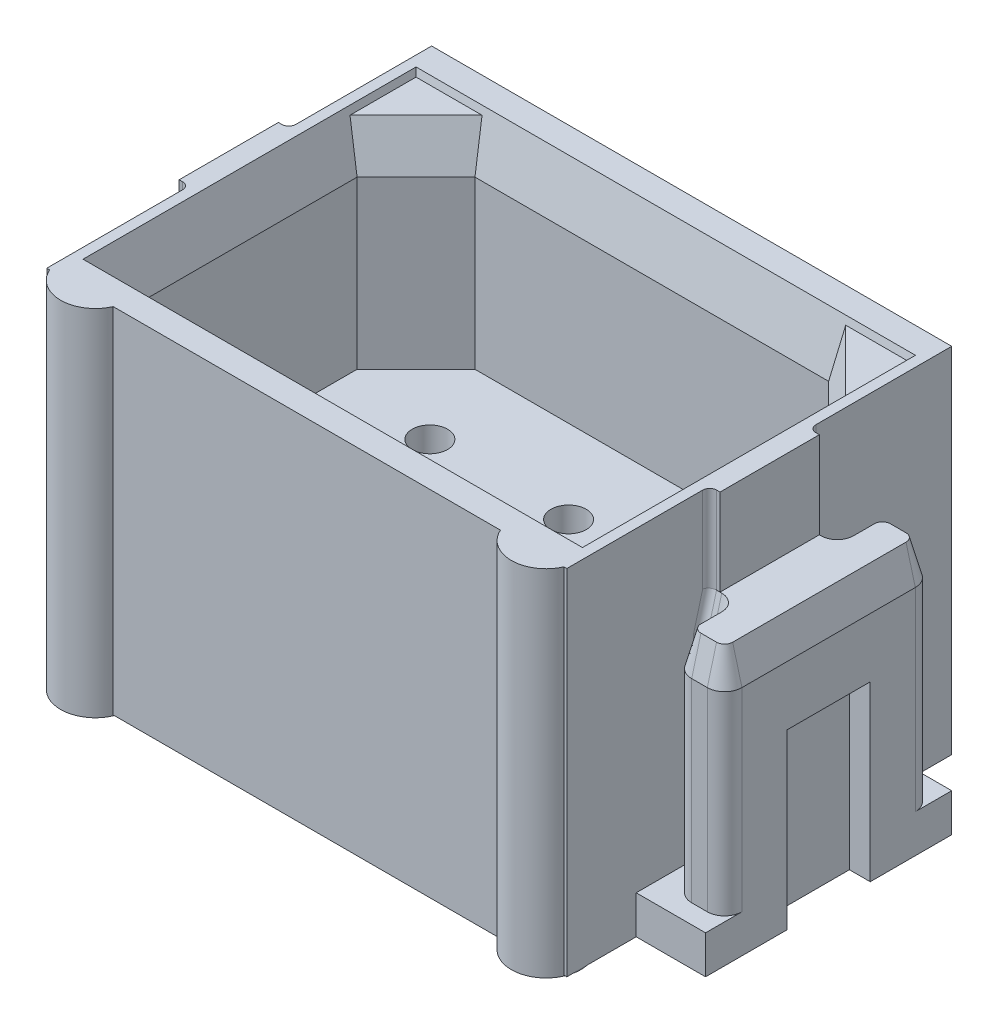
ISO-10303-21;
HEADER;
FILE_DESCRIPTION(('STEP AP214'),'2;1');
FILE_NAME('part.step','',(''),(''),'','','');
FILE_SCHEMA(('AUTOMOTIVE_DESIGN { 1 0 10303 214 1 1 1 1 }'));
ENDSEC;
DATA;
#1=APPLICATION_CONTEXT('core data for automotive mechanical design processes');
#2=APPLICATION_PROTOCOL_DEFINITION('international standard','automotive_design',2000,#1);
#3=PRODUCT_CONTEXT('',#1,'mechanical');
#4=PRODUCT('Part','Part','',(#3));
#5=PRODUCT_RELATED_PRODUCT_CATEGORY('part','',(#4));
#6=PRODUCT_DEFINITION_FORMATION('','',#4);
#7=PRODUCT_DEFINITION_CONTEXT('part definition',#1,'design');
#8=PRODUCT_DEFINITION('design','',#6,#7);
#9=PRODUCT_DEFINITION_SHAPE('','',#8);
#10=(LENGTH_UNIT() NAMED_UNIT(*) SI_UNIT(.MILLI.,.METRE.));
#11=(NAMED_UNIT(*) PLANE_ANGLE_UNIT() SI_UNIT($,.RADIAN.));
#12=(NAMED_UNIT(*) SI_UNIT($,.STERADIAN.) SOLID_ANGLE_UNIT());
#13=UNCERTAINTY_MEASURE_WITH_UNIT(LENGTH_MEASURE(1.E-05),#10,'distance_accuracy_value','');
#14=(GEOMETRIC_REPRESENTATION_CONTEXT(3) GLOBAL_UNCERTAINTY_ASSIGNED_CONTEXT((#13)) GLOBAL_UNIT_ASSIGNED_CONTEXT((#10,
#11,#12)) REPRESENTATION_CONTEXT('',''));
#15=CARTESIAN_POINT('',(0.,0.,0.));
#16=DIRECTION('',(0.,0.,1.));
#17=DIRECTION('',(1.,0.,0.));
#18=AXIS2_PLACEMENT_3D('',#15,#16,#17);
#19=CARTESIAN_POINT('',(-3.885126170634,3.85,1.420666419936));
#20=DIRECTION('',(0.,-1.,0.));
#21=DIRECTION('',(-1.,0.,0.));
#22=AXIS2_PLACEMENT_3D('',#19,#20,#21);
#23=PLANE('',#22);
#24=CARTESIAN_POINT('',(-3.925,3.84999999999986,-0.95));
#25=DIRECTION('',(0.,1.,0.));
#26=DIRECTION('',(0.,0.,1.));
#27=AXIS2_PLACEMENT_3D('',#24,#25,#26);
#28=CIRCLE('',#27,0.233974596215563);
#29=CARTESIAN_POINT('',(-4.15897459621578,3.84999999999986,-0.950000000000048));
#30=VERTEX_POINT('',#29);
#31=CARTESIAN_POINT('',(-3.92500000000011,3.84999999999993,-0.716025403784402));
#32=VERTEX_POINT('',#31);
#33=EDGE_CURVE('E1147',#30,#32,#28,.T.);
#34=ORIENTED_EDGE('',*,*,#33,.F.);
#35=DIRECTION('',(0.,0.,1.));
#36=VECTOR('',#35,1.);
#37=CARTESIAN_POINT('',(-4.158974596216,3.85,0.));
#38=LINE('',#37,#36);
#39=CARTESIAN_POINT('',(-4.15897459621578,3.84999999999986,-1.25000000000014));
#40=VERTEX_POINT('',#39);
#41=EDGE_CURVE('E1150',#40,#30,#38,.T.);
#42=ORIENTED_EDGE('',*,*,#41,.F.);
#43=CARTESIAN_POINT('',(-4.275,3.84999999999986,-1.25));
#44=DIRECTION('',(0.,-1.,0.));
#45=DIRECTION('',(0.,0.,-1.));
#46=AXIS2_PLACEMENT_3D('',#43,#44,#45);
#47=CIRCLE('',#46,0.116025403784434);
#48=CARTESIAN_POINT('',(-4.27499999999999,3.84999999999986,-1.36602540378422));
#49=VERTEX_POINT('',#48);
#50=EDGE_CURVE('E1151',#49,#40,#47,.T.);
#51=ORIENTED_EDGE('',*,*,#50,.F.);
#52=DIRECTION('',(1.,0.,0.));
#53=VECTOR('',#52,1.);
#54=CARTESIAN_POINT('',(-4.258012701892,3.85,-1.366025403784));
#55=LINE('',#54,#53);
#56=CARTESIAN_POINT('',(-4.50000000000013,3.84999999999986,-1.36602540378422));
#57=VERTEX_POINT('',#56);
#58=EDGE_CURVE('E1153',#57,#49,#55,.T.);
#59=ORIENTED_EDGE('',*,*,#58,.F.);
#60=CARTESIAN_POINT('',(-4.5,3.84999999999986,-1.25));
#61=DIRECTION('',(0.,-1.,0.));
#62=DIRECTION('',(0.,0.,-1.));
#63=AXIS2_PLACEMENT_3D('',#60,#61,#62);
#64=CIRCLE('',#63,0.116025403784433);
#65=CARTESIAN_POINT('',(-4.61602540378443,3.84999999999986,-1.25));
#66=VERTEX_POINT('',#65);
#67=EDGE_CURVE('E1154',#66,#57,#64,.T.);
#68=ORIENTED_EDGE('',*,*,#67,.F.);
#69=DIRECTION('',(0.,0.,1.));
#70=VECTOR('',#69,1.);
#71=CARTESIAN_POINT('',(-4.61602540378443,3.84999999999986,0.));
#72=LINE('',#71,#70);
#73=CARTESIAN_POINT('',(-4.61602540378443,3.84999999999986,1.25));
#74=VERTEX_POINT('',#73);
#75=EDGE_CURVE('E738',#66,#74,#72,.T.);
#76=ORIENTED_EDGE('',*,*,#75,.T.);
#77=CARTESIAN_POINT('',(-4.5,3.84999999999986,1.25));
#78=DIRECTION('',(0.,-1.,0.));
#79=DIRECTION('',(0.,0.,-1.));
#80=AXIS2_PLACEMENT_3D('',#77,#78,#79);
#81=CIRCLE('',#80,0.116025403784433);
#82=CARTESIAN_POINT('',(-4.50000000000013,3.84999999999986,1.36602540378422));
#83=VERTEX_POINT('',#82);
#84=EDGE_CURVE('E1156',#83,#74,#81,.T.);
#85=ORIENTED_EDGE('',*,*,#84,.F.);
#86=DIRECTION('',(-1.,0.,0.));
#87=VECTOR('',#86,1.);
#88=CARTESIAN_POINT('',(-4.258012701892,3.85,1.366025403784));
#89=LINE('',#88,#87);
#90=CARTESIAN_POINT('',(-4.27500000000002,3.84999999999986,1.36602540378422));
#91=VERTEX_POINT('',#90);
#92=EDGE_CURVE('E727',#91,#83,#89,.T.);
#93=ORIENTED_EDGE('',*,*,#92,.F.);
#94=CARTESIAN_POINT('',(-4.275,3.84999999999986,1.25));
#95=DIRECTION('',(0.,-1.,0.));
#96=DIRECTION('',(0.,0.,-1.));
#97=AXIS2_PLACEMENT_3D('',#94,#95,#96);
#98=CIRCLE('',#97,0.116025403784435);
#99=CARTESIAN_POINT('',(-4.15897459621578,3.84999999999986,1.25000000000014));
#100=VERTEX_POINT('',#99);
#101=EDGE_CURVE('E725',#100,#91,#98,.T.);
#102=ORIENTED_EDGE('',*,*,#101,.F.);
#103=DIRECTION('',(0.,0.,1.));
#104=VECTOR('',#103,1.);
#105=CARTESIAN_POINT('',(-4.158974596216,3.85,0.));
#106=LINE('',#105,#104);
#107=CARTESIAN_POINT('',(-4.15897459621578,3.84999999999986,0.95));
#108=VERTEX_POINT('',#107);
#109=EDGE_CURVE('E712',#108,#100,#106,.T.);
#110=ORIENTED_EDGE('',*,*,#109,.F.);
#111=CARTESIAN_POINT('',(-3.925,3.84999999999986,0.95));
#112=DIRECTION('',(0.,1.,0.));
#113=DIRECTION('',(0.,0.,1.));
#114=AXIS2_PLACEMENT_3D('',#111,#112,#113);
#115=CIRCLE('',#114,0.233974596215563);
#116=CARTESIAN_POINT('',(-3.92500000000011,3.84999999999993,0.716025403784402));
#117=VERTEX_POINT('',#116);
#118=EDGE_CURVE('E20',#117,#108,#115,.T.);
#119=ORIENTED_EDGE('',*,*,#118,.F.);
#120=DIRECTION('',(-1.,0.,0.));
#121=VECTOR('',#120,1.);
#122=CARTESIAN_POINT('',(-4.258012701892,3.85,0.7160254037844));
#123=LINE('',#122,#121);
#124=CARTESIAN_POINT('',(-3.9,3.85,0.716025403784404));
#125=VERTEX_POINT('',#124);
#126=EDGE_CURVE('E699',#125,#117,#123,.T.);
#127=ORIENTED_EDGE('',*,*,#126,.F.);
#128=DIRECTION('',(0.,0.,1.));
#129=VECTOR('',#128,1.);
#130=CARTESIAN_POINT('',(-3.9,3.85,0.));
#131=LINE('',#130,#129);
#132=CARTESIAN_POINT('',(-3.90000000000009,3.85,-0.7160254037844));
#133=VERTEX_POINT('',#132);
#134=EDGE_CURVE('E732',#133,#125,#131,.T.);
#135=ORIENTED_EDGE('',*,*,#134,.F.);
#136=DIRECTION('',(1.,0.,0.));
#137=VECTOR('',#136,1.);
#138=CARTESIAN_POINT('',(-4.258012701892,3.85,-0.7160254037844));
#139=LINE('',#138,#137);
#140=EDGE_CURVE('E1149',#32,#133,#139,.T.);
#141=ORIENTED_EDGE('',*,*,#140,.F.);
#142=EDGE_LOOP('',(#34,#42,#51,#59,#68,#76,#85,#93,#102,#110,#119,#127,#135,#141));
#143=FACE_BOUND('',#142,.T.);
#144=ADVANCED_FACE('F16',(#143),#23,.F.);
#145=CARTESIAN_POINT('',(-4.45,2.601,-0.624));
#146=DIRECTION('',(-1.,0.,0.));
#147=DIRECTION('',(0.,-1.,0.));
#148=AXIS2_PLACEMENT_3D('',#145,#146,#147);
#149=PLANE('',#148);
#150=DIRECTION('',(0.,0.,1.));
#151=VECTOR('',#150,1.);
#152=CARTESIAN_POINT('',(-4.4500000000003,2.54999999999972,0.));
#153=LINE('',#152,#151);
#154=CARTESIAN_POINT('',(-4.45000000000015,2.54999999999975,-0.6));
#155=VERTEX_POINT('',#154);
#156=CARTESIAN_POINT('',(-4.45000000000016,2.54999999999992,0.6));
#157=VERTEX_POINT('',#156);
#158=EDGE_CURVE('E1210',#155,#157,#153,.T.);
#159=ORIENTED_EDGE('',*,*,#158,.F.);
#160=DIRECTION('',(0.,-1.,0.));
#161=VECTOR('',#160,1.);
#162=CARTESIAN_POINT('',(-4.45,1.275,-0.6));
#163=LINE('',#162,#161);
#164=CARTESIAN_POINT('',(-4.45,0.,-0.6));
#165=VERTEX_POINT('',#164);
#166=EDGE_CURVE('E735',#155,#165,#163,.T.);
#167=ORIENTED_EDGE('',*,*,#166,.T.);
#168=DIRECTION('',(0.,0.,1.));
#169=VECTOR('',#168,1.);
#170=CARTESIAN_POINT('',(-4.45,0.,0.));
#171=LINE('',#170,#169);
#172=CARTESIAN_POINT('',(-4.45,0.,0.6));
#173=VERTEX_POINT('',#172);
#174=EDGE_CURVE('E1219',#165,#173,#171,.T.);
#175=ORIENTED_EDGE('',*,*,#174,.T.);
#176=DIRECTION('',(0.,-1.,0.));
#177=VECTOR('',#176,1.);
#178=CARTESIAN_POINT('',(-4.45,1.275,0.6));
#179=LINE('',#178,#177);
#180=EDGE_CURVE('E1142',#157,#173,#179,.T.);
#181=ORIENTED_EDGE('',*,*,#180,.F.);
#182=EDGE_LOOP('',(#159,#167,#175,#181));
#183=FACE_BOUND('',#182,.T.);
#184=ADVANCED_FACE('F1648',(#183),#149,.T.);
#185=CARTESIAN_POINT('',(-4.764647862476,2.494519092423,-0.624));
#186=DIRECTION('',(0.173648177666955,-0.984807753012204,0.));
#187=DIRECTION('',(0.984807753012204,0.173648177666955,0.));
#188=AXIS2_PLACEMENT_3D('',#185,#186,#187);
#189=PLANE('',#188);
#190=ORIENTED_EDGE('',*,*,#158,.T.);
#191=DIRECTION('',(0.98480775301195,0.173648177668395,0.));
#192=VECTOR('',#191,1.);
#193=CARTESIAN_POINT('',(-4.75,2.497101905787,0.6));
#194=LINE('',#193,#192);
#195=CARTESIAN_POINT('',(-4.75,2.497101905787,0.6));
#196=VERTEX_POINT('',#195);
#197=EDGE_CURVE('E1139',#196,#157,#194,.T.);
#198=ORIENTED_EDGE('',*,*,#197,.F.);
#199=DIRECTION('',(0.,0.,-1.));
#200=VECTOR('',#199,1.);
#201=CARTESIAN_POINT('',(-4.75,2.497101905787,0.));
#202=LINE('',#201,#200);
#203=CARTESIAN_POINT('',(-4.75,2.49710190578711,-0.6));
#204=VERTEX_POINT('',#203);
#205=EDGE_CURVE('E1206',#196,#204,#202,.T.);
#206=ORIENTED_EDGE('',*,*,#205,.T.);
#207=DIRECTION('',(0.984807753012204,0.173648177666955,0.));
#208=VECTOR('',#207,1.);
#209=CARTESIAN_POINT('',(-4.764647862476,2.494519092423,-0.6));
#210=LINE('',#209,#208);
#211=EDGE_CURVE('E739',#204,#155,#210,.T.);
#212=ORIENTED_EDGE('',*,*,#211,.T.);
#213=EDGE_LOOP('',(#190,#198,#206,#212));
#214=FACE_BOUND('',#213,.T.);
#215=ADVANCED_FACE('F1642',(#214),#189,.T.);
#216=CARTESIAN_POINT('',(-4.435126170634,-0.051,-0.6));
#217=DIRECTION('',(0.,0.,-1.));
#218=DIRECTION('',(-1.,0.,0.));
#219=AXIS2_PLACEMENT_3D('',#216,#217,#218);
#220=PLANE('',#219);
#221=ORIENTED_EDGE('',*,*,#211,.F.);
#222=DIRECTION('',(0.,-1.,0.));
#223=VECTOR('',#222,1.);
#224=CARTESIAN_POINT('',(-4.75,1.675,-0.6));
#225=LINE('',#224,#223);
#226=CARTESIAN_POINT('',(-4.75,0.,-0.6));
#227=VERTEX_POINT('',#226);
#228=EDGE_CURVE('E1201',#204,#227,#225,.T.);
#229=ORIENTED_EDGE('',*,*,#228,.T.);
#230=DIRECTION('',(-1.,0.,0.));
#231=VECTOR('',#230,1.);
#232=CARTESIAN_POINT('',(-4.6,0.,-0.6));
#233=LINE('',#232,#231);
#234=EDGE_CURVE('E1146',#165,#227,#233,.T.);
#235=ORIENTED_EDGE('',*,*,#234,.F.);
#236=ORIENTED_EDGE('',*,*,#166,.F.);
#237=EDGE_LOOP('',(#221,#229,#235,#236));
#238=FACE_BOUND('',#237,.T.);
#239=ADVANCED_FACE('F1645',(#238),#220,.F.);
#240=CARTESIAN_POINT('',(-4.612175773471,3.86436701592,-1.3));
#241=DIRECTION('',(0.965925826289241,-0.258819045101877,0.));
#242=DIRECTION('',(0.,0.,1.));
#243=AXIS2_PLACEMENT_3D('',#240,#241,#242);
#244=PLANE('',#243);
#245=DIRECTION('',(0.,0.,1.));
#246=VECTOR('',#245,1.);
#247=CARTESIAN_POINT('',(-4.75,3.35,0.));
#248=LINE('',#247,#246);
#249=CARTESIAN_POINT('',(-4.74999999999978,3.3500000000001,-1.25));
#250=VERTEX_POINT('',#249);
#251=CARTESIAN_POINT('',(-4.74999999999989,3.35000000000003,1.24999999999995));
#252=VERTEX_POINT('',#251);
#253=EDGE_CURVE('E1185',#250,#252,#248,.T.);
#254=ORIENTED_EDGE('',*,*,#253,.T.);
#255=DIRECTION('',(-0.258819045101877,-0.965925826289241,0.));
#256=VECTOR('',#255,1.);
#257=CARTESIAN_POINT('',(-4.683012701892,3.6,1.25));
#258=LINE('',#257,#256);
#259=EDGE_CURVE('E1180',#74,#252,#258,.T.);
#260=ORIENTED_EDGE('',*,*,#259,.F.);
#261=ORIENTED_EDGE('',*,*,#75,.F.);
#262=DIRECTION('',(0.258819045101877,0.965925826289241,0.));
#263=VECTOR('',#262,1.);
#264=CARTESIAN_POINT('',(-4.683012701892,3.6,-1.25));
#265=LINE('',#264,#263);
#266=EDGE_CURVE('E1143',#250,#66,#265,.T.);
#267=ORIENTED_EDGE('',*,*,#266,.F.);
#268=EDGE_LOOP('',(#254,#260,#261,#267));
#269=FACE_BOUND('',#268,.T.);
#270=ADVANCED_FACE('F1183',(#269),#244,.F.);
#271=CARTESIAN_POINT('',(-4.435126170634,-0.051,0.6));
#272=DIRECTION('',(0.,0.,-1.));
#273=DIRECTION('',(-1.,0.,0.));
#274=AXIS2_PLACEMENT_3D('',#271,#272,#273);
#275=PLANE('',#274);
#276=ORIENTED_EDGE('',*,*,#180,.T.);
#277=DIRECTION('',(-1.,0.,0.));
#278=VECTOR('',#277,1.);
#279=CARTESIAN_POINT('',(-4.6,0.,0.6));
#280=LINE('',#279,#278);
#281=CARTESIAN_POINT('',(-4.75,0.,0.6));
#282=VERTEX_POINT('',#281);
#283=EDGE_CURVE('E1214',#173,#282,#280,.T.);
#284=ORIENTED_EDGE('',*,*,#283,.T.);
#285=DIRECTION('',(0.,1.,0.));
#286=VECTOR('',#285,1.);
#287=CARTESIAN_POINT('',(-4.75,1.675,0.6));
#288=LINE('',#287,#286);
#289=EDGE_CURVE('E1613',#282,#196,#288,.T.);
#290=ORIENTED_EDGE('',*,*,#289,.T.);
#291=ORIENTED_EDGE('',*,*,#197,.T.);
#292=EDGE_LOOP('',(#276,#284,#290,#291));
#293=FACE_BOUND('',#292,.T.);
#294=ADVANCED_FACE('F1633',(#293),#275,.T.);
#295=CARTESIAN_POINT('',(-4.75,3.417,-1.846));
#296=DIRECTION('',(1.,0.,0.));
#297=DIRECTION('',(0.,0.,1.));
#298=AXIS2_PLACEMENT_3D('',#295,#296,#297);
#299=PLANE('',#298);
#300=DIRECTION('',(0.,0.,-1.));
#301=VECTOR('',#300,1.);
#302=CARTESIAN_POINT('',(-4.75,0.,0.));
#303=LINE('',#302,#301);
#304=CARTESIAN_POINT('',(-4.75,0.,1.775));
#305=VERTEX_POINT('',#304);
#306=EDGE_CURVE('E1617',#305,#282,#303,.T.);
#307=ORIENTED_EDGE('',*,*,#306,.F.);
#308=DIRECTION('',(0.,-1.,0.));
#309=VECTOR('',#308,1.);
#310=CARTESIAN_POINT('',(-4.75,1.675,1.775));
#311=LINE('',#310,#309);
#312=CARTESIAN_POINT('',(-4.75,0.55,1.775));
#313=VERTEX_POINT('',#312);
#314=EDGE_CURVE('E1607',#313,#305,#311,.T.);
#315=ORIENTED_EDGE('',*,*,#314,.F.);
#316=DIRECTION('',(0.,0.,1.));
#317=VECTOR('',#316,1.);
#318=CARTESIAN_POINT('',(-4.75,0.55,0.));
#319=LINE('',#318,#317);
#320=CARTESIAN_POINT('',(-4.75,0.550000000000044,1.24999999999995));
#321=VERTEX_POINT('',#320);
#322=EDGE_CURVE('E1597',#321,#313,#319,.T.);
#323=ORIENTED_EDGE('',*,*,#322,.F.);
#324=DIRECTION('',(0.,1.,0.));
#325=VECTOR('',#324,1.);
#326=CARTESIAN_POINT('',(-4.75,1.95,1.2499999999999));
#327=LINE('',#326,#325);
#328=EDGE_CURVE('E1108',#321,#252,#327,.T.);
#329=ORIENTED_EDGE('',*,*,#328,.T.);
#330=ORIENTED_EDGE('',*,*,#253,.F.);
#331=DIRECTION('',(0.,-1.,0.));
#332=VECTOR('',#331,1.);
#333=CARTESIAN_POINT('',(-4.75,1.95,-1.25));
#334=LINE('',#333,#332);
#335=CARTESIAN_POINT('',(-4.75,0.550000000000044,-1.25));
#336=VERTEX_POINT('',#335);
#337=EDGE_CURVE('E1104',#250,#336,#334,.T.);
#338=ORIENTED_EDGE('',*,*,#337,.T.);
#339=DIRECTION('',(0.,0.,1.));
#340=VECTOR('',#339,1.);
#341=CARTESIAN_POINT('',(-4.75,0.55,0.));
#342=LINE('',#341,#340);
#343=CARTESIAN_POINT('',(-4.75,0.55,-1.775));
#344=VERTEX_POINT('',#343);
#345=EDGE_CURVE('E1196',#344,#336,#342,.T.);
#346=ORIENTED_EDGE('',*,*,#345,.F.);
#347=DIRECTION('',(0.,1.,0.));
#348=VECTOR('',#347,1.);
#349=CARTESIAN_POINT('',(-4.75,1.675,-1.775));
#350=LINE('',#349,#348);
#351=CARTESIAN_POINT('',(-4.75,0.,-1.775));
#352=VERTEX_POINT('',#351);
#353=EDGE_CURVE('E1194',#352,#344,#350,.T.);
#354=ORIENTED_EDGE('',*,*,#353,.F.);
#355=DIRECTION('',(0.,0.,-1.));
#356=VECTOR('',#355,1.);
#357=CARTESIAN_POINT('',(-4.75,0.,0.));
#358=LINE('',#357,#356);
#359=EDGE_CURVE('E1197',#227,#352,#358,.T.);
#360=ORIENTED_EDGE('',*,*,#359,.F.);
#361=ORIENTED_EDGE('',*,*,#228,.F.);
#362=ORIENTED_EDGE('',*,*,#205,.F.);
#363=ORIENTED_EDGE('',*,*,#289,.F.);
#364=EDGE_LOOP('',(#307,#315,#323,#329,#330,#338,#346,#354,#360,#361,#362,#363));
#365=FACE_BOUND('',#364,.T.);
#366=ADVANCED_FACE('F1638',(#365),#299,.F.);
#367=CARTESIAN_POINT('',(3.885126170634,3.85,1.420666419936));
#368=DIRECTION('',(0.,1.,0.));
#369=DIRECTION('',(1.,0.,0.));
#370=AXIS2_PLACEMENT_3D('',#367,#368,#369);
#371=PLANE('',#370);
#372=CARTESIAN_POINT('',(3.925,3.84999999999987,-0.95));
#373=DIRECTION('',(0.,1.,0.));
#374=DIRECTION('',(0.,0.,1.));
#375=AXIS2_PLACEMENT_3D('',#372,#373,#374);
#376=CIRCLE('',#375,0.233974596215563);
#377=CARTESIAN_POINT('',(4.15897459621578,3.84999999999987,-0.950000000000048));
#378=VERTEX_POINT('',#377);
#379=CARTESIAN_POINT('',(3.92500000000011,3.84999999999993,-0.716025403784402));
#380=VERTEX_POINT('',#379);
#381=EDGE_CURVE('E1110',#378,#380,#376,.F.);
#382=ORIENTED_EDGE('',*,*,#381,.T.);
#383=DIRECTION('',(-1.,0.,0.));
#384=VECTOR('',#383,1.);
#385=CARTESIAN_POINT('',(4.258012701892,3.85,-0.7160254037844));
#386=LINE('',#385,#384);
#387=CARTESIAN_POINT('',(3.90000000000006,3.84999999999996,-0.716025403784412));
#388=VERTEX_POINT('',#387);
#389=EDGE_CURVE('E1114',#380,#388,#386,.T.);
#390=ORIENTED_EDGE('',*,*,#389,.T.);
#391=DIRECTION('',(0.,0.,1.));
#392=VECTOR('',#391,1.);
#393=CARTESIAN_POINT('',(3.9,3.85,0.));
#394=LINE('',#393,#392);
#395=CARTESIAN_POINT('',(3.90000000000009,3.85,0.7160254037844));
#396=VERTEX_POINT('',#395);
#397=EDGE_CURVE('E1588',#388,#396,#394,.T.);
#398=ORIENTED_EDGE('',*,*,#397,.T.);
#399=DIRECTION('',(1.,0.,0.));
#400=VECTOR('',#399,1.);
#401=CARTESIAN_POINT('',(4.258012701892,3.85,0.7160254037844));
#402=LINE('',#401,#400);
#403=CARTESIAN_POINT('',(3.92500000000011,3.84999999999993,0.716025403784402));
#404=VERTEX_POINT('',#403);
#405=EDGE_CURVE('E1138',#396,#404,#402,.T.);
#406=ORIENTED_EDGE('',*,*,#405,.T.);
#407=CARTESIAN_POINT('',(3.925,3.84999999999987,0.95));
#408=DIRECTION('',(0.,1.,0.));
#409=DIRECTION('',(0.,0.,1.));
#410=AXIS2_PLACEMENT_3D('',#407,#408,#409);
#411=CIRCLE('',#410,0.233974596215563);
#412=CARTESIAN_POINT('',(4.15897459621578,3.84999999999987,0.95));
#413=VERTEX_POINT('',#412);
#414=EDGE_CURVE('E1134',#404,#413,#411,.F.);
#415=ORIENTED_EDGE('',*,*,#414,.T.);
#416=DIRECTION('',(0.,0.,1.));
#417=VECTOR('',#416,1.);
#418=CARTESIAN_POINT('',(4.158974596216,3.85,0.));
#419=LINE('',#418,#417);
#420=CARTESIAN_POINT('',(4.15897459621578,3.84999999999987,1.25000000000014));
#421=VERTEX_POINT('',#420);
#422=EDGE_CURVE('E1133',#413,#421,#419,.T.);
#423=ORIENTED_EDGE('',*,*,#422,.T.);
#424=CARTESIAN_POINT('',(4.275,3.84999999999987,1.25));
#425=DIRECTION('',(0.,-1.,0.));
#426=DIRECTION('',(0.,0.,-1.));
#427=AXIS2_PLACEMENT_3D('',#424,#425,#426);
#428=CIRCLE('',#427,0.116025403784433);
#429=CARTESIAN_POINT('',(4.27500000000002,3.84999999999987,1.36602540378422));
#430=VERTEX_POINT('',#429);
#431=EDGE_CURVE('E1129',#421,#430,#428,.F.);
#432=ORIENTED_EDGE('',*,*,#431,.T.);
#433=DIRECTION('',(1.,0.,0.));
#434=VECTOR('',#433,1.);
#435=CARTESIAN_POINT('',(4.258012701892,3.85,1.366025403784));
#436=LINE('',#435,#434);
#437=CARTESIAN_POINT('',(4.50000000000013,3.84999999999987,1.36602540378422));
#438=VERTEX_POINT('',#437);
#439=EDGE_CURVE('E1128',#430,#438,#436,.T.);
#440=ORIENTED_EDGE('',*,*,#439,.T.);
#441=CARTESIAN_POINT('',(4.5,3.84999999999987,1.25));
#442=DIRECTION('',(0.,-1.,0.));
#443=DIRECTION('',(0.,0.,-1.));
#444=AXIS2_PLACEMENT_3D('',#441,#442,#443);
#445=CIRCLE('',#444,0.116025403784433);
#446=CARTESIAN_POINT('',(4.61602540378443,3.84999999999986,1.24999999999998));
#447=VERTEX_POINT('',#446);
#448=EDGE_CURVE('E1125',#438,#447,#445,.F.);
#449=ORIENTED_EDGE('',*,*,#448,.T.);
#450=DIRECTION('',(0.,0.,-1.));
#451=VECTOR('',#450,1.);
#452=CARTESIAN_POINT('',(4.61602540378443,3.84999999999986,0.));
#453=LINE('',#452,#451);
#454=CARTESIAN_POINT('',(4.61602540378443,3.84999999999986,-1.25));
#455=VERTEX_POINT('',#454);
#456=EDGE_CURVE('E1510',#447,#455,#453,.T.);
#457=ORIENTED_EDGE('',*,*,#456,.T.);
#458=CARTESIAN_POINT('',(4.5,3.84999999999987,-1.25));
#459=DIRECTION('',(0.,-1.,0.));
#460=DIRECTION('',(0.,0.,-1.));
#461=AXIS2_PLACEMENT_3D('',#458,#459,#460);
#462=CIRCLE('',#461,0.116025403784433);
#463=CARTESIAN_POINT('',(4.50000000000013,3.84999999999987,-1.36602540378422));
#464=VERTEX_POINT('',#463);
#465=EDGE_CURVE('E1121',#455,#464,#462,.F.);
#466=ORIENTED_EDGE('',*,*,#465,.T.);
#467=DIRECTION('',(-1.,0.,0.));
#468=VECTOR('',#467,1.);
#469=CARTESIAN_POINT('',(4.258012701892,3.85,-1.366025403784));
#470=LINE('',#469,#468);
#471=CARTESIAN_POINT('',(4.27499999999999,3.84999999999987,-1.36602540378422));
#472=VERTEX_POINT('',#471);
#473=EDGE_CURVE('E1120',#464,#472,#470,.T.);
#474=ORIENTED_EDGE('',*,*,#473,.T.);
#475=CARTESIAN_POINT('',(4.275,3.84999999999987,-1.25));
#476=DIRECTION('',(0.,-1.,0.));
#477=DIRECTION('',(0.,0.,-1.));
#478=AXIS2_PLACEMENT_3D('',#475,#476,#477);
#479=CIRCLE('',#478,0.116025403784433);
#480=CARTESIAN_POINT('',(4.15897459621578,3.84999999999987,-1.25000000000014));
#481=VERTEX_POINT('',#480);
#482=EDGE_CURVE('E1116',#472,#481,#479,.F.);
#483=ORIENTED_EDGE('',*,*,#482,.T.);
#484=DIRECTION('',(0.,0.,1.));
#485=VECTOR('',#484,1.);
#486=CARTESIAN_POINT('',(4.158974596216,3.85,0.));
#487=LINE('',#486,#485);
#488=EDGE_CURVE('E1115',#481,#378,#487,.T.);
#489=ORIENTED_EDGE('',*,*,#488,.T.);
#490=EDGE_LOOP('',(#382,#390,#398,#406,#415,#423,#432,#440,#449,#457,#466,#474,#483,#489));
#491=FACE_BOUND('',#490,.T.);
#492=ADVANCED_FACE('F2372',(#491),#371,.T.);
#493=CARTESIAN_POINT('',(4.45,2.601,-0.624));
#494=DIRECTION('',(-1.,0.,0.));
#495=DIRECTION('',(0.,-1.,0.));
#496=AXIS2_PLACEMENT_3D('',#493,#494,#495);
#497=PLANE('',#496);
#498=DIRECTION('',(0.,0.,1.));
#499=VECTOR('',#498,1.);
#500=CARTESIAN_POINT('',(4.4500000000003,2.54999999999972,0.));
#501=LINE('',#500,#499);
#502=CARTESIAN_POINT('',(4.45000000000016,2.54999999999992,-0.6));
#503=VERTEX_POINT('',#502);
#504=CARTESIAN_POINT('',(4.45000000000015,2.54999999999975,0.6));
#505=VERTEX_POINT('',#504);
#506=EDGE_CURVE('E1101',#503,#505,#501,.T.);
#507=ORIENTED_EDGE('',*,*,#506,.T.);
#508=DIRECTION('',(0.,-1.,0.));
#509=VECTOR('',#508,1.);
#510=CARTESIAN_POINT('',(4.45,1.275,0.6));
#511=LINE('',#510,#509);
#512=CARTESIAN_POINT('',(4.45,0.,0.6));
#513=VERTEX_POINT('',#512);
#514=EDGE_CURVE('E1090',#505,#513,#511,.T.);
#515=ORIENTED_EDGE('',*,*,#514,.T.);
#516=DIRECTION('',(0.,0.,1.));
#517=VECTOR('',#516,1.);
#518=CARTESIAN_POINT('',(4.45,0.,0.));
#519=LINE('',#518,#517);
#520=CARTESIAN_POINT('',(4.45,0.,-0.6));
#521=VERTEX_POINT('',#520);
#522=EDGE_CURVE('E1109',#521,#513,#519,.T.);
#523=ORIENTED_EDGE('',*,*,#522,.F.);
#524=DIRECTION('',(0.,-1.,0.));
#525=VECTOR('',#524,1.);
#526=CARTESIAN_POINT('',(4.45,1.275,-0.6));
#527=LINE('',#526,#525);
#528=EDGE_CURVE('E1100',#503,#521,#527,.T.);
#529=ORIENTED_EDGE('',*,*,#528,.F.);
#530=EDGE_LOOP('',(#507,#515,#523,#529));
#531=FACE_BOUND('',#530,.T.);
#532=ADVANCED_FACE('F2368',(#531),#497,.F.);
#533=CARTESIAN_POINT('',(-4.5,3.35,1.25));
#534=DIRECTION('',(0.,-1.,0.));
#535=DIRECTION('',(0.,0.,-1.));
#536=AXIS2_PLACEMENT_3D('',#533,#534,#535);
#537=CYLINDRICAL_SURFACE('',#536,0.249999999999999);
#538=CARTESIAN_POINT('',(-4.5,3.35,1.25));
#539=DIRECTION('',(0.,-1.,0.));
#540=DIRECTION('',(-1.,0.,0.));
#541=AXIS2_PLACEMENT_3D('',#538,#539,#540);
#542=CIRCLE('',#541,0.249999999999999);
#543=CARTESIAN_POINT('',(-4.50000000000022,3.34999999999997,1.49999999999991));
#544=VERTEX_POINT('',#543);
#545=EDGE_CURVE('E1105',#252,#544,#542,.F.);
#546=ORIENTED_EDGE('',*,*,#545,.F.);
#547=ORIENTED_EDGE('',*,*,#328,.F.);
#548=CARTESIAN_POINT('',(-4.5,0.550000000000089,1.25));
#549=DIRECTION('',(0.,-1.,0.));
#550=DIRECTION('',(0.,0.,-1.));
#551=AXIS2_PLACEMENT_3D('',#548,#549,#550);
#552=CIRCLE('',#551,0.249999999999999);
#553=CARTESIAN_POINT('',(-4.50000000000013,0.550000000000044,1.5));
#554=VERTEX_POINT('',#553);
#555=EDGE_CURVE('E1106',#554,#321,#552,.T.);
#556=ORIENTED_EDGE('',*,*,#555,.F.);
#557=DIRECTION('',(0.,1.,0.));
#558=VECTOR('',#557,1.);
#559=CARTESIAN_POINT('',(-4.50000000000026,1.95,1.5));
#560=LINE('',#559,#558);
#561=EDGE_CURVE('E1471',#554,#544,#560,.T.);
#562=ORIENTED_EDGE('',*,*,#561,.T.);
#563=EDGE_LOOP('',(#546,#547,#556,#562));
#564=FACE_BOUND('',#563,.T.);
#565=ADVANCED_FACE('F2371',(#564),#537,.T.);
#566=CARTESIAN_POINT('',(-4.5,3.35,-1.25));
#567=DIRECTION('',(0.,-1.,0.));
#568=DIRECTION('',(0.,0.,-1.));
#569=AXIS2_PLACEMENT_3D('',#566,#567,#568);
#570=CYLINDRICAL_SURFACE('',#569,0.249999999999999);
#571=CARTESIAN_POINT('',(-4.5,3.35000000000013,-1.25));
#572=DIRECTION('',(0.,-1.,0.));
#573=DIRECTION('',(-1.,0.,0.));
#574=AXIS2_PLACEMENT_3D('',#571,#572,#573);
#575=CIRCLE('',#574,0.249999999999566);
#576=CARTESIAN_POINT('',(-4.50000000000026,3.35000000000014,-1.49999999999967));
#577=VERTEX_POINT('',#576);
#578=EDGE_CURVE('E1451',#250,#577,#575,.T.);
#579=ORIENTED_EDGE('',*,*,#578,.T.);
#580=DIRECTION('',(0.,-1.,0.));
#581=VECTOR('',#580,1.);
#582=CARTESIAN_POINT('',(-4.50000000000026,1.95,-1.5));
#583=LINE('',#582,#581);
#584=CARTESIAN_POINT('',(-4.50000000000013,0.550000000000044,-1.5));
#585=VERTEX_POINT('',#584);
#586=EDGE_CURVE('E1450',#577,#585,#583,.T.);
#587=ORIENTED_EDGE('',*,*,#586,.T.);
#588=CARTESIAN_POINT('',(-4.5,0.550000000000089,-1.25));
#589=DIRECTION('',(0.,-1.,0.));
#590=DIRECTION('',(0.,0.,-1.));
#591=AXIS2_PLACEMENT_3D('',#588,#589,#590);
#592=CIRCLE('',#591,0.249999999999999);
#593=EDGE_CURVE('E1102',#336,#585,#592,.T.);
#594=ORIENTED_EDGE('',*,*,#593,.F.);
#595=ORIENTED_EDGE('',*,*,#337,.F.);
#596=EDGE_LOOP('',(#579,#587,#594,#595));
#597=FACE_BOUND('',#596,.T.);
#598=ADVANCED_FACE('F1852',(#597),#570,.T.);
#599=CARTESIAN_POINT('',(4.764647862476,2.494519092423,-0.624));
#600=DIRECTION('',(0.173648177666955,0.984807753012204,0.));
#601=DIRECTION('',(-0.984807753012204,0.173648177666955,0.));
#602=AXIS2_PLACEMENT_3D('',#599,#600,#601);
#603=PLANE('',#602);
#604=ORIENTED_EDGE('',*,*,#506,.F.);
#605=DIRECTION('',(-0.98480775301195,0.173648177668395,0.));
#606=VECTOR('',#605,1.);
#607=CARTESIAN_POINT('',(4.75,2.497101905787,-0.6));
#608=LINE('',#607,#606);
#609=CARTESIAN_POINT('',(4.75,2.497101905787,-0.6));
#610=VERTEX_POINT('',#609);
#611=EDGE_CURVE('E1096',#610,#503,#608,.T.);
#612=ORIENTED_EDGE('',*,*,#611,.F.);
#613=DIRECTION('',(0.,0.,-1.));
#614=VECTOR('',#613,1.);
#615=CARTESIAN_POINT('',(4.75,2.497101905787,0.));
#616=LINE('',#615,#614);
#617=CARTESIAN_POINT('',(4.75,2.49710190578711,0.6));
#618=VERTEX_POINT('',#617);
#619=EDGE_CURVE('E1435',#618,#610,#616,.T.);
#620=ORIENTED_EDGE('',*,*,#619,.F.);
#621=DIRECTION('',(-0.984807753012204,0.173648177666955,0.));
#622=VECTOR('',#621,1.);
#623=CARTESIAN_POINT('',(4.764647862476,2.494519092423,0.6));
#624=LINE('',#623,#622);
#625=EDGE_CURVE('E1086',#618,#505,#624,.T.);
#626=ORIENTED_EDGE('',*,*,#625,.T.);
#627=EDGE_LOOP('',(#604,#612,#620,#626));
#628=FACE_BOUND('',#627,.T.);
#629=ADVANCED_FACE('F2363',(#628),#603,.F.);
#630=CARTESIAN_POINT('',(4.435126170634,-0.051,-0.6));
#631=DIRECTION('',(0.,0.,1.));
#632=DIRECTION('',(1.,0.,0.));
#633=AXIS2_PLACEMENT_3D('',#630,#631,#632);
#634=PLANE('',#633);
#635=ORIENTED_EDGE('',*,*,#528,.T.);
#636=DIRECTION('',(1.,0.,0.));
#637=VECTOR('',#636,1.);
#638=CARTESIAN_POINT('',(4.6,0.,-0.6));
#639=LINE('',#638,#637);
#640=CARTESIAN_POINT('',(4.75,0.,-0.6));
#641=VERTEX_POINT('',#640);
#642=EDGE_CURVE('E1530',#521,#641,#639,.T.);
#643=ORIENTED_EDGE('',*,*,#642,.T.);
#644=DIRECTION('',(0.,-1.,0.));
#645=VECTOR('',#644,1.);
#646=CARTESIAN_POINT('',(4.75,1.675,-0.6));
#647=LINE('',#646,#645);
#648=EDGE_CURVE('E1522',#610,#641,#647,.T.);
#649=ORIENTED_EDGE('',*,*,#648,.F.);
#650=ORIENTED_EDGE('',*,*,#611,.T.);
#651=EDGE_LOOP('',(#635,#643,#649,#650));
#652=FACE_BOUND('',#651,.T.);
#653=ADVANCED_FACE('F2359',(#652),#634,.T.);
#654=CARTESIAN_POINT('',(4.612175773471,3.86436701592,1.3));
#655=DIRECTION('',(-0.965925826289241,-0.258819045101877,0.));
#656=DIRECTION('',(0.,0.,-1.));
#657=AXIS2_PLACEMENT_3D('',#654,#655,#656);
#658=PLANE('',#657);
#659=DIRECTION('',(0.,0.,1.));
#660=VECTOR('',#659,1.);
#661=CARTESIAN_POINT('',(4.75,3.35,0.));
#662=LINE('',#661,#660);
#663=CARTESIAN_POINT('',(4.74999999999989,3.34999999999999,-1.25));
#664=VERTEX_POINT('',#663);
#665=CARTESIAN_POINT('',(4.74999999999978,3.35000000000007,1.24999999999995));
#666=VERTEX_POINT('',#665);
#667=EDGE_CURVE('E1412',#664,#666,#662,.T.);
#668=ORIENTED_EDGE('',*,*,#667,.F.);
#669=DIRECTION('',(0.258819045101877,-0.965925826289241,0.));
#670=VECTOR('',#669,1.);
#671=CARTESIAN_POINT('',(4.683012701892,3.6,-1.25));
#672=LINE('',#671,#670);
#673=EDGE_CURVE('E1095',#455,#664,#672,.T.);
#674=ORIENTED_EDGE('',*,*,#673,.F.);
#675=ORIENTED_EDGE('',*,*,#456,.F.);
#676=DIRECTION('',(0.258819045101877,-0.965925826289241,-1.06561190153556E-13));
#677=VECTOR('',#676,1.);
#678=CARTESIAN_POINT('',(4.683012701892,3.6,1.24999999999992));
#679=LINE('',#678,#677);
#680=EDGE_CURVE('E1445',#447,#666,#679,.T.);
#681=ORIENTED_EDGE('',*,*,#680,.T.);
#682=EDGE_LOOP('',(#668,#674,#675,#681));
#683=FACE_BOUND('',#682,.T.);
#684=ADVANCED_FACE('F2356',(#683),#658,.F.);
#685=CARTESIAN_POINT('',(4.5,0.550000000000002,1.25));
#686=DIRECTION('',(0.,1.,0.));
#687=DIRECTION('',(0.,0.,1.));
#688=AXIS2_PLACEMENT_3D('',#685,#686,#687);
#689=CYLINDRICAL_SURFACE('',#688,0.249999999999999);
#690=CARTESIAN_POINT('',(4.5,3.35000000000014,1.25));
#691=DIRECTION('',(0.,1.,0.));
#692=DIRECTION('',(1.,0.,0.));
#693=AXIS2_PLACEMENT_3D('',#690,#691,#692);
#694=CIRCLE('',#693,0.249999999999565);
#695=CARTESIAN_POINT('',(4.50000000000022,3.35000000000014,1.49999999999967));
#696=VERTEX_POINT('',#695);
#697=EDGE_CURVE('E1431',#666,#696,#694,.F.);
#698=ORIENTED_EDGE('',*,*,#697,.T.);
#699=DIRECTION('',(0.,1.,0.));
#700=VECTOR('',#699,1.);
#701=CARTESIAN_POINT('',(4.50000000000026,1.95,1.5));
#702=LINE('',#701,#700);
#703=CARTESIAN_POINT('',(4.50000000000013,0.550000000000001,1.5));
#704=VERTEX_POINT('',#703);
#705=EDGE_CURVE('E1430',#704,#696,#702,.T.);
#706=ORIENTED_EDGE('',*,*,#705,.F.);
#707=CARTESIAN_POINT('',(4.5,0.550000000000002,1.25));
#708=DIRECTION('',(0.,1.,0.));
#709=DIRECTION('',(0.,0.,1.));
#710=AXIS2_PLACEMENT_3D('',#707,#708,#709);
#711=CIRCLE('',#710,0.249999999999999);
#712=CARTESIAN_POINT('',(4.75,0.550000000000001,1.25));
#713=VERTEX_POINT('',#712);
#714=EDGE_CURVE('E1092',#713,#704,#711,.F.);
#715=ORIENTED_EDGE('',*,*,#714,.F.);
#716=DIRECTION('',(0.,-1.,0.));
#717=VECTOR('',#716,1.);
#718=CARTESIAN_POINT('',(4.75,1.675,1.25));
#719=LINE('',#718,#717);
#720=EDGE_CURVE('E1416',#666,#713,#719,.T.);
#721=ORIENTED_EDGE('',*,*,#720,.F.);
#722=EDGE_LOOP('',(#698,#706,#715,#721));
#723=FACE_BOUND('',#722,.T.);
#724=ADVANCED_FACE('F2354',(#723),#689,.T.);
#725=CARTESIAN_POINT('',(4.435126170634,-0.051,0.6));
#726=DIRECTION('',(0.,0.,1.));
#727=DIRECTION('',(1.,0.,0.));
#728=AXIS2_PLACEMENT_3D('',#725,#726,#727);
#729=PLANE('',#728);
#730=ORIENTED_EDGE('',*,*,#625,.F.);
#731=DIRECTION('',(0.,1.,0.));
#732=VECTOR('',#731,1.);
#733=CARTESIAN_POINT('',(4.75,1.675,0.6));
#734=LINE('',#733,#732);
#735=CARTESIAN_POINT('',(4.75,0.,0.6));
#736=VERTEX_POINT('',#735);
#737=EDGE_CURVE('E1085',#736,#618,#734,.T.);
#738=ORIENTED_EDGE('',*,*,#737,.F.);
#739=DIRECTION('',(1.,0.,0.));
#740=VECTOR('',#739,1.);
#741=CARTESIAN_POINT('',(4.6,0.,0.6));
#742=LINE('',#741,#740);
#743=EDGE_CURVE('E1091',#513,#736,#742,.T.);
#744=ORIENTED_EDGE('',*,*,#743,.F.);
#745=ORIENTED_EDGE('',*,*,#514,.F.);
#746=EDGE_LOOP('',(#730,#738,#744,#745));
#747=FACE_BOUND('',#746,.T.);
#748=ADVANCED_FACE('F2350',(#747),#729,.F.);
#749=CARTESIAN_POINT('',(-4.260126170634,0.494,1.5));
#750=DIRECTION('',(0.,0.,-1.));
#751=DIRECTION('',(-1.,0.,0.));
#752=AXIS2_PLACEMENT_3D('',#749,#750,#751);
#753=PLANE('',#752);
#754=DIRECTION('',(1.,0.,0.));
#755=VECTOR('',#754,1.);
#756=CARTESIAN_POINT('',(-4.3875,3.35,1.5));
#757=LINE('',#756,#755);
#758=CARTESIAN_POINT('',(-4.27499999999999,3.34999999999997,1.49999999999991));
#759=VERTEX_POINT('',#758);
#760=EDGE_CURVE('E1460',#544,#759,#757,.T.);
#761=ORIENTED_EDGE('',*,*,#760,.F.);
#762=ORIENTED_EDGE('',*,*,#561,.F.);
#763=DIRECTION('',(-1.,0.,0.));
#764=VECTOR('',#763,1.);
#765=CARTESIAN_POINT('',(-4.3875,0.55,1.5));
#766=LINE('',#765,#764);
#767=CARTESIAN_POINT('',(-4.27500000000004,0.550000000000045,1.5));
#768=VERTEX_POINT('',#767);
#769=EDGE_CURVE('E1474',#768,#554,#766,.T.);
#770=ORIENTED_EDGE('',*,*,#769,.F.);
#771=DIRECTION('',(0.,1.,0.));
#772=VECTOR('',#771,1.);
#773=CARTESIAN_POINT('',(-4.27500000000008,1.95,1.5));
#774=LINE('',#773,#772);
#775=EDGE_CURVE('E1084',#768,#759,#774,.T.);
#776=ORIENTED_EDGE('',*,*,#775,.T.);
#777=EDGE_LOOP('',(#761,#762,#770,#776));
#778=FACE_BOUND('',#777,.T.);
#779=ADVANCED_FACE('F2347',(#778),#753,.F.);
#780=CARTESIAN_POINT('',(-4.5,3.84999999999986,1.25));
#781=DIRECTION('',(0.,-1.,0.));
#782=DIRECTION('',(0.,0.,-1.));
#783=AXIS2_PLACEMENT_3D('',#780,#781,#782);
#784=CONICAL_SURFACE('',#783,0.116025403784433,0.261799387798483);
#785=ORIENTED_EDGE('',*,*,#545,.T.);
#786=DIRECTION('',(0.,-0.965925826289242,0.258819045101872));
#787=VECTOR('',#786,1.);
#788=CARTESIAN_POINT('',(-4.50000000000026,3.6,1.433012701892));
#789=LINE('',#788,#787);
#790=EDGE_CURVE('E1165',#83,#544,#789,.T.);
#791=ORIENTED_EDGE('',*,*,#790,.F.);
#792=ORIENTED_EDGE('',*,*,#84,.T.);
#793=ORIENTED_EDGE('',*,*,#259,.T.);
#794=EDGE_LOOP('',(#785,#791,#792,#793));
#795=FACE_BOUND('',#794,.T.);
#796=ADVANCED_FACE('F1169',(#795),#784,.T.);
#797=CARTESIAN_POINT('',(-4.5,3.84999999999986,-1.25));
#798=DIRECTION('',(0.,-1.,0.));
#799=DIRECTION('',(0.,0.,-1.));
#800=AXIS2_PLACEMENT_3D('',#797,#798,#799);
#801=CONICAL_SURFACE('',#800,0.116025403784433,0.261799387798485);
#802=ORIENTED_EDGE('',*,*,#578,.F.);
#803=ORIENTED_EDGE('',*,*,#266,.T.);
#804=ORIENTED_EDGE('',*,*,#67,.T.);
#805=DIRECTION('',(0.,0.965925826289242,0.258819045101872));
#806=VECTOR('',#805,1.);
#807=CARTESIAN_POINT('',(-4.50000000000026,3.6,-1.433012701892));
#808=LINE('',#807,#806);
#809=EDGE_CURVE('E1081',#577,#57,#808,.T.);
#810=ORIENTED_EDGE('',*,*,#809,.F.);
#811=EDGE_LOOP('',(#802,#803,#804,#810));
#812=FACE_BOUND('',#811,.T.);
#813=ADVANCED_FACE('F1849',(#812),#801,.T.);
#814=CARTESIAN_POINT('',(-4.514873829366,0.494,-1.5));
#815=DIRECTION('',(0.,0.,1.));
#816=DIRECTION('',(1.,0.,0.));
#817=AXIS2_PLACEMENT_3D('',#814,#815,#816);
#818=PLANE('',#817);
#819=DIRECTION('',(-1.,0.,0.));
#820=VECTOR('',#819,1.);
#821=CARTESIAN_POINT('',(-4.3875,3.35000000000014,-1.49999999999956));
#822=LINE('',#821,#820);
#823=CARTESIAN_POINT('',(-4.27499999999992,3.35000000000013,-1.49999999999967));
#824=VERTEX_POINT('',#823);
#825=EDGE_CURVE('E1172',#824,#577,#822,.T.);
#826=ORIENTED_EDGE('',*,*,#825,.F.);
#827=DIRECTION('',(0.,-1.,0.));
#828=VECTOR('',#827,1.);
#829=CARTESIAN_POINT('',(-4.27499999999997,1.95,-1.5));
#830=LINE('',#829,#828);
#831=CARTESIAN_POINT('',(-4.27499999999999,0.550000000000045,-1.5));
#832=VERTEX_POINT('',#831);
#833=EDGE_CURVE('E1080',#824,#832,#830,.T.);
#834=ORIENTED_EDGE('',*,*,#833,.T.);
#835=DIRECTION('',(1.,0.,0.));
#836=VECTOR('',#835,1.);
#837=CARTESIAN_POINT('',(-4.3875,0.55,-1.5));
#838=LINE('',#837,#836);
#839=EDGE_CURVE('E1448',#585,#832,#838,.T.);
#840=ORIENTED_EDGE('',*,*,#839,.F.);
#841=ORIENTED_EDGE('',*,*,#586,.F.);
#842=EDGE_LOOP('',(#826,#834,#840,#841));
#843=FACE_BOUND('',#842,.T.);
#844=ADVANCED_FACE('F1843',(#843),#818,.F.);
#845=CARTESIAN_POINT('',(4.5,3.35000000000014,1.25));
#846=DIRECTION('',(0.,-1.,0.));
#847=DIRECTION('',(0.,0.,-1.));
#848=AXIS2_PLACEMENT_3D('',#845,#846,#847);
#849=CONICAL_SURFACE('',#848,0.249999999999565,0.261799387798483);
#850=ORIENTED_EDGE('',*,*,#697,.F.);
#851=ORIENTED_EDGE('',*,*,#680,.F.);
#852=ORIENTED_EDGE('',*,*,#448,.F.);
#853=DIRECTION('',(0.,-0.965925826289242,0.258819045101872));
#854=VECTOR('',#853,1.);
#855=CARTESIAN_POINT('',(4.50000000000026,3.6,1.433012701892));
#856=LINE('',#855,#854);
#857=EDGE_CURVE('E1385',#438,#696,#856,.T.);
#858=ORIENTED_EDGE('',*,*,#857,.T.);
#859=EDGE_LOOP('',(#850,#851,#852,#858));
#860=FACE_BOUND('',#859,.T.);
#861=ADVANCED_FACE('F2343',(#860),#849,.T.);
#862=CARTESIAN_POINT('',(4.260126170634,0.494,1.5));
#863=DIRECTION('',(0.,0.,1.));
#864=DIRECTION('',(1.,0.,0.));
#865=AXIS2_PLACEMENT_3D('',#862,#863,#864);
#866=PLANE('',#865);
#867=DIRECTION('',(-1.,0.,0.));
#868=VECTOR('',#867,1.);
#869=CARTESIAN_POINT('',(4.3875,3.35000000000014,1.49999999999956));
#870=LINE('',#869,#868);
#871=CARTESIAN_POINT('',(4.27499999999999,3.35000000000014,1.49999999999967));
#872=VERTEX_POINT('',#871);
#873=EDGE_CURVE('E1077',#696,#872,#870,.T.);
#874=ORIENTED_EDGE('',*,*,#873,.T.);
#875=DIRECTION('',(0.,-1.,0.));
#876=VECTOR('',#875,1.);
#877=CARTESIAN_POINT('',(4.27500000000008,1.95,1.5));
#878=LINE('',#877,#876);
#879=CARTESIAN_POINT('',(4.27500000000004,0.550000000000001,1.5));
#880=VERTEX_POINT('',#879);
#881=EDGE_CURVE('E1073',#872,#880,#878,.T.);
#882=ORIENTED_EDGE('',*,*,#881,.T.);
#883=DIRECTION('',(1.,0.,0.));
#884=VECTOR('',#883,1.);
#885=CARTESIAN_POINT('',(4.3875,0.55,1.5));
#886=LINE('',#885,#884);
#887=EDGE_CURVE('E1426',#880,#704,#886,.T.);
#888=ORIENTED_EDGE('',*,*,#887,.T.);
#889=ORIENTED_EDGE('',*,*,#705,.T.);
#890=EDGE_LOOP('',(#874,#882,#888,#889));
#891=FACE_BOUND('',#890,.T.);
#892=ADVANCED_FACE('F2339',(#891),#866,.T.);
#893=CARTESIAN_POINT('',(4.75,3.417,-1.846));
#894=DIRECTION('',(1.,0.,0.));
#895=DIRECTION('',(0.,0.,1.));
#896=AXIS2_PLACEMENT_3D('',#893,#894,#895);
#897=PLANE('',#896);
#898=DIRECTION('',(0.,0.,-1.));
#899=VECTOR('',#898,1.);
#900=CARTESIAN_POINT('',(4.75,0.,0.));
#901=LINE('',#900,#899);
#902=CARTESIAN_POINT('',(4.75,0.,1.775));
#903=VERTEX_POINT('',#902);
#904=EDGE_CURVE('E1480',#903,#736,#901,.T.);
#905=ORIENTED_EDGE('',*,*,#904,.T.);
#906=ORIENTED_EDGE('',*,*,#737,.T.);
#907=ORIENTED_EDGE('',*,*,#619,.T.);
#908=ORIENTED_EDGE('',*,*,#648,.T.);
#909=DIRECTION('',(0.,0.,-1.));
#910=VECTOR('',#909,1.);
#911=CARTESIAN_POINT('',(4.75,0.,0.));
#912=LINE('',#911,#910);
#913=CARTESIAN_POINT('',(4.75,0.,-1.775));
#914=VERTEX_POINT('',#913);
#915=EDGE_CURVE('E1516',#641,#914,#912,.T.);
#916=ORIENTED_EDGE('',*,*,#915,.T.);
#917=DIRECTION('',(0.,1.,0.));
#918=VECTOR('',#917,1.);
#919=CARTESIAN_POINT('',(4.75,1.675,-1.775));
#920=LINE('',#919,#918);
#921=CARTESIAN_POINT('',(4.75,0.55,-1.775));
#922=VERTEX_POINT('',#921);
#923=EDGE_CURVE('E1423',#914,#922,#920,.T.);
#924=ORIENTED_EDGE('',*,*,#923,.T.);
#925=DIRECTION('',(0.,0.,1.));
#926=VECTOR('',#925,1.);
#927=CARTESIAN_POINT('',(4.75,0.55,0.));
#928=LINE('',#927,#926);
#929=CARTESIAN_POINT('',(4.75,0.550000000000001,-1.25));
#930=VERTEX_POINT('',#929);
#931=EDGE_CURVE('E1417',#922,#930,#928,.T.);
#932=ORIENTED_EDGE('',*,*,#931,.T.);
#933=DIRECTION('',(0.,1.,0.));
#934=VECTOR('',#933,1.);
#935=CARTESIAN_POINT('',(4.75,1.95,-1.25));
#936=LINE('',#935,#934);
#937=EDGE_CURVE('E1072',#930,#664,#936,.T.);
#938=ORIENTED_EDGE('',*,*,#937,.T.);
#939=ORIENTED_EDGE('',*,*,#667,.T.);
#940=ORIENTED_EDGE('',*,*,#720,.T.);
#941=DIRECTION('',(0.,0.,1.));
#942=VECTOR('',#941,1.);
#943=CARTESIAN_POINT('',(4.75,0.55,0.));
#944=LINE('',#943,#942);
#945=CARTESIAN_POINT('',(4.75,0.55,1.775));
#946=VERTEX_POINT('',#945);
#947=EDGE_CURVE('E1481',#713,#946,#944,.T.);
#948=ORIENTED_EDGE('',*,*,#947,.T.);
#949=DIRECTION('',(0.,-1.,0.));
#950=VECTOR('',#949,1.);
#951=CARTESIAN_POINT('',(4.75,1.675,1.775));
#952=LINE('',#951,#950);
#953=EDGE_CURVE('E1476',#946,#903,#952,.T.);
#954=ORIENTED_EDGE('',*,*,#953,.T.);
#955=EDGE_LOOP('',(#905,#906,#907,#908,#916,#924,#932,#938,#939,#940,#948,#954));
#956=FACE_BOUND('',#955,.T.);
#957=ADVANCED_FACE('F2336',(#956),#897,.T.);
#958=CARTESIAN_POINT('',(-4.275,3.35,1.25));
#959=DIRECTION('',(0.,-1.,0.));
#960=DIRECTION('',(0.,0.,-1.));
#961=AXIS2_PLACEMENT_3D('',#958,#959,#960);
#962=CYLINDRICAL_SURFACE('',#961,0.249999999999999);
#963=CARTESIAN_POINT('',(-4.275,3.35,1.25));
#964=DIRECTION('',(0.,-1.,0.));
#965=DIRECTION('',(-1.,0.,0.));
#966=AXIS2_PLACEMENT_3D('',#963,#964,#965);
#967=CIRCLE('',#966,0.249999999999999);
#968=CARTESIAN_POINT('',(-4.02500000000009,3.34999999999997,1.25000000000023));
#969=VERTEX_POINT('',#968);
#970=EDGE_CURVE('E1173',#759,#969,#967,.F.);
#971=ORIENTED_EDGE('',*,*,#970,.F.);
#972=ORIENTED_EDGE('',*,*,#775,.F.);
#973=CARTESIAN_POINT('',(-4.275,0.550000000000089,1.25));
#974=DIRECTION('',(0.,-1.,0.));
#975=DIRECTION('',(0.,0.,-1.));
#976=AXIS2_PLACEMENT_3D('',#973,#974,#975);
#977=CIRCLE('',#976,0.249999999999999);
#978=CARTESIAN_POINT('',(-4.025,0.550000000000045,1.25000000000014));
#979=VERTEX_POINT('',#978);
#980=EDGE_CURVE('E1082',#979,#768,#977,.T.);
#981=ORIENTED_EDGE('',*,*,#980,.F.);
#982=DIRECTION('',(0.,1.,0.));
#983=VECTOR('',#982,1.);
#984=CARTESIAN_POINT('',(-4.025,1.95,1.25000000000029));
#985=LINE('',#984,#983);
#986=EDGE_CURVE('E1353',#979,#969,#985,.T.);
#987=ORIENTED_EDGE('',*,*,#986,.T.);
#988=EDGE_LOOP('',(#971,#972,#981,#987));
#989=FACE_BOUND('',#988,.T.);
#990=ADVANCED_FACE('F2335',(#989),#962,.T.);
#991=CARTESIAN_POINT('',(-4.260126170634,3.86436701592,1.362175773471));
#992=DIRECTION('',(0.,0.258819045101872,0.965925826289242));
#993=DIRECTION('',(-1.,0.,0.));
#994=AXIS2_PLACEMENT_3D('',#991,#992,#993);
#995=PLANE('',#994);
#996=ORIENTED_EDGE('',*,*,#760,.T.);
#997=DIRECTION('',(0.,0.965925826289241,-0.258819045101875));
#998=VECTOR('',#997,1.);
#999=CARTESIAN_POINT('',(-4.27500000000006,3.6,1.433012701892));
#1000=LINE('',#999,#998);
#1001=EDGE_CURVE('E1168',#759,#91,#1000,.T.);
#1002=ORIENTED_EDGE('',*,*,#1001,.T.);
#1003=ORIENTED_EDGE('',*,*,#92,.T.);
#1004=ORIENTED_EDGE('',*,*,#790,.T.);
#1005=EDGE_LOOP('',(#996,#1002,#1003,#1004));
#1006=FACE_BOUND('',#1005,.T.);
#1007=ADVANCED_FACE('F1164',(#1006),#995,.T.);
#1008=CARTESIAN_POINT('',(-4.514873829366,3.86436701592,-1.362175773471));
#1009=DIRECTION('',(0.,0.258819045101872,-0.965925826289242));
#1010=DIRECTION('',(1.,0.,0.));
#1011=AXIS2_PLACEMENT_3D('',#1008,#1009,#1010);
#1012=PLANE('',#1011);
#1013=ORIENTED_EDGE('',*,*,#825,.T.);
#1014=ORIENTED_EDGE('',*,*,#809,.T.);
#1015=ORIENTED_EDGE('',*,*,#58,.T.);
#1016=DIRECTION('',(0.,-0.965925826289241,-0.258819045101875));
#1017=VECTOR('',#1016,1.);
#1018=CARTESIAN_POINT('',(-4.27499999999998,3.6,-1.433012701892));
#1019=LINE('',#1018,#1017);
#1020=EDGE_CURVE('E1233',#49,#824,#1019,.T.);
#1021=ORIENTED_EDGE('',*,*,#1020,.T.);
#1022=EDGE_LOOP('',(#1013,#1014,#1015,#1021));
#1023=FACE_BOUND('',#1022,.T.);
#1024=ADVANCED_FACE('F1232',(#1023),#1012,.T.);
#1025=CARTESIAN_POINT('',(-4.275,3.35,-1.25));
#1026=DIRECTION('',(0.,-1.,0.));
#1027=DIRECTION('',(0.,0.,-1.));
#1028=AXIS2_PLACEMENT_3D('',#1025,#1026,#1027);
#1029=CYLINDRICAL_SURFACE('',#1028,0.249999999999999);
#1030=CARTESIAN_POINT('',(-4.275,3.35000000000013,-1.25));
#1031=DIRECTION('',(0.,-1.,0.));
#1032=DIRECTION('',(-1.,0.,0.));
#1033=AXIS2_PLACEMENT_3D('',#1030,#1031,#1032);
#1034=CIRCLE('',#1033,0.249999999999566);
#1035=CARTESIAN_POINT('',(-4.02500000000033,3.35000000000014,-1.25000000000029));
#1036=VERTEX_POINT('',#1035);
#1037=EDGE_CURVE('E1242',#824,#1036,#1034,.T.);
#1038=ORIENTED_EDGE('',*,*,#1037,.T.);
#1039=DIRECTION('',(0.,-1.,0.));
#1040=VECTOR('',#1039,1.);
#1041=CARTESIAN_POINT('',(-4.025,1.95,-1.25000000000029));
#1042=LINE('',#1041,#1040);
#1043=CARTESIAN_POINT('',(-4.025,0.550000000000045,-1.25000000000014));
#1044=VERTEX_POINT('',#1043);
#1045=EDGE_CURVE('E1335',#1036,#1044,#1042,.T.);
#1046=ORIENTED_EDGE('',*,*,#1045,.T.);
#1047=CARTESIAN_POINT('',(-4.275,0.55000000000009,-1.25));
#1048=DIRECTION('',(0.,-1.,0.));
#1049=DIRECTION('',(0.,0.,-1.));
#1050=AXIS2_PLACEMENT_3D('',#1047,#1048,#1049);
#1051=CIRCLE('',#1050,0.249999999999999);
#1052=EDGE_CURVE('E1078',#832,#1044,#1051,.T.);
#1053=ORIENTED_EDGE('',*,*,#1052,.F.);
#1054=ORIENTED_EDGE('',*,*,#833,.F.);
#1055=EDGE_LOOP('',(#1038,#1046,#1053,#1054));
#1056=FACE_BOUND('',#1055,.T.);
#1057=ADVANCED_FACE('F1840',(#1056),#1029,.T.);
#1058=CARTESIAN_POINT('',(4.260126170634,3.86436701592,1.362175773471));
#1059=DIRECTION('',(0.,-0.258819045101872,-0.965925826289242));
#1060=DIRECTION('',(1.,0.,0.));
#1061=AXIS2_PLACEMENT_3D('',#1058,#1059,#1060);
#1062=PLANE('',#1061);
#1063=ORIENTED_EDGE('',*,*,#873,.F.);
#1064=ORIENTED_EDGE('',*,*,#857,.F.);
#1065=ORIENTED_EDGE('',*,*,#439,.F.);
#1066=DIRECTION('',(0.,-0.965925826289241,0.258819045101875));
#1067=VECTOR('',#1066,1.);
#1068=CARTESIAN_POINT('',(4.27500000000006,3.6,1.433012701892));
#1069=LINE('',#1068,#1067);
#1070=EDGE_CURVE('E1330',#430,#872,#1069,.T.);
#1071=ORIENTED_EDGE('',*,*,#1070,.T.);
#1072=EDGE_LOOP('',(#1063,#1064,#1065,#1071));
#1073=FACE_BOUND('',#1072,.T.);
#1074=ADVANCED_FACE('F2326',(#1073),#1062,.F.);
#1075=CARTESIAN_POINT('',(4.275,0.550000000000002,1.25));
#1076=DIRECTION('',(0.,1.,0.));
#1077=DIRECTION('',(0.,0.,1.));
#1078=AXIS2_PLACEMENT_3D('',#1075,#1076,#1077);
#1079=CYLINDRICAL_SURFACE('',#1078,0.249999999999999);
#1080=CARTESIAN_POINT('',(4.275,3.35000000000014,1.25));
#1081=DIRECTION('',(0.,1.,0.));
#1082=DIRECTION('',(1.,0.,0.));
#1083=AXIS2_PLACEMENT_3D('',#1080,#1081,#1082);
#1084=CIRCLE('',#1083,0.249999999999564);
#1085=CARTESIAN_POINT('',(4.02500000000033,3.35000000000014,1.25000000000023));
#1086=VERTEX_POINT('',#1085);
#1087=EDGE_CURVE('E1316',#872,#1086,#1084,.F.);
#1088=ORIENTED_EDGE('',*,*,#1087,.T.);
#1089=DIRECTION('',(0.,1.,0.));
#1090=VECTOR('',#1089,1.);
#1091=CARTESIAN_POINT('',(4.025,1.95,1.25000000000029));
#1092=LINE('',#1091,#1090);
#1093=CARTESIAN_POINT('',(4.025,0.550000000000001,1.25000000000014));
#1094=VERTEX_POINT('',#1093);
#1095=EDGE_CURVE('E1315',#1094,#1086,#1092,.T.);
#1096=ORIENTED_EDGE('',*,*,#1095,.F.);
#1097=CARTESIAN_POINT('',(4.275,0.550000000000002,1.25));
#1098=DIRECTION('',(0.,1.,0.));
#1099=DIRECTION('',(0.,0.,1.));
#1100=AXIS2_PLACEMENT_3D('',#1097,#1098,#1099);
#1101=CIRCLE('',#1100,0.249999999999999);
#1102=EDGE_CURVE('E1074',#880,#1094,#1101,.F.);
#1103=ORIENTED_EDGE('',*,*,#1102,.F.);
#1104=ORIENTED_EDGE('',*,*,#881,.F.);
#1105=EDGE_LOOP('',(#1088,#1096,#1103,#1104));
#1106=FACE_BOUND('',#1105,.T.);
#1107=ADVANCED_FACE('F2329',(#1106),#1079,.T.);
#1108=CARTESIAN_POINT('',(4.5,3.35000000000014,-1.25));
#1109=DIRECTION('',(0.,-1.,0.));
#1110=DIRECTION('',(0.,0.,-1.));
#1111=AXIS2_PLACEMENT_3D('',#1108,#1109,#1110);
#1112=CONICAL_SURFACE('',#1111,0.249999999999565,0.261799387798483);
#1113=CARTESIAN_POINT('',(4.5,3.34999999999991,-1.25));
#1114=DIRECTION('',(0.,1.,0.));
#1115=DIRECTION('',(1.,0.,0.));
#1116=AXIS2_PLACEMENT_3D('',#1113,#1114,#1115);
#1117=CIRCLE('',#1116,0.249999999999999);
#1118=CARTESIAN_POINT('',(4.50000000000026,3.34999999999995,-1.49999999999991));
#1119=VERTEX_POINT('',#1118);
#1120=EDGE_CURVE('E1358',#664,#1119,#1117,.T.);
#1121=ORIENTED_EDGE('',*,*,#1120,.T.);
#1122=DIRECTION('',(0.,0.965925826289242,0.258819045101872));
#1123=VECTOR('',#1122,1.);
#1124=CARTESIAN_POINT('',(4.50000000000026,3.6,-1.433012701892));
#1125=LINE('',#1124,#1123);
#1126=EDGE_CURVE('E1310',#1119,#464,#1125,.T.);
#1127=ORIENTED_EDGE('',*,*,#1126,.T.);
#1128=ORIENTED_EDGE('',*,*,#465,.F.);
#1129=ORIENTED_EDGE('',*,*,#673,.T.);
#1130=EDGE_LOOP('',(#1121,#1127,#1128,#1129));
#1131=FACE_BOUND('',#1130,.T.);
#1132=ADVANCED_FACE('F2413',(#1131),#1112,.T.);
#1133=CARTESIAN_POINT('',(4.5,0.550000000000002,-1.25));
#1134=DIRECTION('',(0.,1.,0.));
#1135=DIRECTION('',(0.,0.,1.));
#1136=AXIS2_PLACEMENT_3D('',#1133,#1134,#1135);
#1137=CYLINDRICAL_SURFACE('',#1136,0.249999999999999);
#1138=ORIENTED_EDGE('',*,*,#1120,.F.);
#1139=ORIENTED_EDGE('',*,*,#937,.F.);
#1140=CARTESIAN_POINT('',(4.5,0.550000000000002,-1.25));
#1141=DIRECTION('',(0.,1.,0.));
#1142=DIRECTION('',(0.,0.,1.));
#1143=AXIS2_PLACEMENT_3D('',#1140,#1141,#1142);
#1144=CIRCLE('',#1143,0.249999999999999);
#1145=CARTESIAN_POINT('',(4.50000000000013,0.550000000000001,-1.5));
#1146=VERTEX_POINT('',#1145);
#1147=EDGE_CURVE('E1069',#1146,#930,#1144,.F.);
#1148=ORIENTED_EDGE('',*,*,#1147,.F.);
#1149=DIRECTION('',(0.,-1.,0.));
#1150=VECTOR('',#1149,1.);
#1151=CARTESIAN_POINT('',(4.50000000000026,1.95,-1.5));
#1152=LINE('',#1151,#1150);
#1153=EDGE_CURVE('E1068',#1119,#1146,#1152,.T.);
#1154=ORIENTED_EDGE('',*,*,#1153,.F.);
#1155=EDGE_LOOP('',(#1138,#1139,#1148,#1154));
#1156=FACE_BOUND('',#1155,.T.);
#1157=ADVANCED_FACE('F2324',(#1156),#1137,.T.);
#1158=CARTESIAN_POINT('',(-4.025,0.494,0.9351261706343));
#1159=DIRECTION('',(-1.,0.,0.));
#1160=DIRECTION('',(0.,0.,1.));
#1161=AXIS2_PLACEMENT_3D('',#1158,#1159,#1160);
#1162=PLANE('',#1161);
#1163=DIRECTION('',(0.,0.,-1.));
#1164=VECTOR('',#1163,1.);
#1165=CARTESIAN_POINT('',(-4.025,3.35,1.10000000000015));
#1166=LINE('',#1165,#1164);
#1167=CARTESIAN_POINT('',(-4.02500000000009,3.34999999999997,0.95));
#1168=VERTEX_POINT('',#1167);
#1169=EDGE_CURVE('E718',#969,#1168,#1166,.T.);
#1170=ORIENTED_EDGE('',*,*,#1169,.F.);
#1171=ORIENTED_EDGE('',*,*,#986,.F.);
#1172=DIRECTION('',(0.,0.,1.));
#1173=VECTOR('',#1172,1.);
#1174=CARTESIAN_POINT('',(-4.025,0.55,1.10000000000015));
#1175=LINE('',#1174,#1173);
#1176=CARTESIAN_POINT('',(-4.025,0.550000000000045,0.950000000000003));
#1177=VERTEX_POINT('',#1176);
#1178=EDGE_CURVE('E1356',#1177,#979,#1175,.T.);
#1179=ORIENTED_EDGE('',*,*,#1178,.F.);
#1180=DIRECTION('',(0.,-1.,0.));
#1181=VECTOR('',#1180,1.);
#1182=CARTESIAN_POINT('',(-4.025,1.95,0.95));
#1183=LINE('',#1182,#1181);
#1184=EDGE_CURVE('E1286',#1168,#1177,#1183,.T.);
#1185=ORIENTED_EDGE('',*,*,#1184,.F.);
#1186=EDGE_LOOP('',(#1170,#1171,#1179,#1185));
#1187=FACE_BOUND('',#1186,.T.);
#1188=ADVANCED_FACE('F2320',(#1187),#1162,.F.);
#1189=CARTESIAN_POINT('',(-4.275,3.84999999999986,1.25));
#1190=DIRECTION('',(0.,-1.,0.));
#1191=DIRECTION('',(0.,0.,-1.));
#1192=AXIS2_PLACEMENT_3D('',#1189,#1190,#1191);
#1193=CONICAL_SURFACE('',#1192,0.116025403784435,0.261799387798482);
#1194=ORIENTED_EDGE('',*,*,#970,.T.);
#1195=DIRECTION('',(0.258819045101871,-0.965925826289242,0.));
#1196=VECTOR('',#1195,1.);
#1197=CARTESIAN_POINT('',(-4.091987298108,3.6,1.25000000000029));
#1198=LINE('',#1197,#1196);
#1199=EDGE_CURVE('E1271',#100,#969,#1198,.T.);
#1200=ORIENTED_EDGE('',*,*,#1199,.F.);
#1201=ORIENTED_EDGE('',*,*,#101,.T.);
#1202=ORIENTED_EDGE('',*,*,#1001,.F.);
#1203=EDGE_LOOP('',(#1194,#1200,#1201,#1202));
#1204=FACE_BOUND('',#1203,.T.);
#1205=ADVANCED_FACE('F2323',(#1204),#1193,.T.);
#1206=CARTESIAN_POINT('',(-4.275,3.84999999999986,-1.25));
#1207=DIRECTION('',(0.,-1.,0.));
#1208=DIRECTION('',(0.,0.,-1.));
#1209=AXIS2_PLACEMENT_3D('',#1206,#1207,#1208);
#1210=CONICAL_SURFACE('',#1209,0.116025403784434,0.261799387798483);
#1211=ORIENTED_EDGE('',*,*,#1037,.F.);
#1212=ORIENTED_EDGE('',*,*,#1020,.F.);
#1213=ORIENTED_EDGE('',*,*,#50,.T.);
#1214=DIRECTION('',(-0.258819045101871,0.965925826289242,0.));
#1215=VECTOR('',#1214,1.);
#1216=CARTESIAN_POINT('',(-4.091987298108,3.6,-1.25000000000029));
#1217=LINE('',#1216,#1215);
#1218=EDGE_CURVE('E1063',#1036,#40,#1217,.T.);
#1219=ORIENTED_EDGE('',*,*,#1218,.F.);
#1220=EDGE_LOOP('',(#1211,#1212,#1213,#1219));
#1221=FACE_BOUND('',#1220,.T.);
#1222=ADVANCED_FACE('F1239',(#1221),#1210,.T.);
#1223=CARTESIAN_POINT('',(-4.025,0.494,-1.264873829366));
#1224=DIRECTION('',(-1.,0.,0.));
#1225=DIRECTION('',(0.,0.,1.));
#1226=AXIS2_PLACEMENT_3D('',#1223,#1224,#1225);
#1227=PLANE('',#1226);
#1228=DIRECTION('',(0.,0.,-1.));
#1229=VECTOR('',#1228,1.);
#1230=CARTESIAN_POINT('',(-4.02500000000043,3.35000000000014,-1.10000000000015));
#1231=LINE('',#1230,#1229);
#1232=CARTESIAN_POINT('',(-4.02500000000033,3.35000000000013,-0.950000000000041));
#1233=VERTEX_POINT('',#1232);
#1234=EDGE_CURVE('E1269',#1233,#1036,#1231,.T.);
#1235=ORIENTED_EDGE('',*,*,#1234,.F.);
#1236=DIRECTION('',(0.,1.,0.));
#1237=VECTOR('',#1236,1.);
#1238=CARTESIAN_POINT('',(-4.025,1.95,-0.950000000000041));
#1239=LINE('',#1238,#1237);
#1240=CARTESIAN_POINT('',(-4.025,0.550000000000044,-0.950000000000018));
#1241=VERTEX_POINT('',#1240);
#1242=EDGE_CURVE('E1062',#1241,#1233,#1239,.T.);
#1243=ORIENTED_EDGE('',*,*,#1242,.F.);
#1244=DIRECTION('',(0.,0.,1.));
#1245=VECTOR('',#1244,1.);
#1246=CARTESIAN_POINT('',(-4.025,0.55,-1.10000000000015));
#1247=LINE('',#1246,#1245);
#1248=EDGE_CURVE('E1333',#1044,#1241,#1247,.T.);
#1249=ORIENTED_EDGE('',*,*,#1248,.F.);
#1250=ORIENTED_EDGE('',*,*,#1045,.F.);
#1251=EDGE_LOOP('',(#1235,#1243,#1249,#1250));
#1252=FACE_BOUND('',#1251,.T.);
#1253=ADVANCED_FACE('F1836',(#1252),#1227,.F.);
#1254=CARTESIAN_POINT('',(4.275,3.35000000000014,1.25));
#1255=DIRECTION('',(0.,-1.,0.));
#1256=DIRECTION('',(0.,0.,-1.));
#1257=AXIS2_PLACEMENT_3D('',#1254,#1255,#1256);
#1258=CONICAL_SURFACE('',#1257,0.249999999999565,0.261799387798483);
#1259=ORIENTED_EDGE('',*,*,#1087,.F.);
#1260=ORIENTED_EDGE('',*,*,#1070,.F.);
#1261=ORIENTED_EDGE('',*,*,#431,.F.);
#1262=DIRECTION('',(-0.258819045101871,-0.965925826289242,0.));
#1263=VECTOR('',#1262,1.);
#1264=CARTESIAN_POINT('',(4.091987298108,3.6,1.25000000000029));
#1265=LINE('',#1264,#1263);
#1266=EDGE_CURVE('E1322',#421,#1086,#1265,.T.);
#1267=ORIENTED_EDGE('',*,*,#1266,.T.);
#1268=EDGE_LOOP('',(#1259,#1260,#1261,#1267));
#1269=FACE_BOUND('',#1268,.T.);
#1270=ADVANCED_FACE('F2316',(#1269),#1258,.T.);
#1271=CARTESIAN_POINT('',(4.025,0.494,0.9351261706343));
#1272=DIRECTION('',(-1.,0.,0.));
#1273=DIRECTION('',(0.,0.,1.));
#1274=AXIS2_PLACEMENT_3D('',#1271,#1272,#1273);
#1275=PLANE('',#1274);
#1276=DIRECTION('',(0.,0.,-1.));
#1277=VECTOR('',#1276,1.);
#1278=CARTESIAN_POINT('',(4.02500000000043,3.35000000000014,1.10000000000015));
#1279=LINE('',#1278,#1277);
#1280=CARTESIAN_POINT('',(4.02500000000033,3.35000000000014,0.95));
#1281=VERTEX_POINT('',#1280);
#1282=EDGE_CURVE('E1058',#1086,#1281,#1279,.T.);
#1283=ORIENTED_EDGE('',*,*,#1282,.T.);
#1284=DIRECTION('',(0.,1.,0.));
#1285=VECTOR('',#1284,1.);
#1286=CARTESIAN_POINT('',(4.025,1.95,0.95));
#1287=LINE('',#1286,#1285);
#1288=CARTESIAN_POINT('',(4.025,0.550000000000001,0.95));
#1289=VERTEX_POINT('',#1288);
#1290=EDGE_CURVE('E1057',#1289,#1281,#1287,.T.);
#1291=ORIENTED_EDGE('',*,*,#1290,.F.);
#1292=DIRECTION('',(0.,0.,1.));
#1293=VECTOR('',#1292,1.);
#1294=CARTESIAN_POINT('',(4.025,0.55,1.10000000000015));
#1295=LINE('',#1294,#1293);
#1296=EDGE_CURVE('E1311',#1289,#1094,#1295,.T.);
#1297=ORIENTED_EDGE('',*,*,#1296,.T.);
#1298=ORIENTED_EDGE('',*,*,#1095,.T.);
#1299=EDGE_LOOP('',(#1283,#1291,#1297,#1298));
#1300=FACE_BOUND('',#1299,.T.);
#1301=ADVANCED_FACE('F2312',(#1300),#1275,.T.);
#1302=CARTESIAN_POINT('',(4.514873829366,3.86436701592,-1.362175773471));
#1303=DIRECTION('',(0.,-0.258819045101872,0.965925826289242));
#1304=DIRECTION('',(-1.,0.,0.));
#1305=AXIS2_PLACEMENT_3D('',#1302,#1303,#1304);
#1306=PLANE('',#1305);
#1307=DIRECTION('',(1.,0.,0.));
#1308=VECTOR('',#1307,1.);
#1309=CARTESIAN_POINT('',(4.3875,3.35,-1.5));
#1310=LINE('',#1309,#1308);
#1311=CARTESIAN_POINT('',(4.27499999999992,3.34999999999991,-1.49999999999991));
#1312=VERTEX_POINT('',#1311);
#1313=EDGE_CURVE('E1300',#1312,#1119,#1310,.T.);
#1314=ORIENTED_EDGE('',*,*,#1313,.F.);
#1315=DIRECTION('',(0.,0.965925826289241,0.258819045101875));
#1316=VECTOR('',#1315,1.);
#1317=CARTESIAN_POINT('',(4.27499999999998,3.6,-1.433012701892));
#1318=LINE('',#1317,#1316);
#1319=EDGE_CURVE('E1052',#1312,#472,#1318,.T.);
#1320=ORIENTED_EDGE('',*,*,#1319,.T.);
#1321=ORIENTED_EDGE('',*,*,#473,.F.);
#1322=ORIENTED_EDGE('',*,*,#1126,.F.);
#1323=EDGE_LOOP('',(#1314,#1320,#1321,#1322));
#1324=FACE_BOUND('',#1323,.T.);
#1325=ADVANCED_FACE('F2308',(#1324),#1306,.F.);
#1326=CARTESIAN_POINT('',(4.514873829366,0.494,-1.5));
#1327=DIRECTION('',(0.,0.,-1.));
#1328=DIRECTION('',(-1.,0.,0.));
#1329=AXIS2_PLACEMENT_3D('',#1326,#1327,#1328);
#1330=PLANE('',#1329);
#1331=ORIENTED_EDGE('',*,*,#1313,.T.);
#1332=ORIENTED_EDGE('',*,*,#1153,.T.);
#1333=DIRECTION('',(-1.,0.,0.));
#1334=VECTOR('',#1333,1.);
#1335=CARTESIAN_POINT('',(4.3875,0.55,-1.5));
#1336=LINE('',#1335,#1334);
#1337=CARTESIAN_POINT('',(4.27499999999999,0.550000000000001,-1.5));
#1338=VERTEX_POINT('',#1337);
#1339=EDGE_CURVE('E1304',#1146,#1338,#1336,.T.);
#1340=ORIENTED_EDGE('',*,*,#1339,.T.);
#1341=DIRECTION('',(0.,1.,0.));
#1342=VECTOR('',#1341,1.);
#1343=CARTESIAN_POINT('',(4.27499999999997,1.95,-1.5));
#1344=LINE('',#1343,#1342);
#1345=EDGE_CURVE('E1051',#1338,#1312,#1344,.T.);
#1346=ORIENTED_EDGE('',*,*,#1345,.T.);
#1347=EDGE_LOOP('',(#1331,#1332,#1340,#1346));
#1348=FACE_BOUND('',#1347,.T.);
#1349=ADVANCED_FACE('F2305',(#1348),#1330,.T.);
#1350=CARTESIAN_POINT('',(-3.925,3.35,0.95));
#1351=DIRECTION('',(0.,-1.,0.));
#1352=DIRECTION('',(0.,0.,-1.));
#1353=AXIS2_PLACEMENT_3D('',#1350,#1351,#1352);
#1354=CYLINDRICAL_SURFACE('',#1353,0.1);
#1355=CARTESIAN_POINT('',(-3.925,3.35,0.95));
#1356=DIRECTION('',(0.,-1.,0.));
#1357=DIRECTION('',(-1.,0.,0.));
#1358=AXIS2_PLACEMENT_3D('',#1355,#1356,#1357);
#1359=CIRCLE('',#1358,0.1);
#1360=CARTESIAN_POINT('',(-3.92500000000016,3.35,0.849999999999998));
#1361=VERTEX_POINT('',#1360);
#1362=EDGE_CURVE('E1067',#1361,#1168,#1359,.F.);
#1363=ORIENTED_EDGE('',*,*,#1362,.T.);
#1364=ORIENTED_EDGE('',*,*,#1184,.T.);
#1365=CARTESIAN_POINT('',(-3.925,0.550000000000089,0.950000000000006));
#1366=DIRECTION('',(0.,-1.,0.));
#1367=DIRECTION('',(0.,0.,-1.));
#1368=AXIS2_PLACEMENT_3D('',#1365,#1366,#1367);
#1369=CIRCLE('',#1368,0.1);
#1370=CARTESIAN_POINT('',(-3.92500000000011,0.550000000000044,0.85));
#1371=VERTEX_POINT('',#1370);
#1372=EDGE_CURVE('E1064',#1177,#1371,#1369,.T.);
#1373=ORIENTED_EDGE('',*,*,#1372,.T.);
#1374=DIRECTION('',(0.,1.,0.));
#1375=VECTOR('',#1374,1.);
#1376=CARTESIAN_POINT('',(-3.92500000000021,1.95,0.85));
#1377=LINE('',#1376,#1375);
#1378=EDGE_CURVE('E1278',#1371,#1361,#1377,.T.);
#1379=ORIENTED_EDGE('',*,*,#1378,.T.);
#1380=EDGE_LOOP('',(#1363,#1364,#1373,#1379));
#1381=FACE_BOUND('',#1380,.T.);
#1382=ADVANCED_FACE('F1913',(#1381),#1354,.F.);
#1383=CARTESIAN_POINT('',(-4.162824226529,3.86436701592,0.9351261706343));
#1384=DIRECTION('',(0.965925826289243,0.258819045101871,0.));
#1385=DIRECTION('',(0.,0.,1.));
#1386=AXIS2_PLACEMENT_3D('',#1383,#1384,#1385);
#1387=PLANE('',#1386);
#1388=ORIENTED_EDGE('',*,*,#1169,.T.);
#1389=DIRECTION('',(0.258819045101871,-0.965925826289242,0.));
#1390=VECTOR('',#1389,1.);
#1391=CARTESIAN_POINT('',(-4.091987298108,3.6,0.95));
#1392=LINE('',#1391,#1390);
#1393=EDGE_CURVE('E707',#108,#1168,#1392,.T.);
#1394=ORIENTED_EDGE('',*,*,#1393,.F.);
#1395=ORIENTED_EDGE('',*,*,#109,.T.);
#1396=ORIENTED_EDGE('',*,*,#1199,.T.);
#1397=EDGE_LOOP('',(#1388,#1394,#1395,#1396));
#1398=FACE_BOUND('',#1397,.T.);
#1399=ADVANCED_FACE('F714',(#1398),#1387,.T.);
#1400=CARTESIAN_POINT('',(-4.162824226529,3.86436701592,-1.264873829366));
#1401=DIRECTION('',(0.965925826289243,0.258819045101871,0.));
#1402=DIRECTION('',(0.,0.,1.));
#1403=AXIS2_PLACEMENT_3D('',#1400,#1401,#1402);
#1404=PLANE('',#1403);
#1405=ORIENTED_EDGE('',*,*,#1234,.T.);
#1406=ORIENTED_EDGE('',*,*,#1218,.T.);
#1407=ORIENTED_EDGE('',*,*,#41,.T.);
#1408=DIRECTION('',(-0.258819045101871,0.965925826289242,-1.06759259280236E-13));
#1409=VECTOR('',#1408,1.);
#1410=CARTESIAN_POINT('',(-4.091987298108,3.6,-0.950000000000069));
#1411=LINE('',#1410,#1409);
#1412=EDGE_CURVE('E1251',#1233,#30,#1411,.T.);
#1413=ORIENTED_EDGE('',*,*,#1412,.F.);
#1414=EDGE_LOOP('',(#1405,#1406,#1407,#1413));
#1415=FACE_BOUND('',#1414,.T.);
#1416=ADVANCED_FACE('F1250',(#1415),#1404,.T.);
#1417=CARTESIAN_POINT('',(-3.925,3.35,-0.95));
#1418=DIRECTION('',(0.,-1.,0.));
#1419=DIRECTION('',(0.,0.,-1.));
#1420=AXIS2_PLACEMENT_3D('',#1417,#1418,#1419);
#1421=CYLINDRICAL_SURFACE('',#1420,0.1);
#1422=CARTESIAN_POINT('',(-3.925,3.35000000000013,-0.95));
#1423=DIRECTION('',(0.,-1.,0.));
#1424=DIRECTION('',(-1.,0.,0.));
#1425=AXIS2_PLACEMENT_3D('',#1422,#1423,#1424);
#1426=CIRCLE('',#1425,0.100000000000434);
#1427=CARTESIAN_POINT('',(-3.92500000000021,3.35000000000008,-0.849999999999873));
#1428=VERTEX_POINT('',#1427);
#1429=EDGE_CURVE('E719',#1428,#1233,#1426,.T.);
#1430=ORIENTED_EDGE('',*,*,#1429,.F.);
#1431=DIRECTION('',(0.,-1.,0.));
#1432=VECTOR('',#1431,1.);
#1433=CARTESIAN_POINT('',(-3.92500000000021,1.95,-0.85));
#1434=LINE('',#1433,#1432);
#1435=CARTESIAN_POINT('',(-3.92500000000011,0.550000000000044,-0.85));
#1436=VERTEX_POINT('',#1435);
#1437=EDGE_CURVE('E1257',#1428,#1436,#1434,.T.);
#1438=ORIENTED_EDGE('',*,*,#1437,.T.);
#1439=CARTESIAN_POINT('',(-3.925,0.550000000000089,-0.949999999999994));
#1440=DIRECTION('',(0.,-1.,0.));
#1441=DIRECTION('',(0.,0.,-1.));
#1442=AXIS2_PLACEMENT_3D('',#1439,#1440,#1441);
#1443=CIRCLE('',#1442,0.1);
#1444=EDGE_CURVE('E1059',#1436,#1241,#1443,.T.);
#1445=ORIENTED_EDGE('',*,*,#1444,.T.);
#1446=ORIENTED_EDGE('',*,*,#1242,.T.);
#1447=EDGE_LOOP('',(#1430,#1438,#1445,#1446));
#1448=FACE_BOUND('',#1447,.T.);
#1449=ADVANCED_FACE('F1832',(#1448),#1421,.F.);
#1450=CARTESIAN_POINT('',(4.162824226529,3.86436701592,0.9351261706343));
#1451=DIRECTION('',(0.965925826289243,-0.258819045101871,0.));
#1452=DIRECTION('',(0.,0.,1.));
#1453=AXIS2_PLACEMENT_3D('',#1450,#1451,#1452);
#1454=PLANE('',#1453);
#1455=ORIENTED_EDGE('',*,*,#1282,.F.);
#1456=ORIENTED_EDGE('',*,*,#1266,.F.);
#1457=ORIENTED_EDGE('',*,*,#422,.F.);
#1458=DIRECTION('',(0.258819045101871,0.965925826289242,0.));
#1459=VECTOR('',#1458,1.);
#1460=CARTESIAN_POINT('',(4.091987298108,3.6,0.95));
#1461=LINE('',#1460,#1459);
#1462=EDGE_CURVE('E1736',#1281,#413,#1461,.T.);
#1463=ORIENTED_EDGE('',*,*,#1462,.F.);
#1464=EDGE_LOOP('',(#1455,#1456,#1457,#1463));
#1465=FACE_BOUND('',#1464,.T.);
#1466=ADVANCED_FACE('F2296',(#1465),#1454,.F.);
#1467=CARTESIAN_POINT('',(3.925,0.550000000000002,0.95));
#1468=DIRECTION('',(0.,1.,0.));
#1469=DIRECTION('',(0.,0.,1.));
#1470=AXIS2_PLACEMENT_3D('',#1467,#1468,#1469);
#1471=CYLINDRICAL_SURFACE('',#1470,0.1);
#1472=CARTESIAN_POINT('',(3.925,3.35000000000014,0.95));
#1473=DIRECTION('',(0.,1.,0.));
#1474=DIRECTION('',(1.,0.,0.));
#1475=AXIS2_PLACEMENT_3D('',#1472,#1473,#1474);
#1476=CIRCLE('',#1475,0.100000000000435);
#1477=CARTESIAN_POINT('',(3.92500000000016,3.35000000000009,0.849999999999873));
#1478=VERTEX_POINT('',#1477);
#1479=EDGE_CURVE('E1260',#1478,#1281,#1476,.F.);
#1480=ORIENTED_EDGE('',*,*,#1479,.F.);
#1481=DIRECTION('',(0.,1.,0.));
#1482=VECTOR('',#1481,1.);
#1483=CARTESIAN_POINT('',(3.92500000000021,1.95,0.85));
#1484=LINE('',#1483,#1482);
#1485=CARTESIAN_POINT('',(3.92500000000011,0.550000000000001,0.85));
#1486=VERTEX_POINT('',#1485);
#1487=EDGE_CURVE('E1047',#1486,#1478,#1484,.T.);
#1488=ORIENTED_EDGE('',*,*,#1487,.F.);
#1489=CARTESIAN_POINT('',(3.925,0.550000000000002,0.95));
#1490=DIRECTION('',(0.,1.,0.));
#1491=DIRECTION('',(0.,0.,1.));
#1492=AXIS2_PLACEMENT_3D('',#1489,#1490,#1491);
#1493=CIRCLE('',#1492,0.1);
#1494=EDGE_CURVE('E1053',#1486,#1289,#1493,.F.);
#1495=ORIENTED_EDGE('',*,*,#1494,.T.);
#1496=ORIENTED_EDGE('',*,*,#1290,.T.);
#1497=EDGE_LOOP('',(#1480,#1488,#1495,#1496));
#1498=FACE_BOUND('',#1497,.T.);
#1499=ADVANCED_FACE('F2299',(#1498),#1471,.F.);
#1500=CARTESIAN_POINT('',(4.275,3.35000000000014,-1.25));
#1501=DIRECTION('',(0.,-1.,0.));
#1502=DIRECTION('',(0.,0.,-1.));
#1503=AXIS2_PLACEMENT_3D('',#1500,#1501,#1502);
#1504=CONICAL_SURFACE('',#1503,0.249999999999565,0.261799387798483);
#1505=CARTESIAN_POINT('',(4.275,3.34999999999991,-1.25));
#1506=DIRECTION('',(0.,1.,0.));
#1507=DIRECTION('',(1.,0.,0.));
#1508=AXIS2_PLACEMENT_3D('',#1505,#1506,#1507);
#1509=CIRCLE('',#1508,0.249999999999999);
#1510=CARTESIAN_POINT('',(4.02500000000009,3.34999999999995,-1.25000000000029));
#1511=VERTEX_POINT('',#1510);
#1512=EDGE_CURVE('E1297',#1312,#1511,#1509,.T.);
#1513=ORIENTED_EDGE('',*,*,#1512,.T.);
#1514=DIRECTION('',(0.258819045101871,0.965925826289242,0.));
#1515=VECTOR('',#1514,1.);
#1516=CARTESIAN_POINT('',(4.091987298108,3.6,-1.25000000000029));
#1517=LINE('',#1516,#1515);
#1518=EDGE_CURVE('E1019',#1511,#481,#1517,.T.);
#1519=ORIENTED_EDGE('',*,*,#1518,.T.);
#1520=ORIENTED_EDGE('',*,*,#482,.F.);
#1521=ORIENTED_EDGE('',*,*,#1319,.F.);
#1522=EDGE_LOOP('',(#1513,#1519,#1520,#1521));
#1523=FACE_BOUND('',#1522,.T.);
#1524=ADVANCED_FACE('F2435',(#1523),#1504,.T.);
#1525=CARTESIAN_POINT('',(4.275,0.550000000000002,-1.25));
#1526=DIRECTION('',(0.,1.,0.));
#1527=DIRECTION('',(0.,0.,1.));
#1528=AXIS2_PLACEMENT_3D('',#1525,#1526,#1527);
#1529=CYLINDRICAL_SURFACE('',#1528,0.249999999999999);
#1530=ORIENTED_EDGE('',*,*,#1512,.F.);
#1531=ORIENTED_EDGE('',*,*,#1345,.F.);
#1532=CARTESIAN_POINT('',(4.275,0.550000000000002,-1.25));
#1533=DIRECTION('',(0.,1.,0.));
#1534=DIRECTION('',(0.,0.,1.));
#1535=AXIS2_PLACEMENT_3D('',#1532,#1533,#1534);
#1536=CIRCLE('',#1535,0.249999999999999);
#1537=CARTESIAN_POINT('',(4.025,0.550000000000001,-1.25000000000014));
#1538=VERTEX_POINT('',#1537);
#1539=EDGE_CURVE('E1048',#1538,#1338,#1536,.F.);
#1540=ORIENTED_EDGE('',*,*,#1539,.F.);
#1541=DIRECTION('',(0.,-1.,0.));
#1542=VECTOR('',#1541,1.);
#1543=CARTESIAN_POINT('',(4.025,1.95,-1.25000000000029));
#1544=LINE('',#1543,#1542);
#1545=EDGE_CURVE('E1713',#1511,#1538,#1544,.T.);
#1546=ORIENTED_EDGE('',*,*,#1545,.F.);
#1547=EDGE_LOOP('',(#1530,#1531,#1540,#1546));
#1548=FACE_BOUND('',#1547,.T.);
#1549=ADVANCED_FACE('F2439',(#1548),#1529,.T.);
#1550=CARTESIAN_POINT('',(-3.25,-0.011324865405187,-2.275));
#1551=DIRECTION('',(0.,1.,0.));
#1552=DIRECTION('',(0.,0.,1.));
#1553=AXIS2_PLACEMENT_3D('',#1550,#1551,#1552);
#1554=CONICAL_SURFACE('',#1553,0.499999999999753,1.04719755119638);
#1555=CARTESIAN_POINT('',(-3.25,-0.3,-2.275));
#1556=VERTEX_POINT('',#1555);
#1557=VERTEX_LOOP('',#1556);
#1558=FACE_BOUND('',#1557,.T.);
#1559=CARTESIAN_POINT('',(-3.25,-0.0113248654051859,-2.275));
#1560=DIRECTION('',(0.,-1.,0.));
#1561=DIRECTION('',(0.,0.,1.));
#1562=AXIS2_PLACEMENT_3D('',#1559,#1560,#1561);
#1563=CIRCLE('',#1562,0.5);
#1564=CARTESIAN_POINT('',(-3.25,-0.0113248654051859,-1.775));
#1565=VERTEX_POINT('',#1564);
#1566=EDGE_CURVE('E1799',#1565,#1565,#1563,.T.);
#1567=ORIENTED_EDGE('',*,*,#1566,.T.);
#1568=EDGE_LOOP('',(#1567));
#1569=FACE_BOUND('',#1568,.T.);
#1570=ADVANCED_FACE('F2443',(#1558,#1569),#1554,.T.);
#1571=CARTESIAN_POINT('',(-2.,0.180000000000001,1.));
#1572=DIRECTION('',(0.,1.,0.));
#1573=DIRECTION('',(0.,0.,1.));
#1574=AXIS2_PLACEMENT_3D('',#1571,#1572,#1573);
#1575=CYLINDRICAL_SURFACE('',#1574,0.255);
#1576=CARTESIAN_POINT('',(-2.,1.94999999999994,1.));
#1577=DIRECTION('',(0.,1.,0.));
#1578=DIRECTION('',(0.,0.,1.));
#1579=AXIS2_PLACEMENT_3D('',#1576,#1577,#1578);
#1580=CIRCLE('',#1579,0.255);
#1581=CARTESIAN_POINT('',(-2.,1.94999999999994,1.255));
#1582=VERTEX_POINT('',#1581);
#1583=EDGE_CURVE('E1020',#1582,#1582,#1580,.T.);
#1584=ORIENTED_EDGE('',*,*,#1583,.T.);
#1585=EDGE_LOOP('',(#1584));
#1586=FACE_BOUND('',#1585,.T.);
#1587=CARTESIAN_POINT('',(-2.,0.180000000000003,1.));
#1588=DIRECTION('',(0.,1.,0.));
#1589=DIRECTION('',(-1.,0.,0.));
#1590=AXIS2_PLACEMENT_3D('',#1587,#1588,#1589);
#1591=CIRCLE('',#1590,0.254999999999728);
#1592=CARTESIAN_POINT('',(-2.25499999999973,0.180000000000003,1.));
#1593=VERTEX_POINT('',#1592);
#1594=EDGE_CURVE('E1796',#1593,#1593,#1591,.T.);
#1595=ORIENTED_EDGE('',*,*,#1594,.F.);
#1596=EDGE_LOOP('',(#1595));
#1597=FACE_BOUND('',#1596,.T.);
#1598=ADVANCED_FACE('F2447',(#1586,#1597),#1575,.F.);
#1599=CARTESIAN_POINT('',(-2.,0.180000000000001,-1.));
#1600=DIRECTION('',(0.,1.,0.));
#1601=DIRECTION('',(0.,0.,1.));
#1602=AXIS2_PLACEMENT_3D('',#1599,#1600,#1601);
#1603=CYLINDRICAL_SURFACE('',#1602,0.255);
#1604=CARTESIAN_POINT('',(-2.,1.94999999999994,-1.));
#1605=DIRECTION('',(0.,1.,0.));
#1606=DIRECTION('',(0.,0.,1.));
#1607=AXIS2_PLACEMENT_3D('',#1604,#1605,#1606);
#1608=CIRCLE('',#1607,0.255);
#1609=CARTESIAN_POINT('',(-2.,1.94999999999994,-0.745));
#1610=VERTEX_POINT('',#1609);
#1611=EDGE_CURVE('E1035',#1610,#1610,#1608,.T.);
#1612=ORIENTED_EDGE('',*,*,#1611,.T.);
#1613=EDGE_LOOP('',(#1612));
#1614=FACE_BOUND('',#1613,.T.);
#1615=CARTESIAN_POINT('',(-2.,0.180000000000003,-1.));
#1616=DIRECTION('',(0.,1.,0.));
#1617=DIRECTION('',(-1.,0.,0.));
#1618=AXIS2_PLACEMENT_3D('',#1615,#1616,#1617);
#1619=CIRCLE('',#1618,0.254999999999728);
#1620=CARTESIAN_POINT('',(-2.25499999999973,0.180000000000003,-1.));
#1621=VERTEX_POINT('',#1620);
#1622=EDGE_CURVE('E1793',#1621,#1621,#1619,.T.);
#1623=ORIENTED_EDGE('',*,*,#1622,.F.);
#1624=EDGE_LOOP('',(#1623));
#1625=FACE_BOUND('',#1624,.T.);
#1626=ADVANCED_FACE('F2451',(#1614,#1625),#1603,.F.);
#1627=CARTESIAN_POINT('',(0.,0.180000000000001,1.));
#1628=DIRECTION('',(0.,1.,0.));
#1629=DIRECTION('',(0.,0.,1.));
#1630=AXIS2_PLACEMENT_3D('',#1627,#1628,#1629);
#1631=CYLINDRICAL_SURFACE('',#1630,0.255);
#1632=CARTESIAN_POINT('',(0.,1.94999999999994,1.));
#1633=DIRECTION('',(0.,1.,0.));
#1634=DIRECTION('',(0.,0.,1.));
#1635=AXIS2_PLACEMENT_3D('',#1632,#1633,#1634);
#1636=CIRCLE('',#1635,0.255);
#1637=CARTESIAN_POINT('',(0.,1.94999999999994,1.255));
#1638=VERTEX_POINT('',#1637);
#1639=EDGE_CURVE('E1031',#1638,#1638,#1636,.T.);
#1640=ORIENTED_EDGE('',*,*,#1639,.T.);
#1641=EDGE_LOOP('',(#1640));
#1642=FACE_BOUND('',#1641,.T.);
#1643=CARTESIAN_POINT('',(0.,0.180000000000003,1.));
#1644=DIRECTION('',(0.,1.,0.));
#1645=DIRECTION('',(-1.,0.,0.));
#1646=AXIS2_PLACEMENT_3D('',#1643,#1644,#1645);
#1647=CIRCLE('',#1646,0.254999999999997);
#1648=CARTESIAN_POINT('',(-0.254999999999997,0.180000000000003,1.));
#1649=VERTEX_POINT('',#1648);
#1650=EDGE_CURVE('E1789',#1649,#1649,#1647,.T.);
#1651=ORIENTED_EDGE('',*,*,#1650,.F.);
#1652=EDGE_LOOP('',(#1651));
#1653=FACE_BOUND('',#1652,.T.);
#1654=ADVANCED_FACE('F2455',(#1642,#1653),#1631,.F.);
#1655=CARTESIAN_POINT('',(2.,0.180000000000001,1.));
#1656=DIRECTION('',(0.,1.,0.));
#1657=DIRECTION('',(0.,0.,1.));
#1658=AXIS2_PLACEMENT_3D('',#1655,#1656,#1657);
#1659=CYLINDRICAL_SURFACE('',#1658,0.255);
#1660=CARTESIAN_POINT('',(2.,1.94999999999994,1.));
#1661=DIRECTION('',(0.,1.,0.));
#1662=DIRECTION('',(0.,0.,1.));
#1663=AXIS2_PLACEMENT_3D('',#1660,#1661,#1662);
#1664=CIRCLE('',#1663,0.255);
#1665=CARTESIAN_POINT('',(2.,1.94999999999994,1.255));
#1666=VERTEX_POINT('',#1665);
#1667=EDGE_CURVE('E1027',#1666,#1666,#1664,.T.);
#1668=ORIENTED_EDGE('',*,*,#1667,.T.);
#1669=EDGE_LOOP('',(#1668));
#1670=FACE_BOUND('',#1669,.T.);
#1671=CARTESIAN_POINT('',(2.,0.180000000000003,1.));
#1672=DIRECTION('',(0.,1.,0.));
#1673=DIRECTION('',(-1.,0.,0.));
#1674=AXIS2_PLACEMENT_3D('',#1671,#1672,#1673);
#1675=CIRCLE('',#1674,0.254999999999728);
#1676=CARTESIAN_POINT('',(1.74500000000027,0.180000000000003,1.));
#1677=VERTEX_POINT('',#1676);
#1678=EDGE_CURVE('E1785',#1677,#1677,#1675,.T.);
#1679=ORIENTED_EDGE('',*,*,#1678,.F.);
#1680=EDGE_LOOP('',(#1679));
#1681=FACE_BOUND('',#1680,.T.);
#1682=ADVANCED_FACE('F2459',(#1670,#1681),#1659,.F.);
#1683=CARTESIAN_POINT('',(0.,0.180000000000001,-1.));
#1684=DIRECTION('',(0.,1.,0.));
#1685=DIRECTION('',(0.,0.,1.));
#1686=AXIS2_PLACEMENT_3D('',#1683,#1684,#1685);
#1687=CYLINDRICAL_SURFACE('',#1686,0.255);
#1688=CARTESIAN_POINT('',(0.,1.94999999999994,-1.));
#1689=DIRECTION('',(0.,1.,0.));
#1690=DIRECTION('',(0.,0.,1.));
#1691=AXIS2_PLACEMENT_3D('',#1688,#1689,#1690);
#1692=CIRCLE('',#1691,0.255);
#1693=CARTESIAN_POINT('',(0.,1.94999999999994,-0.745));
#1694=VERTEX_POINT('',#1693);
#1695=EDGE_CURVE('E1023',#1694,#1694,#1692,.T.);
#1696=ORIENTED_EDGE('',*,*,#1695,.T.);
#1697=EDGE_LOOP('',(#1696));
#1698=FACE_BOUND('',#1697,.T.);
#1699=CARTESIAN_POINT('',(0.,0.180000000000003,-1.));
#1700=DIRECTION('',(0.,1.,0.));
#1701=DIRECTION('',(-1.,0.,0.));
#1702=AXIS2_PLACEMENT_3D('',#1699,#1700,#1701);
#1703=CIRCLE('',#1702,0.254999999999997);
#1704=CARTESIAN_POINT('',(-0.254999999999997,0.180000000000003,-1.));
#1705=VERTEX_POINT('',#1704);
#1706=EDGE_CURVE('E1781',#1705,#1705,#1703,.T.);
#1707=ORIENTED_EDGE('',*,*,#1706,.F.);
#1708=EDGE_LOOP('',(#1707));
#1709=FACE_BOUND('',#1708,.T.);
#1710=ADVANCED_FACE('F2463',(#1698,#1709),#1687,.F.);
#1711=CARTESIAN_POINT('',(2.,0.180000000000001,-1.));
#1712=DIRECTION('',(0.,1.,0.));
#1713=DIRECTION('',(0.,0.,1.));
#1714=AXIS2_PLACEMENT_3D('',#1711,#1712,#1713);
#1715=CYLINDRICAL_SURFACE('',#1714,0.255);
#1716=CARTESIAN_POINT('',(2.,1.94999999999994,-1.));
#1717=DIRECTION('',(0.,1.,0.));
#1718=DIRECTION('',(0.,0.,1.));
#1719=AXIS2_PLACEMENT_3D('',#1716,#1717,#1718);
#1720=CIRCLE('',#1719,0.255);
#1721=CARTESIAN_POINT('',(2.,1.94999999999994,-0.745));
#1722=VERTEX_POINT('',#1721);
#1723=EDGE_CURVE('E1015',#1722,#1722,#1720,.T.);
#1724=ORIENTED_EDGE('',*,*,#1723,.T.);
#1725=EDGE_LOOP('',(#1724));
#1726=FACE_BOUND('',#1725,.T.);
#1727=CARTESIAN_POINT('',(2.,0.180000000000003,-1.));
#1728=DIRECTION('',(0.,1.,0.));
#1729=DIRECTION('',(-1.,0.,0.));
#1730=AXIS2_PLACEMENT_3D('',#1727,#1728,#1729);
#1731=CIRCLE('',#1730,0.254999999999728);
#1732=CARTESIAN_POINT('',(1.74500000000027,0.180000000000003,-1.));
#1733=VERTEX_POINT('',#1732);
#1734=EDGE_CURVE('E1777',#1733,#1733,#1731,.T.);
#1735=ORIENTED_EDGE('',*,*,#1734,.F.);
#1736=EDGE_LOOP('',(#1735));
#1737=FACE_BOUND('',#1736,.T.);
#1738=ADVANCED_FACE('F2467',(#1726,#1737),#1715,.F.);
#1739=CARTESIAN_POINT('',(-3.25,-0.3,2.575));
#1740=DIRECTION('',(0.,1.,0.));
#1741=DIRECTION('',(0.,0.,1.));
#1742=AXIS2_PLACEMENT_3D('',#1739,#1740,#1741);
#1743=CONICAL_SURFACE('',#1742,0.,1.04719755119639);
#1744=CARTESIAN_POINT('',(-3.25,-0.0113248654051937,2.575));
#1745=DIRECTION('',(0.,1.,0.));
#1746=DIRECTION('',(0.,0.,-1.));
#1747=AXIS2_PLACEMENT_3D('',#1744,#1745,#1746);
#1748=CIRCLE('',#1747,0.5);
#1749=CARTESIAN_POINT('',(-3.25,-0.011324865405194,2.075));
#1750=VERTEX_POINT('',#1749);
#1751=EDGE_CURVE('E1014',#1750,#1750,#1748,.F.);
#1752=ORIENTED_EDGE('',*,*,#1751,.T.);
#1753=EDGE_LOOP('',(#1752));
#1754=FACE_BOUND('',#1753,.T.);
#1755=CARTESIAN_POINT('',(-3.25,-0.3,2.575));
#1756=VERTEX_POINT('',#1755);
#1757=VERTEX_LOOP('',#1756);
#1758=FACE_BOUND('',#1757,.T.);
#1759=ADVANCED_FACE('F2471',(#1754,#1758),#1743,.T.);
#1760=CARTESIAN_POINT('',(3.25,-0.0113248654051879,2.575));
#1761=DIRECTION('',(0.,1.,0.));
#1762=DIRECTION('',(0.,0.,1.));
#1763=AXIS2_PLACEMENT_3D('',#1760,#1761,#1762);
#1764=CONICAL_SURFACE('',#1763,0.499999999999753,1.04719755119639);
#1765=CARTESIAN_POINT('',(3.25,-0.3,2.575));
#1766=VERTEX_POINT('',#1765);
#1767=VERTEX_LOOP('',#1766);
#1768=FACE_BOUND('',#1767,.T.);
#1769=CARTESIAN_POINT('',(3.25,-0.0113248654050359,2.575));
#1770=DIRECTION('',(0.,-1.,0.));
#1771=DIRECTION('',(0.,0.,-1.));
#1772=AXIS2_PLACEMENT_3D('',#1769,#1770,#1771);
#1773=CIRCLE('',#1772,0.5);
#1774=CARTESIAN_POINT('',(3.25,-0.0113248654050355,2.075));
#1775=VERTEX_POINT('',#1774);
#1776=EDGE_CURVE('E1008',#1775,#1775,#1773,.T.);
#1777=ORIENTED_EDGE('',*,*,#1776,.T.);
#1778=EDGE_LOOP('',(#1777));
#1779=FACE_BOUND('',#1778,.T.);
#1780=ADVANCED_FACE('F2295',(#1768,#1779),#1764,.T.);
#1781=CARTESIAN_POINT('',(-3.835126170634,0.494,0.85));
#1782=DIRECTION('',(0.,0.,-1.));
#1783=DIRECTION('',(-1.,0.,0.));
#1784=AXIS2_PLACEMENT_3D('',#1781,#1782,#1783);
#1785=PLANE('',#1784);
#1786=ORIENTED_EDGE('',*,*,#1378,.F.);
#1787=DIRECTION('',(-1.,0.,0.));
#1788=VECTOR('',#1787,1.);
#1789=CARTESIAN_POINT('',(-3.8875,0.55,0.85));
#1790=LINE('',#1789,#1788);
#1791=CARTESIAN_POINT('',(-3.85000000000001,0.54999999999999,0.85));
#1792=VERTEX_POINT('',#1791);
#1793=EDGE_CURVE('E1281',#1792,#1371,#1790,.T.);
#1794=ORIENTED_EDGE('',*,*,#1793,.F.);
#1795=DIRECTION('',(0.,-1.,0.));
#1796=VECTOR('',#1795,1.);
#1797=CARTESIAN_POINT('',(-3.85000000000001,1.9565826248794,0.85));
#1798=LINE('',#1797,#1796);
#1799=CARTESIAN_POINT('',(-3.8499999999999,3.34999999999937,0.850000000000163));
#1800=VERTEX_POINT('',#1799);
#1801=EDGE_CURVE('E1003',#1800,#1792,#1798,.T.);
#1802=ORIENTED_EDGE('',*,*,#1801,.F.);
#1803=DIRECTION('',(1.,0.,0.));
#1804=VECTOR('',#1803,1.);
#1805=CARTESIAN_POINT('',(-3.8875,3.35,0.85));
#1806=LINE('',#1805,#1804);
#1807=EDGE_CURVE('E720',#1361,#1800,#1806,.T.);
#1808=ORIENTED_EDGE('',*,*,#1807,.F.);
#1809=EDGE_LOOP('',(#1786,#1794,#1802,#1808));
#1810=FACE_BOUND('',#1809,.T.);
#1811=ADVANCED_FACE('F1911',(#1810),#1785,.F.);
#1812=CARTESIAN_POINT('',(-3.925,3.84999999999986,0.95));
#1813=DIRECTION('',(0.,1.,0.));
#1814=DIRECTION('',(0.,0.,1.));
#1815=AXIS2_PLACEMENT_3D('',#1812,#1813,#1814);
#1816=CONICAL_SURFACE('',#1815,0.233974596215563,0.261799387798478);
#1817=ORIENTED_EDGE('',*,*,#1362,.F.);
#1818=DIRECTION('',(0.,-0.965925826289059,0.258819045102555));
#1819=VECTOR('',#1818,1.);
#1820=CARTESIAN_POINT('',(-3.92500000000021,3.6,0.7830127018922));
#1821=LINE('',#1820,#1819);
#1822=EDGE_CURVE('E709',#117,#1361,#1821,.T.);
#1823=ORIENTED_EDGE('',*,*,#1822,.F.);
#1824=ORIENTED_EDGE('',*,*,#118,.T.);
#1825=ORIENTED_EDGE('',*,*,#1393,.T.);
#1826=EDGE_LOOP('',(#1817,#1823,#1824,#1825));
#1827=FACE_BOUND('',#1826,.T.);
#1828=ADVANCED_FACE('F706',(#1827),#1816,.F.);
#1829=CARTESIAN_POINT('',(-3.925,3.84999999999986,-0.95));
#1830=DIRECTION('',(0.,1.,0.));
#1831=DIRECTION('',(0.,0.,1.));
#1832=AXIS2_PLACEMENT_3D('',#1829,#1830,#1831);
#1833=CONICAL_SURFACE('',#1832,0.233974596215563,0.261799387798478);
#1834=ORIENTED_EDGE('',*,*,#1429,.T.);
#1835=ORIENTED_EDGE('',*,*,#1412,.T.);
#1836=ORIENTED_EDGE('',*,*,#33,.T.);
#1837=DIRECTION('',(0.,0.965925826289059,0.258819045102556));
#1838=VECTOR('',#1837,1.);
#1839=CARTESIAN_POINT('',(-3.92500000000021,3.6,-0.7830127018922));
#1840=LINE('',#1839,#1838);
#1841=EDGE_CURVE('E1753',#1428,#32,#1840,.T.);
#1842=ORIENTED_EDGE('',*,*,#1841,.F.);
#1843=EDGE_LOOP('',(#1834,#1835,#1836,#1842));
#1844=FACE_BOUND('',#1843,.T.);
#1845=ADVANCED_FACE('F1254',(#1844),#1833,.F.);
#1846=CARTESIAN_POINT('',(-3.939873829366,0.494,-0.85));
#1847=DIRECTION('',(0.,0.,1.));
#1848=DIRECTION('',(1.,0.,0.));
#1849=AXIS2_PLACEMENT_3D('',#1846,#1847,#1848);
#1850=PLANE('',#1849);
#1851=ORIENTED_EDGE('',*,*,#1437,.F.);
#1852=DIRECTION('',(-1.,0.,0.));
#1853=VECTOR('',#1852,1.);
#1854=CARTESIAN_POINT('',(-3.8875,3.35000000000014,-0.849999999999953));
#1855=LINE('',#1854,#1853);
#1856=CARTESIAN_POINT('',(-3.85000000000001,3.34999999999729,-0.849999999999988));
#1857=VERTEX_POINT('',#1856);
#1858=EDGE_CURVE('E1275',#1857,#1428,#1855,.T.);
#1859=ORIENTED_EDGE('',*,*,#1858,.F.);
#1860=DIRECTION('',(0.,1.,0.));
#1861=VECTOR('',#1860,1.);
#1862=CARTESIAN_POINT('',(-3.85000000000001,1.9565826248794,-0.85));
#1863=LINE('',#1862,#1861);
#1864=CARTESIAN_POINT('',(-3.85000000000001,0.550000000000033,-0.85));
#1865=VERTEX_POINT('',#1864);
#1866=EDGE_CURVE('E994',#1865,#1857,#1863,.T.);
#1867=ORIENTED_EDGE('',*,*,#1866,.F.);
#1868=DIRECTION('',(1.,0.,0.));
#1869=VECTOR('',#1868,1.);
#1870=CARTESIAN_POINT('',(-4.25,0.55,-0.85));
#1871=LINE('',#1870,#1869);
#1872=EDGE_CURVE('E995',#1436,#1865,#1871,.T.);
#1873=ORIENTED_EDGE('',*,*,#1872,.F.);
#1874=EDGE_LOOP('',(#1851,#1859,#1867,#1873));
#1875=FACE_BOUND('',#1874,.T.);
#1876=ADVANCED_FACE('F2289',(#1875),#1850,.F.);
#1877=CARTESIAN_POINT('',(3.925,3.35000000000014,0.95));
#1878=DIRECTION('',(0.,1.,0.));
#1879=DIRECTION('',(0.,0.,1.));
#1880=AXIS2_PLACEMENT_3D('',#1877,#1878,#1879);
#1881=CONICAL_SURFACE('',#1880,0.100000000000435,0.261799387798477);
#1882=ORIENTED_EDGE('',*,*,#1479,.T.);
#1883=ORIENTED_EDGE('',*,*,#1462,.T.);
#1884=ORIENTED_EDGE('',*,*,#414,.F.);
#1885=DIRECTION('',(0.,-0.965925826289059,0.258819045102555));
#1886=VECTOR('',#1885,1.);
#1887=CARTESIAN_POINT('',(3.92500000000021,3.6,0.7830127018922));
#1888=LINE('',#1887,#1886);
#1889=EDGE_CURVE('E989',#404,#1478,#1888,.T.);
#1890=ORIENTED_EDGE('',*,*,#1889,.T.);
#1891=EDGE_LOOP('',(#1882,#1883,#1884,#1890));
#1892=FACE_BOUND('',#1891,.T.);
#1893=ADVANCED_FACE('F2287',(#1892),#1881,.F.);
#1894=CARTESIAN_POINT('',(3.835126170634,0.494,0.85));
#1895=DIRECTION('',(0.,0.,1.));
#1896=DIRECTION('',(1.,0.,0.));
#1897=AXIS2_PLACEMENT_3D('',#1894,#1895,#1896);
#1898=PLANE('',#1897);
#1899=ORIENTED_EDGE('',*,*,#1487,.T.);
#1900=DIRECTION('',(-1.,0.,0.));
#1901=VECTOR('',#1900,1.);
#1902=CARTESIAN_POINT('',(3.8875,3.35000000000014,0.849999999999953));
#1903=LINE('',#1902,#1901);
#1904=CARTESIAN_POINT('',(3.85000000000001,3.34999999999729,0.849999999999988));
#1905=VERTEX_POINT('',#1904);
#1906=EDGE_CURVE('E1724',#1478,#1905,#1903,.T.);
#1907=ORIENTED_EDGE('',*,*,#1906,.T.);
#1908=DIRECTION('',(0.,1.,0.));
#1909=VECTOR('',#1908,1.);
#1910=CARTESIAN_POINT('',(3.85000000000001,1.9565826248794,0.85));
#1911=LINE('',#1910,#1909);
#1912=CARTESIAN_POINT('',(3.85000000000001,0.550000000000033,0.85));
#1913=VERTEX_POINT('',#1912);
#1914=EDGE_CURVE('E980',#1913,#1905,#1911,.T.);
#1915=ORIENTED_EDGE('',*,*,#1914,.F.);
#1916=DIRECTION('',(1.,0.,0.));
#1917=VECTOR('',#1916,1.);
#1918=CARTESIAN_POINT('',(4.25,0.55,0.85));
#1919=LINE('',#1918,#1917);
#1920=EDGE_CURVE('E1727',#1913,#1486,#1919,.T.);
#1921=ORIENTED_EDGE('',*,*,#1920,.T.);
#1922=EDGE_LOOP('',(#1899,#1907,#1915,#1921));
#1923=FACE_BOUND('',#1922,.T.);
#1924=ADVANCED_FACE('F2283',(#1923),#1898,.T.);
#1925=CARTESIAN_POINT('',(2.533,1.902,-2.217));
#1926=DIRECTION('',(-0.707106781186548,0.,0.707106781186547));
#1927=DIRECTION('',(0.707106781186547,0.,0.707106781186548));
#1928=AXIS2_PLACEMENT_3D('',#1925,#1926,#1927);
#1929=PLANE('',#1928);
#1930=DIRECTION('',(-0.707106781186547,0.,-0.707106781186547));
#1931=VECTOR('',#1930,1.);
#1932=CARTESIAN_POINT('',(2.97499999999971,4.35000000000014,-1.77499999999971));
#1933=LINE('',#1932,#1931);
#1934=CARTESIAN_POINT('',(3.40000000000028,4.35000000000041,-1.34999999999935));
#1935=VERTEX_POINT('',#1934);
#1936=CARTESIAN_POINT('',(2.54999999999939,4.35000000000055,-2.20000000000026));
#1937=VERTEX_POINT('',#1936);
#1938=EDGE_CURVE('E770',#1935,#1937,#1933,.T.);
#1939=ORIENTED_EDGE('',*,*,#1938,.T.);
#1940=DIRECTION('',(0.,-1.,0.));
#1941=VECTOR('',#1940,1.);
#1942=CARTESIAN_POINT('',(2.55,3.15,-2.2));
#1943=LINE('',#1942,#1941);
#1944=CARTESIAN_POINT('',(2.55,1.95,-2.2));
#1945=VERTEX_POINT('',#1944);
#1946=EDGE_CURVE('E745',#1937,#1945,#1943,.T.);
#1947=ORIENTED_EDGE('',*,*,#1946,.T.);
#1948=DIRECTION('',(0.707106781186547,0.,0.707106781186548));
#1949=VECTOR('',#1948,1.);
#1950=CARTESIAN_POINT('',(2.533,1.95,-2.217));
#1951=LINE('',#1950,#1949);
#1952=CARTESIAN_POINT('',(3.4,1.95,-1.35));
#1953=VERTEX_POINT('',#1952);
#1954=EDGE_CURVE('E1038',#1945,#1953,#1951,.T.);
#1955=ORIENTED_EDGE('',*,*,#1954,.T.);
#1956=DIRECTION('',(0.,1.,0.));
#1957=VECTOR('',#1956,1.);
#1958=CARTESIAN_POINT('',(3.4,3.15,-1.35));
#1959=LINE('',#1958,#1957);
#1960=EDGE_CURVE('E759',#1953,#1935,#1959,.T.);
#1961=ORIENTED_EDGE('',*,*,#1960,.T.);
#1962=EDGE_LOOP('',(#1939,#1947,#1955,#1961));
#1963=FACE_BOUND('',#1962,.T.);
#1964=ADVANCED_FACE('F2279',(#1963),#1929,.T.);
#1965=CARTESIAN_POINT('',(-2.533,1.902,-2.217));
#1966=DIRECTION('',(-0.707106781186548,0.,-0.707106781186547));
#1967=DIRECTION('',(-0.707106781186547,0.,0.707106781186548));
#1968=AXIS2_PLACEMENT_3D('',#1965,#1966,#1967);
#1969=PLANE('',#1968);
#1970=DIRECTION('',(0.707106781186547,0.,-0.707106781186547));
#1971=VECTOR('',#1970,1.);
#1972=CARTESIAN_POINT('',(-2.97499999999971,4.35000000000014,-1.77499999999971));
#1973=LINE('',#1972,#1971);
#1974=CARTESIAN_POINT('',(-3.40000000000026,4.35000000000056,-1.3499999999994));
#1975=VERTEX_POINT('',#1974);
#1976=CARTESIAN_POINT('',(-2.54999999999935,4.35000000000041,-2.20000000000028));
#1977=VERTEX_POINT('',#1976);
#1978=EDGE_CURVE('E766',#1975,#1977,#1973,.T.);
#1979=ORIENTED_EDGE('',*,*,#1978,.F.);
#1980=DIRECTION('',(0.,-1.,0.));
#1981=VECTOR('',#1980,1.);
#1982=CARTESIAN_POINT('',(-3.4,3.15,-1.35));
#1983=LINE('',#1982,#1981);
#1984=CARTESIAN_POINT('',(-3.4,1.95,-1.35));
#1985=VERTEX_POINT('',#1984);
#1986=EDGE_CURVE('E763',#1975,#1985,#1983,.T.);
#1987=ORIENTED_EDGE('',*,*,#1986,.T.);
#1988=DIRECTION('',(-0.707106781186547,0.,0.707106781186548));
#1989=VECTOR('',#1988,1.);
#1990=CARTESIAN_POINT('',(-2.533,1.95,-2.217));
#1991=LINE('',#1990,#1989);
#1992=CARTESIAN_POINT('',(-2.55,1.95,-2.2));
#1993=VERTEX_POINT('',#1992);
#1994=EDGE_CURVE('E1041',#1985,#1993,#1991,.F.);
#1995=ORIENTED_EDGE('',*,*,#1994,.T.);
#1996=DIRECTION('',(0.,1.,0.));
#1997=VECTOR('',#1996,1.);
#1998=CARTESIAN_POINT('',(-2.55,3.15,-2.2));
#1999=LINE('',#1998,#1997);
#2000=EDGE_CURVE('E749',#1993,#1977,#1999,.T.);
#2001=ORIENTED_EDGE('',*,*,#2000,.T.);
#2002=EDGE_LOOP('',(#1979,#1987,#1995,#2001));
#2003=FACE_BOUND('',#2002,.T.);
#2004=ADVANCED_FACE('F2275',(#2003),#1969,.F.);
#2005=CARTESIAN_POINT('',(3.536,1.95,2.288));
#2006=DIRECTION('',(0.,-1.,0.));
#2007=DIRECTION('',(-1.,0.,0.));
#2008=AXIS2_PLACEMENT_3D('',#2005,#2006,#2007);
#2009=PLANE('',#2008);
#2010=ORIENTED_EDGE('',*,*,#1723,.F.);
#2011=EDGE_LOOP('',(#2010));
#2012=FACE_BOUND('',#2011,.T.);
#2013=ORIENTED_EDGE('',*,*,#1583,.F.);
#2014=EDGE_LOOP('',(#2013));
#2015=FACE_BOUND('',#2014,.T.);
#2016=ORIENTED_EDGE('',*,*,#1695,.F.);
#2017=EDGE_LOOP('',(#2016));
#2018=FACE_BOUND('',#2017,.T.);
#2019=ORIENTED_EDGE('',*,*,#1667,.F.);
#2020=EDGE_LOOP('',(#2019));
#2021=FACE_BOUND('',#2020,.T.);
#2022=ORIENTED_EDGE('',*,*,#1639,.F.);
#2023=EDGE_LOOP('',(#2022));
#2024=FACE_BOUND('',#2023,.T.);
#2025=ORIENTED_EDGE('',*,*,#1611,.F.);
#2026=EDGE_LOOP('',(#2025));
#2027=FACE_BOUND('',#2026,.T.);
#2028=DIRECTION('',(1.,0.,0.));
#2029=VECTOR('',#2028,1.);
#2030=CARTESIAN_POINT('',(0.,1.95,2.2));
#2031=LINE('',#2030,#2029);
#2032=CARTESIAN_POINT('',(-3.4,1.95,2.2));
#2033=VERTEX_POINT('',#2032);
#2034=CARTESIAN_POINT('',(3.4,1.95,2.2));
#2035=VERTEX_POINT('',#2034);
#2036=EDGE_CURVE('E825',#2033,#2035,#2031,.T.);
#2037=ORIENTED_EDGE('',*,*,#2036,.T.);
#2038=DIRECTION('',(0.,0.,-1.));
#2039=VECTOR('',#2038,1.);
#2040=CARTESIAN_POINT('',(3.4,1.95,0.425));
#2041=LINE('',#2040,#2039);
#2042=EDGE_CURVE('E754',#2035,#1953,#2041,.T.);
#2043=ORIENTED_EDGE('',*,*,#2042,.T.);
#2044=ORIENTED_EDGE('',*,*,#1954,.F.);
#2045=DIRECTION('',(-1.,0.,0.));
#2046=VECTOR('',#2045,1.);
#2047=CARTESIAN_POINT('',(0.,1.95,-2.2));
#2048=LINE('',#2047,#2046);
#2049=EDGE_CURVE('E748',#1945,#1993,#2048,.T.);
#2050=ORIENTED_EDGE('',*,*,#2049,.T.);
#2051=ORIENTED_EDGE('',*,*,#1994,.F.);
#2052=DIRECTION('',(0.,0.,1.));
#2053=VECTOR('',#2052,1.);
#2054=CARTESIAN_POINT('',(-3.4,1.95,0.425));
#2055=LINE('',#2054,#2053);
#2056=EDGE_CURVE('E765',#1985,#2033,#2055,.T.);
#2057=ORIENTED_EDGE('',*,*,#2056,.T.);
#2058=EDGE_LOOP('',(#2037,#2043,#2044,#2050,#2051,#2057));
#2059=FACE_BOUND('',#2058,.T.);
#2060=ADVANCED_FACE('F2271',(#2012,#2015,#2018,#2021,#2024,#2027,#2059),#2009,.F.);
#2061=CARTESIAN_POINT('',(4.162824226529,3.86436701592,-1.264873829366));
#2062=DIRECTION('',(0.965925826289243,-0.258819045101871,0.));
#2063=DIRECTION('',(0.,0.,1.));
#2064=AXIS2_PLACEMENT_3D('',#2061,#2062,#2063);
#2065=PLANE('',#2064);
#2066=DIRECTION('',(0.,0.,-1.));
#2067=VECTOR('',#2066,1.);
#2068=CARTESIAN_POINT('',(4.025,3.35,-1.10000000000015));
#2069=LINE('',#2068,#2067);
#2070=CARTESIAN_POINT('',(4.02500000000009,3.34999999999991,-0.950000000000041));
#2071=VERTEX_POINT('',#2070);
#2072=EDGE_CURVE('E1709',#2071,#1511,#2069,.T.);
#2073=ORIENTED_EDGE('',*,*,#2072,.F.);
#2074=DIRECTION('',(-0.258819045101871,-0.965925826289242,1.06759259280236E-13));
#2075=VECTOR('',#2074,1.);
#2076=CARTESIAN_POINT('',(4.091987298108,3.6,-0.950000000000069));
#2077=LINE('',#2076,#2075);
#2078=EDGE_CURVE('E834',#378,#2071,#2077,.T.);
#2079=ORIENTED_EDGE('',*,*,#2078,.F.);
#2080=ORIENTED_EDGE('',*,*,#488,.F.);
#2081=ORIENTED_EDGE('',*,*,#1518,.F.);
#2082=EDGE_LOOP('',(#2073,#2079,#2080,#2081));
#2083=FACE_BOUND('',#2082,.T.);
#2084=ADVANCED_FACE('F2084',(#2083),#2065,.F.);
#2085=CARTESIAN_POINT('',(4.025,0.494,-1.264873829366));
#2086=DIRECTION('',(-1.,0.,0.));
#2087=DIRECTION('',(0.,0.,1.));
#2088=AXIS2_PLACEMENT_3D('',#2085,#2086,#2087);
#2089=PLANE('',#2088);
#2090=ORIENTED_EDGE('',*,*,#2072,.T.);
#2091=ORIENTED_EDGE('',*,*,#1545,.T.);
#2092=DIRECTION('',(0.,0.,1.));
#2093=VECTOR('',#2092,1.);
#2094=CARTESIAN_POINT('',(4.025,0.55,-1.10000000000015));
#2095=LINE('',#2094,#2093);
#2096=CARTESIAN_POINT('',(4.025,0.550000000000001,-0.950000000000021));
#2097=VERTEX_POINT('',#2096);
#2098=EDGE_CURVE('E1714',#1538,#2097,#2095,.T.);
#2099=ORIENTED_EDGE('',*,*,#2098,.T.);
#2100=DIRECTION('',(0.,-1.,0.));
#2101=VECTOR('',#2100,1.);
#2102=CARTESIAN_POINT('',(4.025,1.95,-0.950000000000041));
#2103=LINE('',#2102,#2101);
#2104=EDGE_CURVE('E970',#2071,#2097,#2103,.T.);
#2105=ORIENTED_EDGE('',*,*,#2104,.F.);
#2106=EDGE_LOOP('',(#2090,#2091,#2099,#2105));
#2107=FACE_BOUND('',#2106,.T.);
#2108=ADVANCED_FACE('F2073',(#2107),#2089,.T.);
#2109=CARTESIAN_POINT('',(-3.25,0.,-2.275));
#2110=DIRECTION('',(0.,-1.,0.));
#2111=DIRECTION('',(0.,0.,-1.));
#2112=AXIS2_PLACEMENT_3D('',#2109,#2110,#2111);
#2113=CYLINDRICAL_SURFACE('',#2112,0.5);
#2114=ORIENTED_EDGE('',*,*,#1566,.F.);
#2115=EDGE_LOOP('',(#2114));
#2116=FACE_BOUND('',#2115,.T.);
#2117=CARTESIAN_POINT('',(-3.25,0.,-2.275));
#2118=DIRECTION('',(0.,-1.,0.));
#2119=DIRECTION('',(0.,0.,-1.));
#2120=AXIS2_PLACEMENT_3D('',#2117,#2118,#2119);
#2121=CIRCLE('',#2120,0.5);
#2122=CARTESIAN_POINT('',(-3.25000000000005,0.,-2.775));
#2123=VERTEX_POINT('',#2122);
#2124=CARTESIAN_POINT('',(-3.75,0.,-2.27499999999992));
#2125=VERTEX_POINT('',#2124);
#2126=EDGE_CURVE('E967',#2123,#2125,#2121,.F.);
#2127=ORIENTED_EDGE('',*,*,#2126,.F.);
#2128=CARTESIAN_POINT('',(-3.25,0.,-2.275));
#2129=DIRECTION('',(0.,-1.,0.));
#2130=DIRECTION('',(0.,0.,-1.));
#2131=AXIS2_PLACEMENT_3D('',#2128,#2129,#2130);
#2132=CIRCLE('',#2131,0.5);
#2133=EDGE_CURVE('E959',#2125,#2123,#2132,.F.);
#2134=ORIENTED_EDGE('',*,*,#2133,.F.);
#2135=EDGE_LOOP('',(#2127,#2134));
#2136=FACE_BOUND('',#2135,.T.);
#2137=ADVANCED_FACE('F2070',(#2116,#2136),#2113,.T.);
#2138=CARTESIAN_POINT('',(-2.,0.,1.));
#2139=DIRECTION('',(0.,-1.,0.));
#2140=DIRECTION('',(0.,0.,-1.));
#2141=AXIS2_PLACEMENT_3D('',#2138,#2139,#2140);
#2142=CONICAL_SURFACE('',#2141,0.43500000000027,0.785398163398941);
#2143=ORIENTED_EDGE('',*,*,#1594,.T.);
#2144=EDGE_LOOP('',(#2143));
#2145=FACE_BOUND('',#2144,.T.);
#2146=CARTESIAN_POINT('',(-2.,0.,1.));
#2147=DIRECTION('',(0.,-1.,0.));
#2148=DIRECTION('',(0.,0.,-1.));
#2149=AXIS2_PLACEMENT_3D('',#2146,#2147,#2148);
#2150=CIRCLE('',#2149,0.43500000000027);
#2151=CARTESIAN_POINT('',(-2.,0.,0.56499999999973));
#2152=VERTEX_POINT('',#2151);
#2153=EDGE_CURVE('E952',#2152,#2152,#2150,.F.);
#2154=ORIENTED_EDGE('',*,*,#2153,.F.);
#2155=EDGE_LOOP('',(#2154));
#2156=FACE_BOUND('',#2155,.T.);
#2157=ADVANCED_FACE('F2072',(#2145,#2156),#2142,.F.);
#2158=CARTESIAN_POINT('',(-2.,0.,-1.));
#2159=DIRECTION('',(0.,-1.,0.));
#2160=DIRECTION('',(0.,0.,-1.));
#2161=AXIS2_PLACEMENT_3D('',#2158,#2159,#2160);
#2162=CONICAL_SURFACE('',#2161,0.43500000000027,0.785398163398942);
#2163=ORIENTED_EDGE('',*,*,#1622,.T.);
#2164=EDGE_LOOP('',(#2163));
#2165=FACE_BOUND('',#2164,.T.);
#2166=CARTESIAN_POINT('',(-2.,0.,-1.));
#2167=DIRECTION('',(0.,-1.,0.));
#2168=DIRECTION('',(0.,0.,-1.));
#2169=AXIS2_PLACEMENT_3D('',#2166,#2167,#2168);
#2170=CIRCLE('',#2169,0.43500000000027);
#2171=CARTESIAN_POINT('',(-2.,0.,-1.43500000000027));
#2172=VERTEX_POINT('',#2171);
#2173=EDGE_CURVE('E949',#2172,#2172,#2170,.F.);
#2174=ORIENTED_EDGE('',*,*,#2173,.F.);
#2175=EDGE_LOOP('',(#2174));
#2176=FACE_BOUND('',#2175,.T.);
#2177=ADVANCED_FACE('F2081',(#2165,#2176),#2162,.F.);
#2178=CARTESIAN_POINT('',(0.,0.,1.));
#2179=DIRECTION('',(0.,-1.,0.));
#2180=DIRECTION('',(0.,0.,-1.));
#2181=AXIS2_PLACEMENT_3D('',#2178,#2179,#2180);
#2182=CONICAL_SURFACE('',#2181,0.435000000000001,0.785398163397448);
#2183=ORIENTED_EDGE('',*,*,#1650,.T.);
#2184=EDGE_LOOP('',(#2183));
#2185=FACE_BOUND('',#2184,.T.);
#2186=CARTESIAN_POINT('',(0.,0.,1.));
#2187=DIRECTION('',(0.,-1.,0.));
#2188=DIRECTION('',(0.,0.,-1.));
#2189=AXIS2_PLACEMENT_3D('',#2186,#2187,#2188);
#2190=CIRCLE('',#2189,0.435000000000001);
#2191=CARTESIAN_POINT('',(0.,0.,0.564999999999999));
#2192=VERTEX_POINT('',#2191);
#2193=EDGE_CURVE('E945',#2192,#2192,#2190,.F.);
#2194=ORIENTED_EDGE('',*,*,#2193,.F.);
#2195=EDGE_LOOP('',(#2194));
#2196=FACE_BOUND('',#2195,.T.);
#2197=ADVANCED_FACE('F2758',(#2185,#2196),#2182,.F.);
#2198=CARTESIAN_POINT('',(2.,0.,1.));
#2199=DIRECTION('',(0.,-1.,0.));
#2200=DIRECTION('',(0.,0.,-1.));
#2201=AXIS2_PLACEMENT_3D('',#2198,#2199,#2200);
#2202=CONICAL_SURFACE('',#2201,0.435000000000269,0.785398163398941);
#2203=ORIENTED_EDGE('',*,*,#1678,.T.);
#2204=EDGE_LOOP('',(#2203));
#2205=FACE_BOUND('',#2204,.T.);
#2206=CARTESIAN_POINT('',(2.,0.,1.));
#2207=DIRECTION('',(0.,-1.,0.));
#2208=DIRECTION('',(0.,0.,-1.));
#2209=AXIS2_PLACEMENT_3D('',#2206,#2207,#2208);
#2210=CIRCLE('',#2209,0.435000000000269);
#2211=CARTESIAN_POINT('',(2.,0.,0.564999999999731));
#2212=VERTEX_POINT('',#2211);
#2213=EDGE_CURVE('E941',#2212,#2212,#2210,.F.);
#2214=ORIENTED_EDGE('',*,*,#2213,.F.);
#2215=EDGE_LOOP('',(#2214));
#2216=FACE_BOUND('',#2215,.T.);
#2217=ADVANCED_FACE('F2754',(#2205,#2216),#2202,.F.);
#2218=CARTESIAN_POINT('',(0.,0.,-1.));
#2219=DIRECTION('',(0.,-1.,0.));
#2220=DIRECTION('',(0.,0.,-1.));
#2221=AXIS2_PLACEMENT_3D('',#2218,#2219,#2220);
#2222=CONICAL_SURFACE('',#2221,0.435000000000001,0.785398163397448);
#2223=ORIENTED_EDGE('',*,*,#1706,.T.);
#2224=EDGE_LOOP('',(#2223));
#2225=FACE_BOUND('',#2224,.T.);
#2226=CARTESIAN_POINT('',(0.,0.,-1.));
#2227=DIRECTION('',(0.,-1.,0.));
#2228=DIRECTION('',(0.,0.,-1.));
#2229=AXIS2_PLACEMENT_3D('',#2226,#2227,#2228);
#2230=CIRCLE('',#2229,0.435000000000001);
#2231=CARTESIAN_POINT('',(0.,0.,-1.435));
#2232=VERTEX_POINT('',#2231);
#2233=EDGE_CURVE('E937',#2232,#2232,#2230,.F.);
#2234=ORIENTED_EDGE('',*,*,#2233,.F.);
#2235=EDGE_LOOP('',(#2234));
#2236=FACE_BOUND('',#2235,.T.);
#2237=ADVANCED_FACE('F2750',(#2225,#2236),#2222,.F.);
#2238=CARTESIAN_POINT('',(2.,0.,-1.));
#2239=DIRECTION('',(0.,-1.,0.));
#2240=DIRECTION('',(0.,0.,-1.));
#2241=AXIS2_PLACEMENT_3D('',#2238,#2239,#2240);
#2242=CONICAL_SURFACE('',#2241,0.43500000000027,0.785398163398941);
#2243=ORIENTED_EDGE('',*,*,#1734,.T.);
#2244=EDGE_LOOP('',(#2243));
#2245=FACE_BOUND('',#2244,.T.);
#2246=CARTESIAN_POINT('',(2.,0.,-1.));
#2247=DIRECTION('',(0.,-1.,0.));
#2248=DIRECTION('',(0.,0.,-1.));
#2249=AXIS2_PLACEMENT_3D('',#2246,#2247,#2248);
#2250=CIRCLE('',#2249,0.435000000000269);
#2251=CARTESIAN_POINT('',(2.,0.,-1.43500000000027));
#2252=VERTEX_POINT('',#2251);
#2253=EDGE_CURVE('E932',#2252,#2252,#2250,.F.);
#2254=ORIENTED_EDGE('',*,*,#2253,.F.);
#2255=EDGE_LOOP('',(#2254));
#2256=FACE_BOUND('',#2255,.T.);
#2257=ADVANCED_FACE('F2746',(#2245,#2256),#2242,.F.);
#2258=CARTESIAN_POINT('',(-3.25,-0.0113248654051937,2.575));
#2259=DIRECTION('',(0.,1.,0.));
#2260=DIRECTION('',(0.,0.,1.));
#2261=AXIS2_PLACEMENT_3D('',#2258,#2259,#2260);
#2262=CYLINDRICAL_SURFACE('',#2261,0.5);
#2263=ORIENTED_EDGE('',*,*,#1751,.F.);
#2264=EDGE_LOOP('',(#2263));
#2265=FACE_BOUND('',#2264,.T.);
#2266=CARTESIAN_POINT('',(-3.25,5.09999999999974,2.575));
#2267=DIRECTION('',(0.,1.,0.));
#2268=DIRECTION('',(0.,0.,1.));
#2269=AXIS2_PLACEMENT_3D('',#2266,#2267,#2268);
#2270=CIRCLE('',#2269,0.5);
#2271=CARTESIAN_POINT('',(-3.70825756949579,5.09999999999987,2.775));
#2272=VERTEX_POINT('',#2271);
#2273=CARTESIAN_POINT('',(-2.79174243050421,5.09999999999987,2.775));
#2274=VERTEX_POINT('',#2273);
#2275=EDGE_CURVE('E1012',#2272,#2274,#2270,.T.);
#2276=ORIENTED_EDGE('',*,*,#2275,.F.);
#2277=DIRECTION('',(0.,1.,0.));
#2278=VECTOR('',#2277,1.);
#2279=CARTESIAN_POINT('',(-3.708257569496,2.55,2.775));
#2280=LINE('',#2279,#2278);
#2281=CARTESIAN_POINT('',(-3.70825756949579,0.,2.775));
#2282=VERTEX_POINT('',#2281);
#2283=EDGE_CURVE('E1007',#2282,#2272,#2280,.T.);
#2284=ORIENTED_EDGE('',*,*,#2283,.F.);
#2285=CARTESIAN_POINT('',(-3.25,0.,2.575));
#2286=DIRECTION('',(0.,1.,0.));
#2287=DIRECTION('',(0.,0.,1.));
#2288=AXIS2_PLACEMENT_3D('',#2285,#2286,#2287);
#2289=CIRCLE('',#2288,0.5);
#2290=CARTESIAN_POINT('',(-3.75,0.,2.57499999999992));
#2291=VERTEX_POINT('',#2290);
#2292=EDGE_CURVE('E1004',#2291,#2282,#2289,.T.);
#2293=ORIENTED_EDGE('',*,*,#2292,.F.);
#2294=CARTESIAN_POINT('',(-3.25,0.,2.575));
#2295=DIRECTION('',(0.,1.,0.));
#2296=DIRECTION('',(0.,0.,1.));
#2297=AXIS2_PLACEMENT_3D('',#2294,#2295,#2296);
#2298=CIRCLE('',#2297,0.5);
#2299=CARTESIAN_POINT('',(-2.79174243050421,0.,2.775));
#2300=VERTEX_POINT('',#2299);
#2301=EDGE_CURVE('E964',#2300,#2291,#2298,.T.);
#2302=ORIENTED_EDGE('',*,*,#2301,.F.);
#2303=DIRECTION('',(0.,-1.,0.));
#2304=VECTOR('',#2303,1.);
#2305=CARTESIAN_POINT('',(-2.791742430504,2.55,2.775));
#2306=LINE('',#2305,#2304);
#2307=EDGE_CURVE('E936',#2274,#2300,#2306,.T.);
#2308=ORIENTED_EDGE('',*,*,#2307,.F.);
#2309=EDGE_LOOP('',(#2276,#2284,#2293,#2302,#2308));
#2310=FACE_BOUND('',#2309,.T.);
#2311=ADVANCED_FACE('F2723',(#2265,#2310),#2262,.T.);
#2312=CARTESIAN_POINT('',(3.25,5.09999999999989,2.575));
#2313=DIRECTION('',(0.,-1.,0.));
#2314=DIRECTION('',(0.,0.,-1.));
#2315=AXIS2_PLACEMENT_3D('',#2312,#2313,#2314);
#2316=CYLINDRICAL_SURFACE('',#2315,0.5);
#2317=ORIENTED_EDGE('',*,*,#1776,.F.);
#2318=EDGE_LOOP('',(#2317));
#2319=FACE_BOUND('',#2318,.T.);
#2320=DIRECTION('',(0.,-1.,0.));
#2321=VECTOR('',#2320,1.);
#2322=CARTESIAN_POINT('',(3.70825756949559,2.55,2.775));
#2323=LINE('',#2322,#2321);
#2324=CARTESIAN_POINT('',(3.70825756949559,5.09999999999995,2.775));
#2325=VERTEX_POINT('',#2324);
#2326=CARTESIAN_POINT('',(3.70825756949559,-1.3834419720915E-13,2.775));
#2327=VERTEX_POINT('',#2326);
#2328=EDGE_CURVE('E1720',#2325,#2327,#2323,.T.);
#2329=ORIENTED_EDGE('',*,*,#2328,.F.);
#2330=CARTESIAN_POINT('',(3.25,5.09999999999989,2.575));
#2331=DIRECTION('',(0.,-1.,0.));
#2332=DIRECTION('',(0.,0.,-1.));
#2333=AXIS2_PLACEMENT_3D('',#2330,#2331,#2332);
#2334=CIRCLE('',#2333,0.5);
#2335=CARTESIAN_POINT('',(2.79174243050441,5.09999999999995,2.775));
#2336=VERTEX_POINT('',#2335);
#2337=EDGE_CURVE('E1009',#2336,#2325,#2334,.F.);
#2338=ORIENTED_EDGE('',*,*,#2337,.F.);
#2339=DIRECTION('',(0.,1.,0.));
#2340=VECTOR('',#2339,1.);
#2341=CARTESIAN_POINT('',(2.7917424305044,2.55,2.775));
#2342=LINE('',#2341,#2340);
#2343=CARTESIAN_POINT('',(2.79174243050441,-1.38181566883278E-13,2.775));
#2344=VERTEX_POINT('',#2343);
#2345=EDGE_CURVE('E1692',#2344,#2336,#2342,.T.);
#2346=ORIENTED_EDGE('',*,*,#2345,.F.);
#2347=CARTESIAN_POINT('',(3.25,-2.76688394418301E-13,2.575));
#2348=DIRECTION('',(0.,-1.,0.));
#2349=DIRECTION('',(0.,0.,-1.));
#2350=AXIS2_PLACEMENT_3D('',#2347,#2348,#2349);
#2351=CIRCLE('',#2350,0.5);
#2352=CARTESIAN_POINT('',(3.75,-1.38235776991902E-13,2.57499999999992));
#2353=VERTEX_POINT('',#2352);
#2354=EDGE_CURVE('E955',#2353,#2344,#2351,.F.);
#2355=ORIENTED_EDGE('',*,*,#2354,.F.);
#2356=CARTESIAN_POINT('',(3.25,-2.76688394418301E-13,2.575));
#2357=DIRECTION('',(0.,-1.,0.));
#2358=DIRECTION('',(0.,0.,-1.));
#2359=AXIS2_PLACEMENT_3D('',#2356,#2357,#2358);
#2360=CIRCLE('',#2359,0.5);
#2361=EDGE_CURVE('E1043',#2327,#2353,#2360,.F.);
#2362=ORIENTED_EDGE('',*,*,#2361,.F.);
#2363=EDGE_LOOP('',(#2329,#2338,#2346,#2355,#2362));
#2364=FACE_BOUND('',#2363,.T.);
#2365=ADVANCED_FACE('F2266',(#2319,#2364),#2316,.T.);
#2366=CARTESIAN_POINT('',(4.94,0.,2.886));
#2367=DIRECTION('',(0.,-1.,0.));
#2368=DIRECTION('',(-1.,0.,0.));
#2369=AXIS2_PLACEMENT_3D('',#2366,#2367,#2368);
#2370=PLANE('',#2369);
#2371=DIRECTION('',(1.,0.,0.));
#2372=VECTOR('',#2371,1.);
#2373=CARTESIAN_POINT('',(0.,0.,2.775));
#2374=LINE('',#2373,#2372);
#2375=CARTESIAN_POINT('',(-3.75,0.,2.775));
#2376=VERTEX_POINT('',#2375);
#2377=EDGE_CURVE('E1681',#2376,#2282,#2374,.T.);
#2378=ORIENTED_EDGE('',*,*,#2377,.F.);
#2379=DIRECTION('',(0.,0.,1.));
#2380=VECTOR('',#2379,1.);
#2381=CARTESIAN_POINT('',(-3.75,0.,0.));
#2382=LINE('',#2381,#2380);
#2383=EDGE_CURVE('E1888',#2291,#2376,#2382,.T.);
#2384=ORIENTED_EDGE('',*,*,#2383,.F.);
#2385=ORIENTED_EDGE('',*,*,#2292,.T.);
#2386=EDGE_LOOP('',(#2378,#2384,#2385));
#2387=FACE_BOUND('',#2386,.T.);
#2388=ADVANCED_FACE('F2263',(#2387),#2370,.T.);
#2389=CARTESIAN_POINT('',(3.9,5.202,2.775));
#2390=DIRECTION('',(0.,0.,1.));
#2391=DIRECTION('',(-1.,0.,0.));
#2392=AXIS2_PLACEMENT_3D('',#2389,#2390,#2391);
#2393=PLANE('',#2392);
#2394=DIRECTION('',(0.,1.,0.));
#2395=VECTOR('',#2394,1.);
#2396=CARTESIAN_POINT('',(-3.75,2.55,2.775));
#2397=LINE('',#2396,#2395);
#2398=CARTESIAN_POINT('',(-3.75,5.1,2.775));
#2399=VERTEX_POINT('',#2398);
#2400=EDGE_CURVE('E931',#2376,#2399,#2397,.T.);
#2401=ORIENTED_EDGE('',*,*,#2400,.F.);
#2402=ORIENTED_EDGE('',*,*,#2377,.T.);
#2403=ORIENTED_EDGE('',*,*,#2283,.T.);
#2404=DIRECTION('',(-1.,0.,0.));
#2405=VECTOR('',#2404,1.);
#2406=CARTESIAN_POINT('',(0.,5.1,2.775));
#2407=LINE('',#2406,#2405);
#2408=EDGE_CURVE('E1679',#2272,#2399,#2407,.T.);
#2409=ORIENTED_EDGE('',*,*,#2408,.T.);
#2410=EDGE_LOOP('',(#2401,#2402,#2403,#2409));
#2411=FACE_BOUND('',#2410,.T.);
#2412=ADVANCED_FACE('F2260',(#2411),#2393,.T.);
#2413=CARTESIAN_POINT('',(-3.85,0.549999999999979,0.95));
#2414=DIRECTION('',(0.,1.,0.));
#2415=DIRECTION('',(0.,0.,1.));
#2416=AXIS2_PLACEMENT_3D('',#2413,#2414,#2415);
#2417=CYLINDRICAL_SURFACE('',#2416,0.0999999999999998);
#2418=DIRECTION('',(0.,-1.,0.));
#2419=VECTOR('',#2418,1.);
#2420=CARTESIAN_POINT('',(-3.75,2.55,0.95));
#2421=LINE('',#2420,#2419);
#2422=CARTESIAN_POINT('',(-3.75,3.36316524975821,0.95));
#2423=VERTEX_POINT('',#2422);
#2424=CARTESIAN_POINT('',(-3.75,0.54999999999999,0.95));
#2425=VERTEX_POINT('',#2424);
#2426=EDGE_CURVE('E930',#2423,#2425,#2421,.T.);
#2427=ORIENTED_EDGE('',*,*,#2426,.F.);
#2428=CARTESIAN_POINT('',(-3.85,3.36316524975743,0.95));
#2429=DIRECTION('',(0.,-0.991444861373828,0.130526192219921));
#2430=DIRECTION('',(0.,0.130526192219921,0.991444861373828));
#2431=AXIS2_PLACEMENT_3D('',#2428,#2429,#2430);
#2432=ELLIPSE('',#2431,0.100862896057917,0.0999999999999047);
#2433=EDGE_CURVE('E996',#1800,#2423,#2432,.T.);
#2434=ORIENTED_EDGE('',*,*,#2433,.F.);
#2435=ORIENTED_EDGE('',*,*,#1801,.T.);
#2436=CARTESIAN_POINT('',(-3.85,0.549999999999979,0.95));
#2437=DIRECTION('',(0.,1.,0.));
#2438=DIRECTION('',(0.,0.,1.));
#2439=AXIS2_PLACEMENT_3D('',#2436,#2437,#2438);
#2440=CIRCLE('',#2439,0.0999999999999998);
#2441=EDGE_CURVE('E1000',#2425,#1792,#2440,.T.);
#2442=ORIENTED_EDGE('',*,*,#2441,.F.);
#2443=EDGE_LOOP('',(#2427,#2434,#2435,#2442));
#2444=FACE_BOUND('',#2443,.T.);
#2445=ADVANCED_FACE('F1904',(#2444),#2417,.F.);
#2446=CARTESIAN_POINT('',(-4.77,0.55,1.846));
#2447=DIRECTION('',(0.,1.,0.));
#2448=DIRECTION('',(1.,0.,0.));
#2449=AXIS2_PLACEMENT_3D('',#2446,#2447,#2448);
#2450=PLANE('',#2449);
#2451=DIRECTION('',(1.,0.,0.));
#2452=VECTOR('',#2451,1.);
#2453=CARTESIAN_POINT('',(-4.25,0.55,1.775));
#2454=LINE('',#2453,#2452);
#2455=CARTESIAN_POINT('',(-3.75,0.55,1.775));
#2456=VERTEX_POINT('',#2455);
#2457=EDGE_CURVE('E999',#313,#2456,#2454,.T.);
#2458=ORIENTED_EDGE('',*,*,#2457,.T.);
#2459=DIRECTION('',(0.,0.,1.));
#2460=VECTOR('',#2459,1.);
#2461=CARTESIAN_POINT('',(-3.75,0.55,0.));
#2462=LINE('',#2461,#2460);
#2463=EDGE_CURVE('E1673',#2425,#2456,#2462,.T.);
#2464=ORIENTED_EDGE('',*,*,#2463,.F.);
#2465=ORIENTED_EDGE('',*,*,#2441,.T.);
#2466=ORIENTED_EDGE('',*,*,#1793,.T.);
#2467=ORIENTED_EDGE('',*,*,#1372,.F.);
#2468=ORIENTED_EDGE('',*,*,#1178,.T.);
#2469=ORIENTED_EDGE('',*,*,#980,.T.);
#2470=ORIENTED_EDGE('',*,*,#769,.T.);
#2471=ORIENTED_EDGE('',*,*,#555,.T.);
#2472=ORIENTED_EDGE('',*,*,#322,.T.);
#2473=EDGE_LOOP('',(#2458,#2464,#2465,#2466,#2467,#2468,#2469,#2470,#2471,#2472));
#2474=FACE_BOUND('',#2473,.T.);
#2475=ADVANCED_FACE('F1902',(#2474),#2450,.T.);
#2476=CARTESIAN_POINT('',(-4.77,0.5648738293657,1.775));
#2477=DIRECTION('',(0.,0.,-1.));
#2478=DIRECTION('',(1.,0.,0.));
#2479=AXIS2_PLACEMENT_3D('',#2476,#2477,#2478);
#2480=PLANE('',#2479);
#2481=ORIENTED_EDGE('',*,*,#314,.T.);
#2482=DIRECTION('',(-1.,0.,0.));
#2483=VECTOR('',#2482,1.);
#2484=CARTESIAN_POINT('',(0.,0.,1.775));
#2485=LINE('',#2484,#2483);
#2486=CARTESIAN_POINT('',(-3.75,0.,1.775));
#2487=VERTEX_POINT('',#2486);
#2488=EDGE_CURVE('E966',#2487,#305,#2485,.T.);
#2489=ORIENTED_EDGE('',*,*,#2488,.F.);
#2490=DIRECTION('',(0.,-1.,0.));
#2491=VECTOR('',#2490,1.);
#2492=CARTESIAN_POINT('',(-3.75,2.55,1.775));
#2493=LINE('',#2492,#2491);
#2494=EDGE_CURVE('E1662',#2456,#2487,#2493,.T.);
#2495=ORIENTED_EDGE('',*,*,#2494,.F.);
#2496=ORIENTED_EDGE('',*,*,#2457,.F.);
#2497=EDGE_LOOP('',(#2481,#2489,#2495,#2496));
#2498=FACE_BOUND('',#2497,.T.);
#2499=ADVANCED_FACE('F1659',(#2498),#2480,.F.);
#2500=CARTESIAN_POINT('',(-3.85,3.87897530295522,0.811789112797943));
#2501=DIRECTION('',(0.,-0.965925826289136,0.258819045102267));
#2502=DIRECTION('',(0.,-0.258819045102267,-0.965925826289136));
#2503=AXIS2_PLACEMENT_3D('',#2500,#2501,#2502);
#2504=CYLINDRICAL_SURFACE('',#2503,0.0999999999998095);
#2505=DIRECTION('',(0.,-0.965925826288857,0.258819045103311));
#2506=VECTOR('',#2505,1.);
#2507=CARTESIAN_POINT('',(-3.75,3.863165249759,0.816025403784));
#2508=LINE('',#2507,#2506);
#2509=CARTESIAN_POINT('',(-3.75,3.8631652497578,0.8160254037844));
#2510=VERTEX_POINT('',#2509);
#2511=EDGE_CURVE('E927',#2510,#2423,#2508,.T.);
#2512=ORIENTED_EDGE('',*,*,#2511,.F.);
#2513=CARTESIAN_POINT('',(-3.85,3.8631652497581,0.8160254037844));
#2514=DIRECTION('',(0.,-0.991444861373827,0.130526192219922));
#2515=DIRECTION('',(0.,0.130526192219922,0.991444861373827));
#2516=AXIS2_PLACEMENT_3D('',#2513,#2514,#2515);
#2517=ELLIPSE('',#2516,0.100862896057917,0.0999999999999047);
#2518=CARTESIAN_POINT('',(-3.8499999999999,3.84999999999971,0.716025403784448));
#2519=VERTEX_POINT('',#2518);
#2520=EDGE_CURVE('E922',#2519,#2510,#2517,.T.);
#2521=ORIENTED_EDGE('',*,*,#2520,.F.);
#2522=DIRECTION('',(0.,0.965925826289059,-0.258819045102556));
#2523=VECTOR('',#2522,1.);
#2524=CARTESIAN_POINT('',(-3.84999999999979,3.6,0.7830127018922));
#2525=LINE('',#2524,#2523);
#2526=EDGE_CURVE('E998',#1800,#2519,#2525,.T.);
#2527=ORIENTED_EDGE('',*,*,#2526,.F.);
#2528=ORIENTED_EDGE('',*,*,#2433,.T.);
#2529=EDGE_LOOP('',(#2512,#2521,#2527,#2528));
#2530=FACE_BOUND('',#2529,.T.);
#2531=ADVANCED_FACE('F2255',(#2530),#2504,.F.);
#2532=CARTESIAN_POINT('',(-3.835126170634,3.86436701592,0.712175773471));
#2533=DIRECTION('',(0.,0.258819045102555,0.965925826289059));
#2534=DIRECTION('',(-1.,0.,0.));
#2535=AXIS2_PLACEMENT_3D('',#2532,#2533,#2534);
#2536=PLANE('',#2535);
#2537=ORIENTED_EDGE('',*,*,#1822,.T.);
#2538=ORIENTED_EDGE('',*,*,#1807,.T.);
#2539=ORIENTED_EDGE('',*,*,#2526,.T.);
#2540=DIRECTION('',(-1.,0.,0.));
#2541=VECTOR('',#2540,1.);
#2542=CARTESIAN_POINT('',(-3.875,3.85,0.7160254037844));
#2543=LINE('',#2542,#2541);
#2544=EDGE_CURVE('E1881',#2519,#125,#2543,.T.);
#2545=ORIENTED_EDGE('',*,*,#2544,.T.);
#2546=ORIENTED_EDGE('',*,*,#126,.T.);
#2547=EDGE_LOOP('',(#2537,#2538,#2539,#2545,#2546));
#2548=FACE_BOUND('',#2547,.T.);
#2549=ADVANCED_FACE('F1914',(#2548),#2536,.T.);
#2550=CARTESIAN_POINT('',(-3.939873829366,3.86436701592,-0.712175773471));
#2551=DIRECTION('',(0.,0.258819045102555,-0.965925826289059));
#2552=DIRECTION('',(1.,0.,0.));
#2553=AXIS2_PLACEMENT_3D('',#2550,#2551,#2552);
#2554=PLANE('',#2553);
#2555=ORIENTED_EDGE('',*,*,#140,.T.);
#2556=DIRECTION('',(1.,0.,0.));
#2557=VECTOR('',#2556,1.);
#2558=CARTESIAN_POINT('',(-3.875,3.85,-0.7160254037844));
#2559=LINE('',#2558,#2557);
#2560=CARTESIAN_POINT('',(-3.85,3.84999999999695,-0.716025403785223));
#2561=VERTEX_POINT('',#2560);
#2562=EDGE_CURVE('E1876',#133,#2561,#2559,.T.);
#2563=ORIENTED_EDGE('',*,*,#2562,.T.);
#2564=DIRECTION('',(0.,0.965925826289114,0.258819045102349));
#2565=VECTOR('',#2564,1.);
#2566=CARTESIAN_POINT('',(-3.85,3.593641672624,-0.78471641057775));
#2567=LINE('',#2566,#2565);
#2568=EDGE_CURVE('E990',#1857,#2561,#2567,.T.);
#2569=ORIENTED_EDGE('',*,*,#2568,.F.);
#2570=ORIENTED_EDGE('',*,*,#1858,.T.);
#2571=ORIENTED_EDGE('',*,*,#1841,.T.);
#2572=EDGE_LOOP('',(#2555,#2563,#2569,#2570,#2571));
#2573=FACE_BOUND('',#2572,.T.);
#2574=ADVANCED_FACE('F2249',(#2573),#2554,.T.);
#2575=CARTESIAN_POINT('',(-3.73,0.5648738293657,-1.775));
#2576=DIRECTION('',(0.,0.,1.));
#2577=DIRECTION('',(-1.,0.,0.));
#2578=AXIS2_PLACEMENT_3D('',#2575,#2576,#2577);
#2579=PLANE('',#2578);
#2580=ORIENTED_EDGE('',*,*,#353,.T.);
#2581=DIRECTION('',(-1.,0.,0.));
#2582=VECTOR('',#2581,1.);
#2583=CARTESIAN_POINT('',(-4.25,0.55,-1.775));
#2584=LINE('',#2583,#2582);
#2585=CARTESIAN_POINT('',(-3.75,0.55,-1.775));
#2586=VERTEX_POINT('',#2585);
#2587=EDGE_CURVE('E1759',#2586,#344,#2584,.T.);
#2588=ORIENTED_EDGE('',*,*,#2587,.F.);
#2589=DIRECTION('',(0.,1.,0.));
#2590=VECTOR('',#2589,1.);
#2591=CARTESIAN_POINT('',(-3.75,2.55,-1.775));
#2592=LINE('',#2591,#2590);
#2593=CARTESIAN_POINT('',(-3.75,0.,-1.775));
#2594=VERTEX_POINT('',#2593);
#2595=EDGE_CURVE('E1863',#2594,#2586,#2592,.T.);
#2596=ORIENTED_EDGE('',*,*,#2595,.F.);
#2597=DIRECTION('',(1.,0.,0.));
#2598=VECTOR('',#2597,1.);
#2599=CARTESIAN_POINT('',(0.,0.,-1.775));
#2600=LINE('',#2599,#2598);
#2601=EDGE_CURVE('E963',#352,#2594,#2600,.T.);
#2602=ORIENTED_EDGE('',*,*,#2601,.F.);
#2603=EDGE_LOOP('',(#2580,#2588,#2596,#2602));
#2604=FACE_BOUND('',#2603,.T.);
#2605=ADVANCED_FACE('F1860',(#2604),#2579,.F.);
#2606=CARTESIAN_POINT('',(-4.77,0.55,1.846));
#2607=DIRECTION('',(0.,1.,0.));
#2608=DIRECTION('',(1.,0.,0.));
#2609=AXIS2_PLACEMENT_3D('',#2606,#2607,#2608);
#2610=PLANE('',#2609);
#2611=ORIENTED_EDGE('',*,*,#1444,.F.);
#2612=ORIENTED_EDGE('',*,*,#1872,.T.);
#2613=CARTESIAN_POINT('',(-3.85,0.550000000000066,-0.95));
#2614=DIRECTION('',(0.,-1.,0.));
#2615=DIRECTION('',(0.,0.,-1.));
#2616=AXIS2_PLACEMENT_3D('',#2613,#2614,#2615);
#2617=CIRCLE('',#2616,0.0999999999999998);
#2618=CARTESIAN_POINT('',(-3.75,0.550000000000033,-0.95));
#2619=VERTEX_POINT('',#2618);
#2620=EDGE_CURVE('E991',#2619,#1865,#2617,.T.);
#2621=ORIENTED_EDGE('',*,*,#2620,.F.);
#2622=DIRECTION('',(0.,0.,1.));
#2623=VECTOR('',#2622,1.);
#2624=CARTESIAN_POINT('',(-3.75,0.55,0.));
#2625=LINE('',#2624,#2623);
#2626=EDGE_CURVE('E2054',#2586,#2619,#2625,.T.);
#2627=ORIENTED_EDGE('',*,*,#2626,.F.);
#2628=ORIENTED_EDGE('',*,*,#2587,.T.);
#2629=ORIENTED_EDGE('',*,*,#345,.T.);
#2630=ORIENTED_EDGE('',*,*,#593,.T.);
#2631=ORIENTED_EDGE('',*,*,#839,.T.);
#2632=ORIENTED_EDGE('',*,*,#1052,.T.);
#2633=ORIENTED_EDGE('',*,*,#1248,.T.);
#2634=EDGE_LOOP('',(#2611,#2612,#2621,#2627,#2628,#2629,#2630,#2631,#2632,#2633));
#2635=FACE_BOUND('',#2634,.T.);
#2636=ADVANCED_FACE('F1854',(#2635),#2610,.T.);
#2637=CARTESIAN_POINT('',(-3.85,3.38004424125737,-0.95));
#2638=DIRECTION('',(0.,-1.,0.));
#2639=DIRECTION('',(0.,0.,-1.));
#2640=AXIS2_PLACEMENT_3D('',#2637,#2638,#2639);
#2641=CYLINDRICAL_SURFACE('',#2640,0.0999999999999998);
#2642=ORIENTED_EDGE('',*,*,#1866,.T.);
#2643=CARTESIAN_POINT('',(-3.85,3.36316524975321,-0.95));
#2644=DIRECTION('',(0.,0.99144486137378,0.130526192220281));
#2645=DIRECTION('',(0.,-0.13052619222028,0.99144486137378));
#2646=AXIS2_PLACEMENT_3D('',#2643,#2644,#2645);
#2647=ELLIPSE('',#2646,0.100862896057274,0.0999999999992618);
#2648=CARTESIAN_POINT('',(-3.75,3.3631652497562,-0.95000000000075));
#2649=VERTEX_POINT('',#2648);
#2650=EDGE_CURVE('E986',#2649,#1857,#2647,.F.);
#2651=ORIENTED_EDGE('',*,*,#2650,.F.);
#2652=DIRECTION('',(0.,1.,0.));
#2653=VECTOR('',#2652,1.);
#2654=CARTESIAN_POINT('',(-3.75,2.55,-0.950000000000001));
#2655=LINE('',#2654,#2653);
#2656=EDGE_CURVE('E916',#2619,#2649,#2655,.T.);
#2657=ORIENTED_EDGE('',*,*,#2656,.F.);
#2658=ORIENTED_EDGE('',*,*,#2620,.T.);
#2659=EDGE_LOOP('',(#2642,#2651,#2657,#2658));
#2660=FACE_BOUND('',#2659,.T.);
#2661=ADVANCED_FACE('F2246',(#2660),#2641,.F.);
#2662=CARTESIAN_POINT('',(-3.85,3.36008884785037,-0.95082431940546));
#2663=DIRECTION('',(0.,0.965925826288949,0.258819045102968));
#2664=DIRECTION('',(0.,-0.258819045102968,0.965925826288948));
#2665=AXIS2_PLACEMENT_3D('',#2662,#2663,#2664);
#2666=CYLINDRICAL_SURFACE('',#2665,0.0999999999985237);
#2667=DIRECTION('',(0.,0.965925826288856,0.258819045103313));
#2668=VECTOR('',#2667,1.);
#2669=CARTESIAN_POINT('',(-3.75,3.363165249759,-0.950000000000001));
#2670=LINE('',#2669,#2668);
#2671=CARTESIAN_POINT('',(-3.75,3.86316524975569,-0.816025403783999));
#2672=VERTEX_POINT('',#2671);
#2673=EDGE_CURVE('E912',#2649,#2672,#2670,.T.);
#2674=ORIENTED_EDGE('',*,*,#2673,.F.);
#2675=ORIENTED_EDGE('',*,*,#2650,.T.);
#2676=ORIENTED_EDGE('',*,*,#2568,.T.);
#2677=CARTESIAN_POINT('',(-3.85,3.86316524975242,-0.8160254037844));
#2678=DIRECTION('',(0.,0.99144486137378,0.130526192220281));
#2679=DIRECTION('',(0.,-0.13052619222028,0.99144486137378));
#2680=AXIS2_PLACEMENT_3D('',#2677,#2678,#2679);
#2681=ELLIPSE('',#2680,0.100862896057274,0.0999999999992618);
#2682=EDGE_CURVE('E917',#2672,#2561,#2681,.F.);
#2683=ORIENTED_EDGE('',*,*,#2682,.F.);
#2684=EDGE_LOOP('',(#2674,#2675,#2676,#2683));
#2685=FACE_BOUND('',#2684,.T.);
#2686=ADVANCED_FACE('F2242',(#2685),#2666,.F.);
#2687=CARTESIAN_POINT('',(3.835126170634,3.86436701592,0.712175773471));
#2688=DIRECTION('',(0.,-0.258819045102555,-0.965925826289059));
#2689=DIRECTION('',(1.,0.,0.));
#2690=AXIS2_PLACEMENT_3D('',#2687,#2688,#2689);
#2691=PLANE('',#2690);
#2692=ORIENTED_EDGE('',*,*,#1889,.F.);
#2693=ORIENTED_EDGE('',*,*,#405,.F.);
#2694=DIRECTION('',(1.,0.,0.));
#2695=VECTOR('',#2694,1.);
#2696=CARTESIAN_POINT('',(3.875,3.85,0.7160254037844));
#2697=LINE('',#2696,#2695);
#2698=CARTESIAN_POINT('',(3.85,3.84999999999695,0.716025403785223));
#2699=VERTEX_POINT('',#2698);
#2700=EDGE_CURVE('E1971',#2699,#396,#2697,.T.);
#2701=ORIENTED_EDGE('',*,*,#2700,.F.);
#2702=DIRECTION('',(0.,0.965925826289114,-0.258819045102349));
#2703=VECTOR('',#2702,1.);
#2704=CARTESIAN_POINT('',(3.85,3.593641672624,0.78471641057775));
#2705=LINE('',#2704,#2703);
#2706=EDGE_CURVE('E979',#1905,#2699,#2705,.T.);
#2707=ORIENTED_EDGE('',*,*,#2706,.F.);
#2708=ORIENTED_EDGE('',*,*,#1906,.F.);
#2709=EDGE_LOOP('',(#2692,#2693,#2701,#2707,#2708));
#2710=FACE_BOUND('',#2709,.T.);
#2711=ADVANCED_FACE('F2238',(#2710),#2691,.F.);
#2712=CARTESIAN_POINT('',(4.77,0.5648738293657,1.775));
#2713=DIRECTION('',(0.,0.,1.));
#2714=DIRECTION('',(-1.,0.,0.));
#2715=AXIS2_PLACEMENT_3D('',#2712,#2713,#2714);
#2716=PLANE('',#2715);
#2717=ORIENTED_EDGE('',*,*,#953,.F.);
#2718=DIRECTION('',(-1.,0.,0.));
#2719=VECTOR('',#2718,1.);
#2720=CARTESIAN_POINT('',(4.25,0.55,1.775));
#2721=LINE('',#2720,#2719);
#2722=CARTESIAN_POINT('',(3.75,0.55,1.775));
#2723=VERTEX_POINT('',#2722);
#2724=EDGE_CURVE('E985',#946,#2723,#2721,.T.);
#2725=ORIENTED_EDGE('',*,*,#2724,.T.);
#2726=DIRECTION('',(0.,1.,0.));
#2727=VECTOR('',#2726,1.);
#2728=CARTESIAN_POINT('',(3.75,2.55,1.775));
#2729=LINE('',#2728,#2727);
#2730=CARTESIAN_POINT('',(3.75,0.,1.775));
#2731=VERTEX_POINT('',#2730);
#2732=EDGE_CURVE('E2002',#2731,#2723,#2729,.T.);
#2733=ORIENTED_EDGE('',*,*,#2732,.F.);
#2734=DIRECTION('',(-1.,0.,0.));
#2735=VECTOR('',#2734,1.);
#2736=CARTESIAN_POINT('',(0.,0.,1.775));
#2737=LINE('',#2736,#2735);
#2738=EDGE_CURVE('E958',#903,#2731,#2737,.T.);
#2739=ORIENTED_EDGE('',*,*,#2738,.F.);
#2740=EDGE_LOOP('',(#2717,#2725,#2733,#2739));
#2741=FACE_BOUND('',#2740,.T.);
#2742=ADVANCED_FACE('F2234',(#2741),#2716,.T.);
#2743=CARTESIAN_POINT('',(4.77,0.55,1.846));
#2744=DIRECTION('',(0.,-1.,0.));
#2745=DIRECTION('',(-1.,0.,0.));
#2746=AXIS2_PLACEMENT_3D('',#2743,#2744,#2745);
#2747=PLANE('',#2746);
#2748=ORIENTED_EDGE('',*,*,#2724,.F.);
#2749=ORIENTED_EDGE('',*,*,#947,.F.);
#2750=ORIENTED_EDGE('',*,*,#714,.T.);
#2751=ORIENTED_EDGE('',*,*,#887,.F.);
#2752=ORIENTED_EDGE('',*,*,#1102,.T.);
#2753=ORIENTED_EDGE('',*,*,#1296,.F.);
#2754=ORIENTED_EDGE('',*,*,#1494,.F.);
#2755=ORIENTED_EDGE('',*,*,#1920,.F.);
#2756=CARTESIAN_POINT('',(3.85,0.550000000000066,0.95));
#2757=DIRECTION('',(0.,-1.,0.));
#2758=DIRECTION('',(0.,0.,-1.));
#2759=AXIS2_PLACEMENT_3D('',#2756,#2757,#2758);
#2760=CIRCLE('',#2759,0.0999999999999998);
#2761=CARTESIAN_POINT('',(3.75,0.550000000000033,0.95));
#2762=VERTEX_POINT('',#2761);
#2763=EDGE_CURVE('E981',#2762,#1913,#2760,.T.);
#2764=ORIENTED_EDGE('',*,*,#2763,.F.);
#2765=DIRECTION('',(0.,0.,-1.));
#2766=VECTOR('',#2765,1.);
#2767=CARTESIAN_POINT('',(3.75,0.55,0.));
#2768=LINE('',#2767,#2766);
#2769=EDGE_CURVE('E2018',#2723,#2762,#2768,.T.);
#2770=ORIENTED_EDGE('',*,*,#2769,.F.);
#2771=EDGE_LOOP('',(#2748,#2749,#2750,#2751,#2752,#2753,#2754,#2755,#2764,#2770));
#2772=FACE_BOUND('',#2771,.T.);
#2773=ADVANCED_FACE('F2230',(#2772),#2747,.F.);
#2774=CARTESIAN_POINT('',(3.85,3.38004424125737,0.95));
#2775=DIRECTION('',(0.,-1.,0.));
#2776=DIRECTION('',(0.,0.,-1.));
#2777=AXIS2_PLACEMENT_3D('',#2774,#2775,#2776);
#2778=CYLINDRICAL_SURFACE('',#2777,0.0999999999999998);
#2779=ORIENTED_EDGE('',*,*,#1914,.T.);
#2780=CARTESIAN_POINT('',(3.85,3.36316524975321,0.95));
#2781=DIRECTION('',(0.,0.99144486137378,-0.130526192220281));
#2782=DIRECTION('',(0.,-0.13052619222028,-0.99144486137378));
#2783=AXIS2_PLACEMENT_3D('',#2780,#2781,#2782);
#2784=ELLIPSE('',#2783,0.100862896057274,0.0999999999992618);
#2785=CARTESIAN_POINT('',(3.75,3.3631652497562,0.95000000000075));
#2786=VERTEX_POINT('',#2785);
#2787=EDGE_CURVE('E975',#2786,#1905,#2784,.F.);
#2788=ORIENTED_EDGE('',*,*,#2787,.F.);
#2789=DIRECTION('',(0.,1.,0.));
#2790=VECTOR('',#2789,1.);
#2791=CARTESIAN_POINT('',(3.75,2.55,0.950000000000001));
#2792=LINE('',#2791,#2790);
#2793=EDGE_CURVE('E905',#2762,#2786,#2792,.T.);
#2794=ORIENTED_EDGE('',*,*,#2793,.F.);
#2795=ORIENTED_EDGE('',*,*,#2763,.T.);
#2796=EDGE_LOOP('',(#2779,#2788,#2794,#2795));
#2797=FACE_BOUND('',#2796,.T.);
#2798=ADVANCED_FACE('F2233',(#2797),#2778,.F.);
#2799=CARTESIAN_POINT('',(3.85,3.36008884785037,0.95082431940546));
#2800=DIRECTION('',(0.,0.965925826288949,-0.258819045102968));
#2801=DIRECTION('',(0.,0.258819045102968,0.965925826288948));
#2802=AXIS2_PLACEMENT_3D('',#2799,#2800,#2801);
#2803=CYLINDRICAL_SURFACE('',#2802,0.0999999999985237);
#2804=ORIENTED_EDGE('',*,*,#2706,.T.);
#2805=CARTESIAN_POINT('',(3.85,3.86316524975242,0.8160254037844));
#2806=DIRECTION('',(0.,0.99144486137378,-0.130526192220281));
#2807=DIRECTION('',(0.,-0.13052619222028,-0.99144486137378));
#2808=AXIS2_PLACEMENT_3D('',#2805,#2806,#2807);
#2809=ELLIPSE('',#2808,0.100862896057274,0.0999999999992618);
#2810=CARTESIAN_POINT('',(3.75,3.86316524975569,0.816025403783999));
#2811=VERTEX_POINT('',#2810);
#2812=EDGE_CURVE('E906',#2811,#2699,#2809,.F.);
#2813=ORIENTED_EDGE('',*,*,#2812,.F.);
#2814=DIRECTION('',(0.,0.965925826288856,-0.258819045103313));
#2815=VECTOR('',#2814,1.);
#2816=CARTESIAN_POINT('',(3.75,3.363165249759,0.950000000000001));
#2817=LINE('',#2816,#2815);
#2818=EDGE_CURVE('E900',#2786,#2811,#2817,.T.);
#2819=ORIENTED_EDGE('',*,*,#2818,.F.);
#2820=ORIENTED_EDGE('',*,*,#2787,.T.);
#2821=EDGE_LOOP('',(#2804,#2813,#2819,#2820));
#2822=FACE_BOUND('',#2821,.T.);
#2823=ADVANCED_FACE('F2228',(#2822),#2803,.F.);
#2824=CARTESIAN_POINT('',(3.9,5.202,2.775));
#2825=DIRECTION('',(0.,0.,1.));
#2826=DIRECTION('',(-1.,0.,0.));
#2827=AXIS2_PLACEMENT_3D('',#2824,#2825,#2826);
#2828=PLANE('',#2827);
#2829=DIRECTION('',(0.,-1.,0.));
#2830=VECTOR('',#2829,1.);
#2831=CARTESIAN_POINT('',(3.75,2.55,2.775));
#2832=LINE('',#2831,#2830);
#2833=CARTESIAN_POINT('',(3.75,5.1,2.775));
#2834=VERTEX_POINT('',#2833);
#2835=CARTESIAN_POINT('',(3.75,0.,2.775));
#2836=VERTEX_POINT('',#2835);
#2837=EDGE_CURVE('E2008',#2834,#2836,#2832,.T.);
#2838=ORIENTED_EDGE('',*,*,#2837,.F.);
#2839=DIRECTION('',(-1.,0.,0.));
#2840=VECTOR('',#2839,1.);
#2841=CARTESIAN_POINT('',(0.,5.1,2.775));
#2842=LINE('',#2841,#2840);
#2843=EDGE_CURVE('E1723',#2834,#2325,#2842,.T.);
#2844=ORIENTED_EDGE('',*,*,#2843,.T.);
#2845=ORIENTED_EDGE('',*,*,#2328,.T.);
#2846=DIRECTION('',(-1.,0.,0.));
#2847=VECTOR('',#2846,1.);
#2848=CARTESIAN_POINT('',(0.,0.,2.775));
#2849=LINE('',#2848,#2847);
#2850=EDGE_CURVE('E762',#2836,#2327,#2849,.T.);
#2851=ORIENTED_EDGE('',*,*,#2850,.F.);
#2852=EDGE_LOOP('',(#2838,#2844,#2845,#2851));
#2853=FACE_BOUND('',#2852,.T.);
#2854=ADVANCED_FACE('F2224',(#2853),#2828,.T.);
#2855=CARTESIAN_POINT('',(4.94,0.,2.886));
#2856=DIRECTION('',(0.,-1.,0.));
#2857=DIRECTION('',(-1.,0.,0.));
#2858=AXIS2_PLACEMENT_3D('',#2855,#2856,#2857);
#2859=PLANE('',#2858);
#2860=DIRECTION('',(0.,0.,-1.));
#2861=VECTOR('',#2860,1.);
#2862=CARTESIAN_POINT('',(3.75,0.,0.));
#2863=LINE('',#2862,#2861);
#2864=EDGE_CURVE('E783',#2836,#2353,#2863,.T.);
#2865=ORIENTED_EDGE('',*,*,#2864,.F.);
#2866=ORIENTED_EDGE('',*,*,#2850,.T.);
#2867=ORIENTED_EDGE('',*,*,#2361,.T.);
#2868=EDGE_LOOP('',(#2865,#2866,#2867));
#2869=FACE_BOUND('',#2868,.T.);
#2870=ADVANCED_FACE('F2220',(#2869),#2859,.T.);
#2871=CARTESIAN_POINT('',(3.4,4.398,-1.421));
#2872=DIRECTION('',(1.,0.,0.));
#2873=DIRECTION('',(0.,0.,1.));
#2874=AXIS2_PLACEMENT_3D('',#2871,#2872,#2873);
#2875=PLANE('',#2874);
#2876=DIRECTION('',(0.,1.,0.));
#2877=VECTOR('',#2876,1.);
#2878=CARTESIAN_POINT('',(3.4,3.15,2.2));
#2879=LINE('',#2878,#2877);
#2880=CARTESIAN_POINT('',(3.40000000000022,4.34999999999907,2.20000000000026));
#2881=VERTEX_POINT('',#2880);
#2882=EDGE_CURVE('E832',#2035,#2881,#2879,.T.);
#2883=ORIENTED_EDGE('',*,*,#2882,.T.);
#2884=DIRECTION('',(0.,0.,-1.));
#2885=VECTOR('',#2884,1.);
#2886=CARTESIAN_POINT('',(3.40000000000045,4.34999999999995,0.));
#2887=LINE('',#2886,#2885);
#2888=EDGE_CURVE('E771',#2881,#1935,#2887,.T.);
#2889=ORIENTED_EDGE('',*,*,#2888,.T.);
#2890=ORIENTED_EDGE('',*,*,#1960,.F.);
#2891=ORIENTED_EDGE('',*,*,#2042,.F.);
#2892=EDGE_LOOP('',(#2883,#2889,#2890,#2891));
#2893=FACE_BOUND('',#2892,.T.);
#2894=ADVANCED_FACE('F2216',(#2893),#2875,.F.);
#2895=CARTESIAN_POINT('',(2.603101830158,5.,-1.403101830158));
#2896=DIRECTION('',(0.,1.,0.));
#2897=DIRECTION('',(1.,0.,0.));
#2898=AXIS2_PLACEMENT_3D('',#2895,#2896,#2897);
#2899=PLANE('',#2898);
#2900=DIRECTION('',(0.707106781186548,0.,0.707106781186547));
#2901=VECTOR('',#2900,1.);
#2902=CARTESIAN_POINT('',(3.09815464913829,4.99999999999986,-1.89815464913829));
#2903=LINE('',#2902,#2901);
#2904=CARTESIAN_POINT('',(2.62214232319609,4.99999999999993,-2.37416697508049));
#2905=VERTEX_POINT('',#2904);
#2906=CARTESIAN_POINT('',(3.57416697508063,4.9999999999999,-1.42214232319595));
#2907=VERTEX_POINT('',#2906);
#2908=EDGE_CURVE('E758',#2905,#2907,#2903,.T.);
#2909=ORIENTED_EDGE('',*,*,#2908,.T.);
#2910=DIRECTION('',(0.,0.,-1.));
#2911=VECTOR('',#2910,1.);
#2912=CARTESIAN_POINT('',(3.57416697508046,5.00000000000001,0.));
#2913=LINE('',#2912,#2911);
#2914=CARTESIAN_POINT('',(3.57416697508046,5.00000000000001,-2.37416697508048));
#2915=VERTEX_POINT('',#2914);
#2916=EDGE_CURVE('E776',#2907,#2915,#2913,.T.);
#2917=ORIENTED_EDGE('',*,*,#2916,.T.);
#2918=DIRECTION('',(-1.,0.,0.));
#2919=VECTOR('',#2918,1.);
#2920=CARTESIAN_POINT('',(0.,5.00000000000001,-2.37416697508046));
#2921=LINE('',#2920,#2919);
#2922=EDGE_CURVE('E784',#2915,#2905,#2921,.T.);
#2923=ORIENTED_EDGE('',*,*,#2922,.T.);
#2924=EDGE_LOOP('',(#2909,#2917,#2923));
#2925=FACE_BOUND('',#2924,.T.);
#2926=ADVANCED_FACE('F2212',(#2925),#2899,.T.);
#2927=CARTESIAN_POINT('',(2.605823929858,5.01436701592,-2.395929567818));
#2928=DIRECTION('',(0.683012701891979,-0.258819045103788,-0.68301270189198));
#2929=DIRECTION('',(0.707106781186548,0.,0.707106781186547));
#2930=AXIS2_PLACEMENT_3D('',#2927,#2928,#2929);
#2931=PLANE('',#2930);
#2932=ORIENTED_EDGE('',*,*,#1938,.F.);
#2933=DIRECTION('',(0.257344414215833,0.96042242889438,-0.106595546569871));
#2934=VECTOR('',#2933,1.);
#2935=CARTESIAN_POINT('',(3.40000000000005,4.3500000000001,-1.34999999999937));
#2936=LINE('',#2935,#2934);
#2937=EDGE_CURVE('E775',#1935,#2907,#2936,.T.);
#2938=ORIENTED_EDGE('',*,*,#2937,.T.);
#2939=ORIENTED_EDGE('',*,*,#2908,.F.);
#2940=DIRECTION('',(-0.106595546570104,-0.960422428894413,0.257344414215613));
#2941=VECTOR('',#2940,1.);
#2942=CARTESIAN_POINT('',(2.6221423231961,4.99999999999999,-2.37416697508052));
#2943=LINE('',#2942,#2941);
#2944=EDGE_CURVE('E787',#2905,#1937,#2943,.T.);
#2945=ORIENTED_EDGE('',*,*,#2944,.T.);
#2946=EDGE_LOOP('',(#2932,#2938,#2939,#2945));
#2947=FACE_BOUND('',#2946,.T.);
#2948=ADVANCED_FACE('F2209',(#2947),#2931,.F.);
#2949=CARTESIAN_POINT('',(-2.652,4.398,-2.2));
#2950=DIRECTION('',(0.,0.,-1.));
#2951=DIRECTION('',(1.,0.,0.));
#2952=AXIS2_PLACEMENT_3D('',#2949,#2950,#2951);
#2953=PLANE('',#2952);
#2954=ORIENTED_EDGE('',*,*,#1946,.F.);
#2955=DIRECTION('',(-1.,0.,0.));
#2956=VECTOR('',#2955,1.);
#2957=CARTESIAN_POINT('',(0.,4.34999999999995,-2.20000000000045));
#2958=LINE('',#2957,#2956);
#2959=EDGE_CURVE('E789',#1937,#1977,#2958,.T.);
#2960=ORIENTED_EDGE('',*,*,#2959,.T.);
#2961=ORIENTED_EDGE('',*,*,#2000,.F.);
#2962=ORIENTED_EDGE('',*,*,#2049,.F.);
#2963=EDGE_LOOP('',(#2954,#2960,#2961,#2962));
#2964=FACE_BOUND('',#2963,.T.);
#2965=ADVANCED_FACE('F2205',(#2964),#2953,.F.);
#2966=CARTESIAN_POINT('',(-2.603101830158,5.,-1.403101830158));
#2967=DIRECTION('',(0.,-1.,0.));
#2968=DIRECTION('',(-1.,0.,0.));
#2969=AXIS2_PLACEMENT_3D('',#2966,#2967,#2968);
#2970=PLANE('',#2969);
#2971=DIRECTION('',(-0.707106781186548,0.,0.707106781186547));
#2972=VECTOR('',#2971,1.);
#2973=CARTESIAN_POINT('',(-3.09815464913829,4.99999999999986,-1.89815464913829));
#2974=LINE('',#2973,#2972);
#2975=CARTESIAN_POINT('',(-2.62214232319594,4.9999999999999,-2.37416697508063));
#2976=VERTEX_POINT('',#2975);
#2977=CARTESIAN_POINT('',(-3.57416697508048,4.99999999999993,-1.4221423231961));
#2978=VERTEX_POINT('',#2977);
#2979=EDGE_CURVE('E753',#2976,#2978,#2974,.T.);
#2980=ORIENTED_EDGE('',*,*,#2979,.F.);
#2981=DIRECTION('',(-1.,0.,0.));
#2982=VECTOR('',#2981,1.);
#2983=CARTESIAN_POINT('',(0.,5.00000000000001,-2.37416697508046));
#2984=LINE('',#2983,#2982);
#2985=CARTESIAN_POINT('',(-3.57416697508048,5.00000000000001,-2.37416697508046));
#2986=VERTEX_POINT('',#2985);
#2987=EDGE_CURVE('E806',#2976,#2986,#2984,.T.);
#2988=ORIENTED_EDGE('',*,*,#2987,.T.);
#2989=DIRECTION('',(0.,0.,1.));
#2990=VECTOR('',#2989,1.);
#2991=CARTESIAN_POINT('',(-3.57416697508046,5.00000000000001,0.));
#2992=LINE('',#2991,#2990);
#2993=EDGE_CURVE('E808',#2986,#2978,#2992,.T.);
#2994=ORIENTED_EDGE('',*,*,#2993,.T.);
#2995=EDGE_LOOP('',(#2980,#2988,#2994));
#2996=FACE_BOUND('',#2995,.T.);
#2997=ADVANCED_FACE('F2201',(#2996),#2970,.F.);
#2998=CARTESIAN_POINT('',(-2.605823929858,5.01436701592,-2.395929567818));
#2999=DIRECTION('',(0.683012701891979,0.258819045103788,0.68301270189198));
#3000=DIRECTION('',(-0.707106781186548,0.,0.707106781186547));
#3001=AXIS2_PLACEMENT_3D('',#2998,#2999,#3000);
#3002=PLANE('',#3001);
#3003=ORIENTED_EDGE('',*,*,#1978,.T.);
#3004=DIRECTION('',(-0.106595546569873,0.96042242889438,-0.257344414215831));
#3005=VECTOR('',#3004,1.);
#3006=CARTESIAN_POINT('',(-2.54999999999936,4.3500000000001,-2.20000000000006));
#3007=LINE('',#3006,#3005);
#3008=EDGE_CURVE('E793',#1977,#2976,#3007,.T.);
#3009=ORIENTED_EDGE('',*,*,#3008,.T.);
#3010=ORIENTED_EDGE('',*,*,#2979,.T.);
#3011=DIRECTION('',(0.257344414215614,-0.960422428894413,0.106595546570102));
#3012=VECTOR('',#3011,1.);
#3013=CARTESIAN_POINT('',(-3.57416697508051,4.99999999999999,-1.42214232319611));
#3014=LINE('',#3013,#3012);
#3015=EDGE_CURVE('E810',#2978,#1975,#3014,.T.);
#3016=ORIENTED_EDGE('',*,*,#3015,.T.);
#3017=EDGE_LOOP('',(#3003,#3009,#3010,#3016));
#3018=FACE_BOUND('',#3017,.T.);
#3019=ADVANCED_FACE('F2197',(#3018),#3002,.T.);
#3020=CARTESIAN_POINT('',(-3.4,4.398,2.271));
#3021=DIRECTION('',(-1.,0.,0.));
#3022=DIRECTION('',(0.,0.,-1.));
#3023=AXIS2_PLACEMENT_3D('',#3020,#3021,#3022);
#3024=PLANE('',#3023);
#3025=DIRECTION('',(0.,-1.,0.));
#3026=VECTOR('',#3025,1.);
#3027=CARTESIAN_POINT('',(-3.4,3.15,2.2));
#3028=LINE('',#3027,#3026);
#3029=CARTESIAN_POINT('',(-3.40000000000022,4.34999999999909,2.20000000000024));
#3030=VERTEX_POINT('',#3029);
#3031=EDGE_CURVE('E768',#3030,#2033,#3028,.T.);
#3032=ORIENTED_EDGE('',*,*,#3031,.T.);
#3033=ORIENTED_EDGE('',*,*,#2056,.F.);
#3034=ORIENTED_EDGE('',*,*,#1986,.F.);
#3035=DIRECTION('',(0.,0.,1.));
#3036=VECTOR('',#3035,1.);
#3037=CARTESIAN_POINT('',(-3.40000000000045,4.34999999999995,0.));
#3038=LINE('',#3037,#3036);
#3039=EDGE_CURVE('E811',#1975,#3030,#3038,.T.);
#3040=ORIENTED_EDGE('',*,*,#3039,.T.);
#3041=EDGE_LOOP('',(#3032,#3033,#3034,#3040));
#3042=FACE_BOUND('',#3041,.T.);
#3043=ADVANCED_FACE('F2193',(#3042),#3024,.F.);
#3044=CARTESIAN_POINT('',(3.536,4.398,2.2));
#3045=DIRECTION('',(0.,0.,1.));
#3046=DIRECTION('',(-1.,0.,0.));
#3047=AXIS2_PLACEMENT_3D('',#3044,#3045,#3046);
#3048=PLANE('',#3047);
#3049=ORIENTED_EDGE('',*,*,#2036,.F.);
#3050=ORIENTED_EDGE('',*,*,#3031,.F.);
#3051=DIRECTION('',(1.,0.,0.));
#3052=VECTOR('',#3051,1.);
#3053=CARTESIAN_POINT('',(0.,4.34999999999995,2.20000000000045));
#3054=LINE('',#3053,#3052);
#3055=EDGE_CURVE('E826',#3030,#2881,#3054,.T.);
#3056=ORIENTED_EDGE('',*,*,#3055,.T.);
#3057=ORIENTED_EDGE('',*,*,#2882,.F.);
#3058=EDGE_LOOP('',(#3049,#3050,#3056,#3057));
#3059=FACE_BOUND('',#3058,.T.);
#3060=ADVANCED_FACE('F2189',(#3059),#3048,.F.);
#3061=CARTESIAN_POINT('',(3.925,3.35000000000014,-0.95));
#3062=DIRECTION('',(0.,1.,0.));
#3063=DIRECTION('',(0.,0.,1.));
#3064=AXIS2_PLACEMENT_3D('',#3061,#3062,#3063);
#3065=CONICAL_SURFACE('',#3064,0.100000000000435,0.261799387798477);
#3066=CARTESIAN_POINT('',(3.925,3.34999999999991,-0.95));
#3067=DIRECTION('',(0.,1.,0.));
#3068=DIRECTION('',(1.,0.,0.));
#3069=AXIS2_PLACEMENT_3D('',#3066,#3067,#3068);
#3070=CIRCLE('',#3069,0.1);
#3071=CARTESIAN_POINT('',(3.92500000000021,3.35000000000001,-0.849999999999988));
#3072=VERTEX_POINT('',#3071);
#3073=EDGE_CURVE('E974',#3072,#2071,#3070,.T.);
#3074=ORIENTED_EDGE('',*,*,#3073,.F.);
#3075=DIRECTION('',(0.,0.965925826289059,0.258819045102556));
#3076=VECTOR('',#3075,1.);
#3077=CARTESIAN_POINT('',(3.92500000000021,3.6,-0.7830127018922));
#3078=LINE('',#3077,#3076);
#3079=EDGE_CURVE('E1986',#3072,#380,#3078,.T.);
#3080=ORIENTED_EDGE('',*,*,#3079,.T.);
#3081=ORIENTED_EDGE('',*,*,#381,.F.);
#3082=ORIENTED_EDGE('',*,*,#2078,.T.);
#3083=EDGE_LOOP('',(#3074,#3080,#3081,#3082));
#3084=FACE_BOUND('',#3083,.T.);
#3085=ADVANCED_FACE('F2192',(#3084),#3065,.F.);
#3086=CARTESIAN_POINT('',(3.925,0.550000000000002,-0.95));
#3087=DIRECTION('',(0.,1.,0.));
#3088=DIRECTION('',(0.,0.,1.));
#3089=AXIS2_PLACEMENT_3D('',#3086,#3087,#3088);
#3090=CYLINDRICAL_SURFACE('',#3089,0.1);
#3091=ORIENTED_EDGE('',*,*,#3073,.T.);
#3092=ORIENTED_EDGE('',*,*,#2104,.T.);
#3093=CARTESIAN_POINT('',(3.925,0.550000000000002,-0.95));
#3094=DIRECTION('',(0.,1.,0.));
#3095=DIRECTION('',(0.,0.,1.));
#3096=AXIS2_PLACEMENT_3D('',#3093,#3094,#3095);
#3097=CIRCLE('',#3096,0.1);
#3098=CARTESIAN_POINT('',(3.92500000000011,0.550000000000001,-0.85));
#3099=VERTEX_POINT('',#3098);
#3100=EDGE_CURVE('E971',#2097,#3099,#3097,.F.);
#3101=ORIENTED_EDGE('',*,*,#3100,.T.);
#3102=DIRECTION('',(0.,-1.,0.));
#3103=VECTOR('',#3102,1.);
#3104=CARTESIAN_POINT('',(3.92500000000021,1.95,-0.85));
#3105=LINE('',#3104,#3103);
#3106=EDGE_CURVE('E1974',#3072,#3099,#3105,.T.);
#3107=ORIENTED_EDGE('',*,*,#3106,.F.);
#3108=EDGE_LOOP('',(#3091,#3092,#3101,#3107));
#3109=FACE_BOUND('',#3108,.T.);
#3110=ADVANCED_FACE('F2188',(#3109),#3090,.F.);
#3111=CARTESIAN_POINT('',(4.94,0.,2.886));
#3112=DIRECTION('',(0.,-1.,0.));
#3113=DIRECTION('',(-1.,0.,0.));
#3114=AXIS2_PLACEMENT_3D('',#3111,#3112,#3113);
#3115=PLANE('',#3114);
#3116=DIRECTION('',(0.,0.,1.));
#3117=VECTOR('',#3116,1.);
#3118=CARTESIAN_POINT('',(-3.75,0.,0.));
#3119=LINE('',#3118,#3117);
#3120=CARTESIAN_POINT('',(-3.75,0.,-2.775));
#3121=VERTEX_POINT('',#3120);
#3122=EDGE_CURVE('E1968',#3121,#2125,#3119,.T.);
#3123=ORIENTED_EDGE('',*,*,#3122,.F.);
#3124=DIRECTION('',(-1.,0.,0.));
#3125=VECTOR('',#3124,1.);
#3126=CARTESIAN_POINT('',(0.,0.,-2.775));
#3127=LINE('',#3126,#3125);
#3128=EDGE_CURVE('E878',#2123,#3121,#3127,.T.);
#3129=ORIENTED_EDGE('',*,*,#3128,.F.);
#3130=ORIENTED_EDGE('',*,*,#2126,.T.);
#3131=EDGE_LOOP('',(#3123,#3129,#3130));
#3132=FACE_BOUND('',#3131,.T.);
#3133=ADVANCED_FACE('F2068',(#3132),#3115,.T.);
#3134=CARTESIAN_POINT('',(4.94,0.,2.886));
#3135=DIRECTION('',(0.,-1.,0.));
#3136=DIRECTION('',(-1.,0.,0.));
#3137=AXIS2_PLACEMENT_3D('',#3134,#3135,#3136);
#3138=PLANE('',#3137);
#3139=ORIENTED_EDGE('',*,*,#2253,.T.);
#3140=EDGE_LOOP('',(#3139));
#3141=FACE_BOUND('',#3140,.T.);
#3142=ORIENTED_EDGE('',*,*,#2233,.T.);
#3143=EDGE_LOOP('',(#3142));
#3144=FACE_BOUND('',#3143,.T.);
#3145=ORIENTED_EDGE('',*,*,#2213,.T.);
#3146=EDGE_LOOP('',(#3145));
#3147=FACE_BOUND('',#3146,.T.);
#3148=ORIENTED_EDGE('',*,*,#2193,.T.);
#3149=EDGE_LOOP('',(#3148));
#3150=FACE_BOUND('',#3149,.T.);
#3151=ORIENTED_EDGE('',*,*,#2173,.T.);
#3152=EDGE_LOOP('',(#3151));
#3153=FACE_BOUND('',#3152,.T.);
#3154=ORIENTED_EDGE('',*,*,#2153,.T.);
#3155=EDGE_LOOP('',(#3154));
#3156=FACE_BOUND('',#3155,.T.);
#3157=ORIENTED_EDGE('',*,*,#2354,.T.);
#3158=DIRECTION('',(1.,0.,0.));
#3159=VECTOR('',#3158,1.);
#3160=CARTESIAN_POINT('',(0.,0.,2.775));
#3161=LINE('',#3160,#3159);
#3162=EDGE_CURVE('E1688',#2300,#2344,#3161,.T.);
#3163=ORIENTED_EDGE('',*,*,#3162,.F.);
#3164=ORIENTED_EDGE('',*,*,#2301,.T.);
#3165=DIRECTION('',(0.,0.,1.));
#3166=VECTOR('',#3165,1.);
#3167=CARTESIAN_POINT('',(-3.75,0.,0.));
#3168=LINE('',#3167,#3166);
#3169=EDGE_CURVE('E1893',#2487,#2291,#3168,.T.);
#3170=ORIENTED_EDGE('',*,*,#3169,.F.);
#3171=ORIENTED_EDGE('',*,*,#2488,.T.);
#3172=ORIENTED_EDGE('',*,*,#306,.T.);
#3173=ORIENTED_EDGE('',*,*,#283,.F.);
#3174=ORIENTED_EDGE('',*,*,#174,.F.);
#3175=ORIENTED_EDGE('',*,*,#234,.T.);
#3176=ORIENTED_EDGE('',*,*,#359,.T.);
#3177=ORIENTED_EDGE('',*,*,#2601,.T.);
#3178=DIRECTION('',(0.,0.,1.));
#3179=VECTOR('',#3178,1.);
#3180=CARTESIAN_POINT('',(-3.75,0.,0.));
#3181=LINE('',#3180,#3179);
#3182=EDGE_CURVE('E920',#2125,#2594,#3181,.T.);
#3183=ORIENTED_EDGE('',*,*,#3182,.F.);
#3184=ORIENTED_EDGE('',*,*,#2133,.T.);
#3185=DIRECTION('',(-1.,0.,0.));
#3186=VECTOR('',#3185,1.);
#3187=CARTESIAN_POINT('',(0.,0.,-2.775));
#3188=LINE('',#3187,#3186);
#3189=CARTESIAN_POINT('',(3.25000000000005,0.,-2.775));
#3190=VERTEX_POINT('',#3189);
#3191=EDGE_CURVE('E1958',#3190,#2123,#3188,.T.);
#3192=ORIENTED_EDGE('',*,*,#3191,.F.);
#3193=CARTESIAN_POINT('',(3.25,0.,-2.275));
#3194=DIRECTION('',(0.,1.,0.));
#3195=DIRECTION('',(-1.,0.,0.));
#3196=AXIS2_PLACEMENT_3D('',#3193,#3194,#3195);
#3197=CIRCLE('',#3196,0.5);
#3198=CARTESIAN_POINT('',(3.75,0.,-2.27499999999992));
#3199=VERTEX_POINT('',#3198);
#3200=EDGE_CURVE('E875',#3190,#3199,#3197,.T.);
#3201=ORIENTED_EDGE('',*,*,#3200,.T.);
#3202=DIRECTION('',(0.,0.,1.));
#3203=VECTOR('',#3202,1.);
#3204=CARTESIAN_POINT('',(3.75,0.,0.));
#3205=LINE('',#3204,#3203);
#3206=CARTESIAN_POINT('',(3.75,0.,-1.775));
#3207=VERTEX_POINT('',#3206);
#3208=EDGE_CURVE('E962',#3199,#3207,#3205,.T.);
#3209=ORIENTED_EDGE('',*,*,#3208,.T.);
#3210=DIRECTION('',(1.,0.,0.));
#3211=VECTOR('',#3210,1.);
#3212=CARTESIAN_POINT('',(0.,0.,-1.775));
#3213=LINE('',#3212,#3211);
#3214=EDGE_CURVE('E1693',#3207,#914,#3213,.T.);
#3215=ORIENTED_EDGE('',*,*,#3214,.T.);
#3216=ORIENTED_EDGE('',*,*,#915,.F.);
#3217=ORIENTED_EDGE('',*,*,#642,.F.);
#3218=ORIENTED_EDGE('',*,*,#522,.T.);
#3219=ORIENTED_EDGE('',*,*,#743,.T.);
#3220=ORIENTED_EDGE('',*,*,#904,.F.);
#3221=ORIENTED_EDGE('',*,*,#2738,.T.);
#3222=DIRECTION('',(0.,0.,-1.));
#3223=VECTOR('',#3222,1.);
#3224=CARTESIAN_POINT('',(3.75,0.,0.));
#3225=LINE('',#3224,#3223);
#3226=EDGE_CURVE('E910',#2353,#2731,#3225,.T.);
#3227=ORIENTED_EDGE('',*,*,#3226,.F.);
#3228=EDGE_LOOP('',(#3157,#3163,#3164,#3170,#3171,#3172,#3173,#3174,#3175,#3176,#3177,#3183,
#3184,#3192,#3201,#3209,#3215,#3216,#3217,#3218,#3219,#3220,#3221,#3227));
#3229=FACE_BOUND('',#3228,.T.);
#3230=ADVANCED_FACE('F1651',(#3141,#3144,#3147,#3150,#3153,#3156,#3229),#3138,.T.);
#3231=CARTESIAN_POINT('',(3.9,5.202,2.775));
#3232=DIRECTION('',(0.,0.,1.));
#3233=DIRECTION('',(-1.,0.,0.));
#3234=AXIS2_PLACEMENT_3D('',#3231,#3232,#3233);
#3235=PLANE('',#3234);
#3236=ORIENTED_EDGE('',*,*,#2345,.T.);
#3237=DIRECTION('',(-1.,0.,0.));
#3238=VECTOR('',#3237,1.);
#3239=CARTESIAN_POINT('',(0.,5.1,2.775));
#3240=LINE('',#3239,#3238);
#3241=EDGE_CURVE('E1962',#2336,#2274,#3240,.T.);
#3242=ORIENTED_EDGE('',*,*,#3241,.T.);
#3243=ORIENTED_EDGE('',*,*,#2307,.T.);
#3244=ORIENTED_EDGE('',*,*,#3162,.T.);
#3245=EDGE_LOOP('',(#3236,#3242,#3243,#3244));
#3246=FACE_BOUND('',#3245,.T.);
#3247=ADVANCED_FACE('F2179',(#3246),#3235,.T.);
#3248=CARTESIAN_POINT('',(-3.75,5.202,2.886));
#3249=DIRECTION('',(-1.,0.,0.));
#3250=DIRECTION('',(0.,0.,-1.));
#3251=AXIS2_PLACEMENT_3D('',#3248,#3249,#3250);
#3252=PLANE('',#3251);
#3253=ORIENTED_EDGE('',*,*,#2494,.T.);
#3254=ORIENTED_EDGE('',*,*,#3169,.T.);
#3255=ORIENTED_EDGE('',*,*,#2383,.T.);
#3256=ORIENTED_EDGE('',*,*,#2400,.T.);
#3257=DIRECTION('',(0.,0.,-1.));
#3258=VECTOR('',#3257,1.);
#3259=CARTESIAN_POINT('',(-3.75,5.1,0.15));
#3260=LINE('',#3259,#3258);
#3261=CARTESIAN_POINT('',(-3.75,5.09999999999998,0.816025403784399));
#3262=VERTEX_POINT('',#3261);
#3263=EDGE_CURVE('E874',#2399,#3262,#3260,.T.);
#3264=ORIENTED_EDGE('',*,*,#3263,.T.);
#3265=DIRECTION('',(0.,1.,0.));
#3266=VECTOR('',#3265,1.);
#3267=CARTESIAN_POINT('',(-3.75,4.475,0.8160254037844));
#3268=LINE('',#3267,#3266);
#3269=EDGE_CURVE('E926',#2510,#3262,#3268,.T.);
#3270=ORIENTED_EDGE('',*,*,#3269,.F.);
#3271=ORIENTED_EDGE('',*,*,#2511,.T.);
#3272=ORIENTED_EDGE('',*,*,#2426,.T.);
#3273=ORIENTED_EDGE('',*,*,#2463,.T.);
#3274=EDGE_LOOP('',(#3253,#3254,#3255,#3256,#3264,#3270,#3271,#3272,#3273));
#3275=FACE_BOUND('',#3274,.T.);
#3276=ADVANCED_FACE('F1900',(#3275),#3252,.T.);
#3277=CARTESIAN_POINT('',(-3.85,3.84248229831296,0.8160254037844));
#3278=DIRECTION('',(0.,1.,0.));
#3279=DIRECTION('',(0.,0.,1.));
#3280=AXIS2_PLACEMENT_3D('',#3277,#3278,#3279);
#3281=CYLINDRICAL_SURFACE('',#3280,0.0999999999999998);
#3282=DIRECTION('',(0.,-1.,0.));
#3283=VECTOR('',#3282,1.);
#3284=CARTESIAN_POINT('',(-3.84999999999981,4.475,0.7160254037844));
#3285=LINE('',#3284,#3283);
#3286=CARTESIAN_POINT('',(-3.84999999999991,5.09999999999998,0.7160254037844));
#3287=VERTEX_POINT('',#3286);
#3288=EDGE_CURVE('E925',#3287,#2519,#3285,.T.);
#3289=ORIENTED_EDGE('',*,*,#3288,.T.);
#3290=ORIENTED_EDGE('',*,*,#2520,.T.);
#3291=ORIENTED_EDGE('',*,*,#3269,.T.);
#3292=CARTESIAN_POINT('',(-3.85,5.09999999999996,0.816025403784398));
#3293=DIRECTION('',(0.,1.,0.));
#3294=DIRECTION('',(0.,0.,1.));
#3295=AXIS2_PLACEMENT_3D('',#3292,#3293,#3294);
#3296=CIRCLE('',#3295,0.0999999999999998);
#3297=EDGE_CURVE('E870',#3262,#3287,#3296,.T.);
#3298=ORIENTED_EDGE('',*,*,#3297,.T.);
#3299=EDGE_LOOP('',(#3289,#3290,#3291,#3298));
#3300=FACE_BOUND('',#3299,.T.);
#3301=ADVANCED_FACE('F2176',(#3300),#3281,.F.);
#3302=CARTESIAN_POINT('',(-3.835126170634,3.825,0.7160254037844));
#3303=DIRECTION('',(0.,0.,-1.));
#3304=DIRECTION('',(-1.,0.,0.));
#3305=AXIS2_PLACEMENT_3D('',#3302,#3303,#3304);
#3306=PLANE('',#3305);
#3307=DIRECTION('',(0.,-1.,0.));
#3308=VECTOR('',#3307,1.);
#3309=CARTESIAN_POINT('',(-3.9,4.475,0.716025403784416));
#3310=LINE('',#3309,#3308);
#3311=CARTESIAN_POINT('',(-3.9,5.1,0.716025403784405));
#3312=VERTEX_POINT('',#3311);
#3313=EDGE_CURVE('E1883',#3312,#125,#3310,.T.);
#3314=ORIENTED_EDGE('',*,*,#3313,.T.);
#3315=ORIENTED_EDGE('',*,*,#2544,.F.);
#3316=ORIENTED_EDGE('',*,*,#3288,.F.);
#3317=DIRECTION('',(-1.,0.,0.));
#3318=VECTOR('',#3317,1.);
#3319=CARTESIAN_POINT('',(0.,5.1,0.7160254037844));
#3320=LINE('',#3319,#3318);
#3321=EDGE_CURVE('E873',#3287,#3312,#3320,.T.);
#3322=ORIENTED_EDGE('',*,*,#3321,.T.);
#3323=EDGE_LOOP('',(#3314,#3315,#3316,#3322));
#3324=FACE_BOUND('',#3323,.T.);
#3325=ADVANCED_FACE('F1920',(#3324),#3306,.F.);
#3326=CARTESIAN_POINT('',(-3.9,3.825,0.7446664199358));
#3327=DIRECTION('',(1.,0.,0.));
#3328=DIRECTION('',(0.,0.,-1.));
#3329=AXIS2_PLACEMENT_3D('',#3326,#3327,#3328);
#3330=PLANE('',#3329);
#3331=DIRECTION('',(0.,0.,-1.));
#3332=VECTOR('',#3331,1.);
#3333=CARTESIAN_POINT('',(-3.9,5.1,0.15));
#3334=LINE('',#3333,#3332);
#3335=CARTESIAN_POINT('',(-3.90000000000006,5.1,-0.7160254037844));
#3336=VERTEX_POINT('',#3335);
#3337=EDGE_CURVE('E2570',#3312,#3336,#3334,.T.);
#3338=ORIENTED_EDGE('',*,*,#3337,.T.);
#3339=DIRECTION('',(0.,-1.,0.));
#3340=VECTOR('',#3339,1.);
#3341=CARTESIAN_POINT('',(-3.90000000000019,4.475,-0.7160254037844));
#3342=LINE('',#3341,#3340);
#3343=EDGE_CURVE('E1878',#3336,#133,#3342,.T.);
#3344=ORIENTED_EDGE('',*,*,#3343,.T.);
#3345=ORIENTED_EDGE('',*,*,#134,.T.);
#3346=ORIENTED_EDGE('',*,*,#3313,.F.);
#3347=EDGE_LOOP('',(#3338,#3344,#3345,#3346));
#3348=FACE_BOUND('',#3347,.T.);
#3349=ADVANCED_FACE('F2170',(#3348),#3330,.F.);
#3350=CARTESIAN_POINT('',(-3.914873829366,3.825,-0.7160254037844));
#3351=DIRECTION('',(0.,0.,1.));
#3352=DIRECTION('',(1.,0.,0.));
#3353=AXIS2_PLACEMENT_3D('',#3350,#3351,#3352);
#3354=PLANE('',#3353);
#3355=ORIENTED_EDGE('',*,*,#3343,.F.);
#3356=DIRECTION('',(1.,0.,0.));
#3357=VECTOR('',#3356,1.);
#3358=CARTESIAN_POINT('',(0.,5.1,-0.7160254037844));
#3359=LINE('',#3358,#3357);
#3360=CARTESIAN_POINT('',(-3.85000000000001,5.1,-0.7160254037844));
#3361=VERTEX_POINT('',#3360);
#3362=EDGE_CURVE('E869',#3336,#3361,#3359,.T.);
#3363=ORIENTED_EDGE('',*,*,#3362,.T.);
#3364=DIRECTION('',(0.,1.,0.));
#3365=VECTOR('',#3364,1.);
#3366=CARTESIAN_POINT('',(-3.85000000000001,4.475,-0.7160254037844));
#3367=LINE('',#3366,#3365);
#3368=EDGE_CURVE('E921',#2561,#3361,#3367,.T.);
#3369=ORIENTED_EDGE('',*,*,#3368,.F.);
#3370=ORIENTED_EDGE('',*,*,#2562,.F.);
#3371=EDGE_LOOP('',(#3355,#3363,#3369,#3370));
#3372=FACE_BOUND('',#3371,.T.);
#3373=ADVANCED_FACE('F2167',(#3372),#3354,.F.);
#3374=CARTESIAN_POINT('',(-3.85,5.1,-0.8160254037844));
#3375=DIRECTION('',(0.,-1.,0.));
#3376=DIRECTION('',(0.,0.,-1.));
#3377=AXIS2_PLACEMENT_3D('',#3374,#3375,#3376);
#3378=CYLINDRICAL_SURFACE('',#3377,0.0999999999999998);
#3379=DIRECTION('',(0.,1.,0.));
#3380=VECTOR('',#3379,1.);
#3381=CARTESIAN_POINT('',(-3.75,2.55,-0.816025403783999));
#3382=LINE('',#3381,#3380);
#3383=CARTESIAN_POINT('',(-3.75,5.1,-0.8160254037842));
#3384=VERTEX_POINT('',#3383);
#3385=EDGE_CURVE('E915',#2672,#3384,#3382,.T.);
#3386=ORIENTED_EDGE('',*,*,#3385,.F.);
#3387=ORIENTED_EDGE('',*,*,#2682,.T.);
#3388=ORIENTED_EDGE('',*,*,#3368,.T.);
#3389=CARTESIAN_POINT('',(-3.85,5.1,-0.8160254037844));
#3390=DIRECTION('',(0.,-1.,0.));
#3391=DIRECTION('',(0.,0.,-1.));
#3392=AXIS2_PLACEMENT_3D('',#3389,#3390,#3391);
#3393=CIRCLE('',#3392,0.0999999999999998);
#3394=EDGE_CURVE('E866',#3361,#3384,#3393,.F.);
#3395=ORIENTED_EDGE('',*,*,#3394,.T.);
#3396=EDGE_LOOP('',(#3386,#3387,#3388,#3395));
#3397=FACE_BOUND('',#3396,.T.);
#3398=ADVANCED_FACE('F2166',(#3397),#3378,.F.);
#3399=CARTESIAN_POINT('',(-3.75,5.202,2.886));
#3400=DIRECTION('',(-1.,0.,0.));
#3401=DIRECTION('',(0.,0.,-1.));
#3402=AXIS2_PLACEMENT_3D('',#3399,#3400,#3401);
#3403=PLANE('',#3402);
#3404=DIRECTION('',(0.,1.,0.));
#3405=VECTOR('',#3404,1.);
#3406=CARTESIAN_POINT('',(-3.75,2.55,-2.775));
#3407=LINE('',#3406,#3405);
#3408=CARTESIAN_POINT('',(-3.75,5.1,-2.775));
#3409=VERTEX_POINT('',#3408);
#3410=EDGE_CURVE('E1965',#3121,#3409,#3407,.T.);
#3411=ORIENTED_EDGE('',*,*,#3410,.F.);
#3412=ORIENTED_EDGE('',*,*,#3122,.T.);
#3413=ORIENTED_EDGE('',*,*,#3182,.T.);
#3414=ORIENTED_EDGE('',*,*,#2595,.T.);
#3415=ORIENTED_EDGE('',*,*,#2626,.T.);
#3416=ORIENTED_EDGE('',*,*,#2656,.T.);
#3417=ORIENTED_EDGE('',*,*,#2673,.T.);
#3418=ORIENTED_EDGE('',*,*,#3385,.T.);
#3419=DIRECTION('',(0.,0.,-1.));
#3420=VECTOR('',#3419,1.);
#3421=CARTESIAN_POINT('',(-3.75,5.1,0.15));
#3422=LINE('',#3421,#3420);
#3423=EDGE_CURVE('E868',#3384,#3409,#3422,.T.);
#3424=ORIENTED_EDGE('',*,*,#3423,.T.);
#3425=EDGE_LOOP('',(#3411,#3412,#3413,#3414,#3415,#3416,#3417,#3418,#3424));
#3426=FACE_BOUND('',#3425,.T.);
#3427=ADVANCED_FACE('F2064',(#3426),#3403,.T.);
#3428=CARTESIAN_POINT('',(3.9,3.825,0.7446664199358));
#3429=DIRECTION('',(1.,0.,0.));
#3430=DIRECTION('',(0.,0.,-1.));
#3431=AXIS2_PLACEMENT_3D('',#3428,#3429,#3430);
#3432=PLANE('',#3431);
#3433=DIRECTION('',(0.,0.,1.));
#3434=VECTOR('',#3433,1.);
#3435=CARTESIAN_POINT('',(3.9,5.1,0.15));
#3436=LINE('',#3435,#3434);
#3437=CARTESIAN_POINT('',(3.90000000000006,5.1,-0.7160254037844));
#3438=VERTEX_POINT('',#3437);
#3439=CARTESIAN_POINT('',(3.90000000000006,5.1,0.7160254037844));
#3440=VERTEX_POINT('',#3439);
#3441=EDGE_CURVE('E2541',#3438,#3440,#3436,.T.);
#3442=ORIENTED_EDGE('',*,*,#3441,.T.);
#3443=DIRECTION('',(0.,1.,0.));
#3444=VECTOR('',#3443,1.);
#3445=CARTESIAN_POINT('',(3.90000000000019,4.475,0.7160254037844));
#3446=LINE('',#3445,#3444);
#3447=EDGE_CURVE('E2046',#396,#3440,#3446,.T.);
#3448=ORIENTED_EDGE('',*,*,#3447,.F.);
#3449=ORIENTED_EDGE('',*,*,#397,.F.);
#3450=DIRECTION('',(0.,-1.,0.));
#3451=VECTOR('',#3450,1.);
#3452=CARTESIAN_POINT('',(3.90000000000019,4.475,-0.7160254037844));
#3453=LINE('',#3452,#3451);
#3454=EDGE_CURVE('E881',#3438,#388,#3453,.T.);
#3455=ORIENTED_EDGE('',*,*,#3454,.F.);
#3456=EDGE_LOOP('',(#3442,#3448,#3449,#3455));
#3457=FACE_BOUND('',#3456,.T.);
#3458=ADVANCED_FACE('F2159',(#3457),#3432,.T.);
#3459=CARTESIAN_POINT('',(3.835126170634,3.825,0.7160254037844));
#3460=DIRECTION('',(0.,0.,1.));
#3461=DIRECTION('',(1.,0.,0.));
#3462=AXIS2_PLACEMENT_3D('',#3459,#3460,#3461);
#3463=PLANE('',#3462);
#3464=ORIENTED_EDGE('',*,*,#3447,.T.);
#3465=DIRECTION('',(-1.,0.,0.));
#3466=VECTOR('',#3465,1.);
#3467=CARTESIAN_POINT('',(0.,5.1,0.7160254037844));
#3468=LINE('',#3467,#3466);
#3469=CARTESIAN_POINT('',(3.85000000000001,5.1,0.7160254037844));
#3470=VERTEX_POINT('',#3469);
#3471=EDGE_CURVE('E865',#3440,#3470,#3468,.T.);
#3472=ORIENTED_EDGE('',*,*,#3471,.T.);
#3473=DIRECTION('',(0.,1.,0.));
#3474=VECTOR('',#3473,1.);
#3475=CARTESIAN_POINT('',(3.85000000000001,4.475,0.7160254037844));
#3476=LINE('',#3475,#3474);
#3477=EDGE_CURVE('E911',#2699,#3470,#3476,.T.);
#3478=ORIENTED_EDGE('',*,*,#3477,.F.);
#3479=ORIENTED_EDGE('',*,*,#2700,.T.);
#3480=EDGE_LOOP('',(#3464,#3472,#3478,#3479));
#3481=FACE_BOUND('',#3480,.T.);
#3482=ADVANCED_FACE('F2156',(#3481),#3463,.T.);
#3483=CARTESIAN_POINT('',(3.85,5.1,0.8160254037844));
#3484=DIRECTION('',(0.,-1.,0.));
#3485=DIRECTION('',(0.,0.,-1.));
#3486=AXIS2_PLACEMENT_3D('',#3483,#3484,#3485);
#3487=CYLINDRICAL_SURFACE('',#3486,0.0999999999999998);
#3488=DIRECTION('',(0.,1.,0.));
#3489=VECTOR('',#3488,1.);
#3490=CARTESIAN_POINT('',(3.75,2.55,0.816025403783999));
#3491=LINE('',#3490,#3489);
#3492=CARTESIAN_POINT('',(3.75,5.1,0.8160254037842));
#3493=VERTEX_POINT('',#3492);
#3494=EDGE_CURVE('E904',#2811,#3493,#3491,.T.);
#3495=ORIENTED_EDGE('',*,*,#3494,.F.);
#3496=ORIENTED_EDGE('',*,*,#2812,.T.);
#3497=ORIENTED_EDGE('',*,*,#3477,.T.);
#3498=CARTESIAN_POINT('',(3.85,5.1,0.8160254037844));
#3499=DIRECTION('',(0.,-1.,0.));
#3500=DIRECTION('',(0.,0.,-1.));
#3501=AXIS2_PLACEMENT_3D('',#3498,#3499,#3500);
#3502=CIRCLE('',#3501,0.0999999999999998);
#3503=EDGE_CURVE('E862',#3470,#3493,#3502,.F.);
#3504=ORIENTED_EDGE('',*,*,#3503,.T.);
#3505=EDGE_LOOP('',(#3495,#3496,#3497,#3504));
#3506=FACE_BOUND('',#3505,.T.);
#3507=ADVANCED_FACE('F2154',(#3506),#3487,.F.);
#3508=CARTESIAN_POINT('',(3.75,5.202,-2.886));
#3509=DIRECTION('',(1.,0.,0.));
#3510=DIRECTION('',(0.,0.,1.));
#3511=AXIS2_PLACEMENT_3D('',#3508,#3509,#3510);
#3512=PLANE('',#3511);
#3513=ORIENTED_EDGE('',*,*,#2837,.T.);
#3514=ORIENTED_EDGE('',*,*,#2864,.T.);
#3515=ORIENTED_EDGE('',*,*,#3226,.T.);
#3516=ORIENTED_EDGE('',*,*,#2732,.T.);
#3517=ORIENTED_EDGE('',*,*,#2769,.T.);
#3518=ORIENTED_EDGE('',*,*,#2793,.T.);
#3519=ORIENTED_EDGE('',*,*,#2818,.T.);
#3520=ORIENTED_EDGE('',*,*,#3494,.T.);
#3521=DIRECTION('',(0.,0.,1.));
#3522=VECTOR('',#3521,1.);
#3523=CARTESIAN_POINT('',(3.75,5.1,0.15));
#3524=LINE('',#3523,#3522);
#3525=EDGE_CURVE('E798',#3493,#2834,#3524,.T.);
#3526=ORIENTED_EDGE('',*,*,#3525,.T.);
#3527=EDGE_LOOP('',(#3513,#3514,#3515,#3516,#3517,#3518,#3519,#3520,#3526));
#3528=FACE_BOUND('',#3527,.T.);
#3529=ADVANCED_FACE('F2150',(#3528),#3512,.T.);
#3530=CARTESIAN_POINT('',(3.60498113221,5.115,-2.497000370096));
#3531=DIRECTION('',(0.965925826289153,-0.258819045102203,0.));
#3532=DIRECTION('',(0.,0.,1.));
#3533=AXIS2_PLACEMENT_3D('',#3530,#3531,#3532);
#3534=PLANE('',#3533);
#3535=ORIENTED_EDGE('',*,*,#2888,.F.);
#3536=DIRECTION('',(0.250562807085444,0.935113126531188,0.250562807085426));
#3537=VECTOR('',#3536,1.);
#3538=CARTESIAN_POINT('',(3.4000000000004,4.34999999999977,2.20000000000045));
#3539=LINE('',#3538,#3537);
#3540=CARTESIAN_POINT('',(3.60096189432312,5.09999999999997,2.40096189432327));
#3541=VERTEX_POINT('',#3540);
#3542=EDGE_CURVE('E830',#2881,#3541,#3539,.T.);
#3543=ORIENTED_EDGE('',*,*,#3542,.T.);
#3544=DIRECTION('',(0.,0.,-1.));
#3545=VECTOR('',#3544,1.);
#3546=CARTESIAN_POINT('',(3.600961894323,5.1,0.15));
#3547=LINE('',#3546,#3545);
#3548=CARTESIAN_POINT('',(3.60096189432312,5.09999999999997,-2.40096189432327));
#3549=VERTEX_POINT('',#3548);
#3550=EDGE_CURVE('E794',#3541,#3549,#3547,.T.);
#3551=ORIENTED_EDGE('',*,*,#3550,.T.);
#3552=DIRECTION('',(-0.25056280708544,-0.935113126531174,0.250562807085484));
#3553=VECTOR('',#3552,1.);
#3554=CARTESIAN_POINT('',(3.6009618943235,5.09999999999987,-2.40096189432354));
#3555=LINE('',#3554,#3553);
#3556=EDGE_CURVE('E788',#3549,#2915,#3555,.T.);
#3557=ORIENTED_EDGE('',*,*,#3556,.T.);
#3558=ORIENTED_EDGE('',*,*,#2916,.F.);
#3559=ORIENTED_EDGE('',*,*,#2937,.F.);
#3560=EDGE_LOOP('',(#3535,#3543,#3551,#3557,#3558,#3559));
#3561=FACE_BOUND('',#3560,.T.);
#3562=ADVANCED_FACE('F2146',(#3561),#3534,.F.);
#3563=CARTESIAN_POINT('',(-3.745000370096,5.115,-2.40498113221));
#3564=DIRECTION('',(0.,-0.258819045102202,-0.965925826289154));
#3565=DIRECTION('',(1.,0.,0.));
#3566=AXIS2_PLACEMENT_3D('',#3563,#3564,#3565);
#3567=PLANE('',#3566);
#3568=ORIENTED_EDGE('',*,*,#2959,.F.);
#3569=ORIENTED_EDGE('',*,*,#2944,.F.);
#3570=ORIENTED_EDGE('',*,*,#2922,.F.);
#3571=ORIENTED_EDGE('',*,*,#3556,.F.);
#3572=DIRECTION('',(-1.,0.,0.));
#3573=VECTOR('',#3572,1.);
#3574=CARTESIAN_POINT('',(0.,5.1,-2.400961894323));
#3575=LINE('',#3574,#3573);
#3576=CARTESIAN_POINT('',(-3.60096189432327,5.09999999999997,-2.40096189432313));
#3577=VERTEX_POINT('',#3576);
#3578=EDGE_CURVE('E797',#3549,#3577,#3575,.T.);
#3579=ORIENTED_EDGE('',*,*,#3578,.T.);
#3580=DIRECTION('',(0.250562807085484,-0.935113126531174,0.25056280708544));
#3581=VECTOR('',#3580,1.);
#3582=CARTESIAN_POINT('',(-3.60096189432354,5.09999999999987,-2.4009618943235));
#3583=LINE('',#3582,#3581);
#3584=EDGE_CURVE('E814',#3577,#2986,#3583,.T.);
#3585=ORIENTED_EDGE('',*,*,#3584,.T.);
#3586=ORIENTED_EDGE('',*,*,#2987,.F.);
#3587=ORIENTED_EDGE('',*,*,#3008,.F.);
#3588=EDGE_LOOP('',(#3568,#3569,#3570,#3571,#3579,#3585,#3586,#3587));
#3589=FACE_BOUND('',#3588,.T.);
#3590=ADVANCED_FACE('F2142',(#3589),#3567,.F.);
#3591=CARTESIAN_POINT('',(-3.60498113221,5.115,2.497000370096));
#3592=DIRECTION('',(-0.965925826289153,-0.258819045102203,0.));
#3593=DIRECTION('',(0.,0.,-1.));
#3594=AXIS2_PLACEMENT_3D('',#3591,#3592,#3593);
#3595=PLANE('',#3594);
#3596=DIRECTION('',(0.,0.,1.));
#3597=VECTOR('',#3596,1.);
#3598=CARTESIAN_POINT('',(-3.600961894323,5.1,0.15));
#3599=LINE('',#3598,#3597);
#3600=CARTESIAN_POINT('',(-3.60096189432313,5.09999999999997,2.40096189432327));
#3601=VERTEX_POINT('',#3600);
#3602=EDGE_CURVE('E801',#3577,#3601,#3599,.T.);
#3603=ORIENTED_EDGE('',*,*,#3602,.T.);
#3604=DIRECTION('',(0.250562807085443,-0.935113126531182,-0.250562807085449));
#3605=VECTOR('',#3604,1.);
#3606=CARTESIAN_POINT('',(-3.6009618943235,5.09999999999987,2.40096189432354));
#3607=LINE('',#3606,#3605);
#3608=EDGE_CURVE('E831',#3601,#3030,#3607,.T.);
#3609=ORIENTED_EDGE('',*,*,#3608,.T.);
#3610=ORIENTED_EDGE('',*,*,#3039,.F.);
#3611=ORIENTED_EDGE('',*,*,#3015,.F.);
#3612=ORIENTED_EDGE('',*,*,#2993,.F.);
#3613=ORIENTED_EDGE('',*,*,#3584,.F.);
#3614=EDGE_LOOP('',(#3603,#3609,#3610,#3611,#3612,#3613));
#3615=FACE_BOUND('',#3614,.T.);
#3616=ADVANCED_FACE('F2138',(#3615),#3595,.F.);
#3617=CARTESIAN_POINT('',(3.745000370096,5.115,2.40498113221));
#3618=DIRECTION('',(0.,-0.258819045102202,0.965925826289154));
#3619=DIRECTION('',(-1.,0.,0.));
#3620=AXIS2_PLACEMENT_3D('',#3617,#3618,#3619);
#3621=PLANE('',#3620);
#3622=ORIENTED_EDGE('',*,*,#3055,.F.);
#3623=ORIENTED_EDGE('',*,*,#3608,.F.);
#3624=DIRECTION('',(1.,0.,0.));
#3625=VECTOR('',#3624,1.);
#3626=CARTESIAN_POINT('',(0.,5.1,2.400961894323));
#3627=LINE('',#3626,#3625);
#3628=EDGE_CURVE('E817',#3601,#3541,#3627,.T.);
#3629=ORIENTED_EDGE('',*,*,#3628,.T.);
#3630=ORIENTED_EDGE('',*,*,#3542,.F.);
#3631=EDGE_LOOP('',(#3622,#3623,#3629,#3630));
#3632=FACE_BOUND('',#3631,.T.);
#3633=ADVANCED_FACE('F2134',(#3632),#3621,.F.);
#3634=CARTESIAN_POINT('',(3.914873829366,3.825,-0.7160254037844));
#3635=DIRECTION('',(0.,0.,-1.));
#3636=DIRECTION('',(-1.,0.,0.));
#3637=AXIS2_PLACEMENT_3D('',#3634,#3635,#3636);
#3638=PLANE('',#3637);
#3639=ORIENTED_EDGE('',*,*,#3454,.T.);
#3640=DIRECTION('',(-1.,0.,0.));
#3641=VECTOR('',#3640,1.);
#3642=CARTESIAN_POINT('',(3.8875,3.84999999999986,-0.716025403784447));
#3643=LINE('',#3642,#3641);
#3644=CARTESIAN_POINT('',(3.85,3.84999999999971,-0.716025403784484));
#3645=VERTEX_POINT('',#3644);
#3646=EDGE_CURVE('E1990',#388,#3645,#3643,.T.);
#3647=ORIENTED_EDGE('',*,*,#3646,.T.);
#3648=DIRECTION('',(0.,-1.,0.));
#3649=VECTOR('',#3648,1.);
#3650=CARTESIAN_POINT('',(3.85000000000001,4.475,-0.7160254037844));
#3651=LINE('',#3650,#3649);
#3652=CARTESIAN_POINT('',(3.85000000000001,5.09999999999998,-0.7160254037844));
#3653=VERTEX_POINT('',#3652);
#3654=EDGE_CURVE('E861',#3653,#3645,#3651,.T.);
#3655=ORIENTED_EDGE('',*,*,#3654,.F.);
#3656=DIRECTION('',(1.,0.,0.));
#3657=VECTOR('',#3656,1.);
#3658=CARTESIAN_POINT('',(0.,5.1,-0.7160254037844));
#3659=LINE('',#3658,#3657);
#3660=EDGE_CURVE('E2554',#3653,#3438,#3659,.T.);
#3661=ORIENTED_EDGE('',*,*,#3660,.T.);
#3662=EDGE_LOOP('',(#3639,#3647,#3655,#3661));
#3663=FACE_BOUND('',#3662,.T.);
#3664=ADVANCED_FACE('F2130',(#3663),#3638,.T.);
#3665=CARTESIAN_POINT('',(3.939873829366,3.86436701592,-0.712175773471));
#3666=DIRECTION('',(0.,-0.258819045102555,0.965925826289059));
#3667=DIRECTION('',(-1.,0.,0.));
#3668=AXIS2_PLACEMENT_3D('',#3665,#3666,#3667);
#3669=PLANE('',#3668);
#3670=ORIENTED_EDGE('',*,*,#389,.F.);
#3671=ORIENTED_EDGE('',*,*,#3079,.F.);
#3672=DIRECTION('',(1.,0.,0.));
#3673=VECTOR('',#3672,1.);
#3674=CARTESIAN_POINT('',(3.8875,3.35,-0.85));
#3675=LINE('',#3674,#3673);
#3676=CARTESIAN_POINT('',(3.85000000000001,3.34999999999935,-0.85));
#3677=VERTEX_POINT('',#3676);
#3678=EDGE_CURVE('E1978',#3677,#3072,#3675,.T.);
#3679=ORIENTED_EDGE('',*,*,#3678,.F.);
#3680=DIRECTION('',(0.,-0.965925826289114,-0.258819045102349));
#3681=VECTOR('',#3680,1.);
#3682=CARTESIAN_POINT('',(3.85,3.593641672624,-0.78471641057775));
#3683=LINE('',#3682,#3681);
#3684=EDGE_CURVE('E857',#3645,#3677,#3683,.T.);
#3685=ORIENTED_EDGE('',*,*,#3684,.F.);
#3686=ORIENTED_EDGE('',*,*,#3646,.F.);
#3687=EDGE_LOOP('',(#3670,#3671,#3679,#3685,#3686));
#3688=FACE_BOUND('',#3687,.T.);
#3689=ADVANCED_FACE('F2126',(#3688),#3669,.F.);
#3690=CARTESIAN_POINT('',(3.939873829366,0.494,-0.85));
#3691=DIRECTION('',(0.,0.,-1.));
#3692=DIRECTION('',(-1.,0.,0.));
#3693=AXIS2_PLACEMENT_3D('',#3690,#3691,#3692);
#3694=PLANE('',#3693);
#3695=ORIENTED_EDGE('',*,*,#3106,.T.);
#3696=DIRECTION('',(-1.,0.,0.));
#3697=VECTOR('',#3696,1.);
#3698=CARTESIAN_POINT('',(3.8875,0.55,-0.85));
#3699=LINE('',#3698,#3697);
#3700=CARTESIAN_POINT('',(3.85000000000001,0.54999999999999,-0.85));
#3701=VERTEX_POINT('',#3700);
#3702=EDGE_CURVE('E879',#3099,#3701,#3699,.T.);
#3703=ORIENTED_EDGE('',*,*,#3702,.T.);
#3704=DIRECTION('',(0.,-1.,0.));
#3705=VECTOR('',#3704,1.);
#3706=CARTESIAN_POINT('',(3.85000000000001,1.9565826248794,-0.85));
#3707=LINE('',#3706,#3705);
#3708=EDGE_CURVE('E852',#3677,#3701,#3707,.T.);
#3709=ORIENTED_EDGE('',*,*,#3708,.F.);
#3710=ORIENTED_EDGE('',*,*,#3678,.T.);
#3711=EDGE_LOOP('',(#3695,#3703,#3709,#3710));
#3712=FACE_BOUND('',#3711,.T.);
#3713=ADVANCED_FACE('F2123',(#3712),#3694,.T.);
#3714=CARTESIAN_POINT('',(3.25,-0.3,-2.275));
#3715=DIRECTION('',(0.,1.,0.));
#3716=DIRECTION('',(0.,0.,1.));
#3717=AXIS2_PLACEMENT_3D('',#3714,#3715,#3716);
#3718=CONICAL_SURFACE('',#3717,0.,1.04719755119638);
#3719=CARTESIAN_POINT('',(3.25,-0.3,-2.275));
#3720=VERTEX_POINT('',#3719);
#3721=VERTEX_LOOP('',#3720);
#3722=FACE_BOUND('',#3721,.T.);
#3723=CARTESIAN_POINT('',(3.25,-0.0113248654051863,-2.275));
#3724=DIRECTION('',(0.,1.,0.));
#3725=DIRECTION('',(0.,0.,1.));
#3726=AXIS2_PLACEMENT_3D('',#3723,#3724,#3725);
#3727=CIRCLE('',#3726,0.5);
#3728=CARTESIAN_POINT('',(3.25,-0.0113248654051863,-1.775));
#3729=VERTEX_POINT('',#3728);
#3730=EDGE_CURVE('E2597',#3729,#3729,#3727,.F.);
#3731=ORIENTED_EDGE('',*,*,#3730,.T.);
#3732=EDGE_LOOP('',(#3731));
#3733=FACE_BOUND('',#3732,.T.);
#3734=ADVANCED_FACE('F2121',(#3722,#3733),#3718,.T.);
#3735=CARTESIAN_POINT('',(-3.9,5.202,-2.775));
#3736=DIRECTION('',(0.,0.,-1.));
#3737=DIRECTION('',(1.,0.,0.));
#3738=AXIS2_PLACEMENT_3D('',#3735,#3736,#3737);
#3739=PLANE('',#3738);
#3740=DIRECTION('',(-1.,0.,0.));
#3741=VECTOR('',#3740,1.);
#3742=CARTESIAN_POINT('',(0.,0.,-2.775));
#3743=LINE('',#3742,#3741);
#3744=CARTESIAN_POINT('',(3.75,0.,-2.775));
#3745=VERTEX_POINT('',#3744);
#3746=EDGE_CURVE('E39',#3745,#3190,#3743,.T.);
#3747=ORIENTED_EDGE('',*,*,#3746,.T.);
#3748=ORIENTED_EDGE('',*,*,#3191,.T.);
#3749=ORIENTED_EDGE('',*,*,#3128,.T.);
#3750=ORIENTED_EDGE('',*,*,#3410,.T.);
#3751=DIRECTION('',(1.,0.,0.));
#3752=VECTOR('',#3751,1.);
#3753=CARTESIAN_POINT('',(0.,5.1,-2.775));
#3754=LINE('',#3753,#3752);
#3755=CARTESIAN_POINT('',(3.75,5.1,-2.775));
#3756=VERTEX_POINT('',#3755);
#3757=EDGE_CURVE('E2587',#3409,#3756,#3754,.T.);
#3758=ORIENTED_EDGE('',*,*,#3757,.T.);
#3759=DIRECTION('',(0.,1.,0.));
#3760=VECTOR('',#3759,1.);
#3761=CARTESIAN_POINT('',(3.75,2.55,-2.775));
#3762=LINE('',#3761,#3760);
#3763=EDGE_CURVE('E2601',#3745,#3756,#3762,.T.);
#3764=ORIENTED_EDGE('',*,*,#3763,.F.);
#3765=EDGE_LOOP('',(#3747,#3748,#3749,#3750,#3758,#3764));
#3766=FACE_BOUND('',#3765,.T.);
#3767=ADVANCED_FACE('F2117',(#3766),#3739,.T.);
#3768=CARTESIAN_POINT('',(4.056,5.1,3.192));
#3769=DIRECTION('',(0.,-1.,0.));
#3770=DIRECTION('',(-1.,0.,0.));
#3771=AXIS2_PLACEMENT_3D('',#3768,#3769,#3770);
#3772=PLANE('',#3771);
#3773=ORIENTED_EDGE('',*,*,#3602,.F.);
#3774=ORIENTED_EDGE('',*,*,#3578,.F.);
#3775=ORIENTED_EDGE('',*,*,#3550,.F.);
#3776=ORIENTED_EDGE('',*,*,#3628,.F.);
#3777=EDGE_LOOP('',(#3773,#3774,#3775,#3776));
#3778=FACE_BOUND('',#3777,.T.);
#3779=ORIENTED_EDGE('',*,*,#2337,.T.);
#3780=ORIENTED_EDGE('',*,*,#2843,.F.);
#3781=ORIENTED_EDGE('',*,*,#3525,.F.);
#3782=ORIENTED_EDGE('',*,*,#3503,.F.);
#3783=ORIENTED_EDGE('',*,*,#3471,.F.);
#3784=ORIENTED_EDGE('',*,*,#3441,.F.);
#3785=ORIENTED_EDGE('',*,*,#3660,.F.);
#3786=CARTESIAN_POINT('',(3.85,5.09999999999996,-0.816025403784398));
#3787=DIRECTION('',(0.,1.,0.));
#3788=DIRECTION('',(0.,0.,1.));
#3789=AXIS2_PLACEMENT_3D('',#3786,#3787,#3788);
#3790=CIRCLE('',#3789,0.0999999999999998);
#3791=CARTESIAN_POINT('',(3.75,5.09999999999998,-0.816025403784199));
#3792=VERTEX_POINT('',#3791);
#3793=EDGE_CURVE('E821',#3792,#3653,#3790,.T.);
#3794=ORIENTED_EDGE('',*,*,#3793,.F.);
#3795=DIRECTION('',(0.,0.,1.));
#3796=VECTOR('',#3795,1.);
#3797=CARTESIAN_POINT('',(3.75,5.1,0.));
#3798=LINE('',#3797,#3796);
#3799=EDGE_CURVE('E2669',#3756,#3792,#3798,.T.);
#3800=ORIENTED_EDGE('',*,*,#3799,.F.);
#3801=ORIENTED_EDGE('',*,*,#3757,.F.);
#3802=ORIENTED_EDGE('',*,*,#3423,.F.);
#3803=ORIENTED_EDGE('',*,*,#3394,.F.);
#3804=ORIENTED_EDGE('',*,*,#3362,.F.);
#3805=ORIENTED_EDGE('',*,*,#3337,.F.);
#3806=ORIENTED_EDGE('',*,*,#3321,.F.);
#3807=ORIENTED_EDGE('',*,*,#3297,.F.);
#3808=ORIENTED_EDGE('',*,*,#3263,.F.);
#3809=ORIENTED_EDGE('',*,*,#2408,.F.);
#3810=ORIENTED_EDGE('',*,*,#2275,.T.);
#3811=ORIENTED_EDGE('',*,*,#3241,.F.);
#3812=EDGE_LOOP('',(#3779,#3780,#3781,#3782,#3783,#3784,#3785,#3794,#3800,#3801,#3802,#3803,
#3804,#3805,#3806,#3807,#3808,#3809,#3810,#3811));
#3813=FACE_BOUND('',#3812,.T.);
#3814=ADVANCED_FACE('F2113',(#3778,#3813),#3772,.F.);
#3815=CARTESIAN_POINT('',(3.85,3.84248229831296,-0.8160254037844));
#3816=DIRECTION('',(0.,1.,0.));
#3817=DIRECTION('',(0.,0.,1.));
#3818=AXIS2_PLACEMENT_3D('',#3815,#3816,#3817);
#3819=CYLINDRICAL_SURFACE('',#3818,0.0999999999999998);
#3820=ORIENTED_EDGE('',*,*,#3654,.T.);
#3821=CARTESIAN_POINT('',(3.85,3.8631652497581,-0.8160254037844));
#3822=DIRECTION('',(0.,-0.991444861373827,-0.130526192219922));
#3823=DIRECTION('',(0.,0.130526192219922,-0.991444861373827));
#3824=AXIS2_PLACEMENT_3D('',#3821,#3822,#3823);
#3825=ELLIPSE('',#3824,0.100862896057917,0.0999999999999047);
#3826=CARTESIAN_POINT('',(3.75,3.86316524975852,-0.816025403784));
#3827=VERTEX_POINT('',#3826);
#3828=EDGE_CURVE('E853',#3827,#3645,#3825,.F.);
#3829=ORIENTED_EDGE('',*,*,#3828,.F.);
#3830=DIRECTION('',(0.,-1.,0.));
#3831=VECTOR('',#3830,1.);
#3832=CARTESIAN_POINT('',(3.75,2.55,-0.816025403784));
#3833=LINE('',#3832,#3831);
#3834=EDGE_CURVE('E843',#3792,#3827,#3833,.T.);
#3835=ORIENTED_EDGE('',*,*,#3834,.F.);
#3836=ORIENTED_EDGE('',*,*,#3793,.T.);
#3837=EDGE_LOOP('',(#3820,#3829,#3835,#3836));
#3838=FACE_BOUND('',#3837,.T.);
#3839=ADVANCED_FACE('F2116',(#3838),#3819,.F.);
#3840=CARTESIAN_POINT('',(3.85,3.87897530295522,-0.811789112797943));
#3841=DIRECTION('',(0.,-0.965925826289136,-0.258819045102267));
#3842=DIRECTION('',(0.,0.258819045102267,-0.965925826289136));
#3843=AXIS2_PLACEMENT_3D('',#3840,#3841,#3842);
#3844=CYLINDRICAL_SURFACE('',#3843,0.0999999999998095);
#3845=DIRECTION('',(0.,-0.965925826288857,-0.258819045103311));
#3846=VECTOR('',#3845,1.);
#3847=CARTESIAN_POINT('',(3.75,3.863165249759,-0.816025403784));
#3848=LINE('',#3847,#3846);
#3849=CARTESIAN_POINT('',(3.75,3.36316524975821,-0.95));
#3850=VERTEX_POINT('',#3849);
#3851=EDGE_CURVE('E838',#3827,#3850,#3848,.T.);
#3852=ORIENTED_EDGE('',*,*,#3851,.F.);
#3853=ORIENTED_EDGE('',*,*,#3828,.T.);
#3854=ORIENTED_EDGE('',*,*,#3684,.T.);
#3855=CARTESIAN_POINT('',(3.85,3.36316524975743,-0.95));
#3856=DIRECTION('',(0.,0.991444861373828,0.130526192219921));
#3857=DIRECTION('',(0.,0.130526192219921,-0.991444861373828));
#3858=AXIS2_PLACEMENT_3D('',#3855,#3856,#3857);
#3859=ELLIPSE('',#3858,0.100862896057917,0.0999999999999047);
#3860=EDGE_CURVE('E848',#3850,#3677,#3859,.T.);
#3861=ORIENTED_EDGE('',*,*,#3860,.F.);
#3862=EDGE_LOOP('',(#3852,#3853,#3854,#3861));
#3863=FACE_BOUND('',#3862,.T.);
#3864=ADVANCED_FACE('F2712',(#3863),#3844,.F.);
#3865=CARTESIAN_POINT('',(3.85,0.549999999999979,-0.95));
#3866=DIRECTION('',(0.,1.,0.));
#3867=DIRECTION('',(0.,0.,1.));
#3868=AXIS2_PLACEMENT_3D('',#3865,#3866,#3867);
#3869=CYLINDRICAL_SURFACE('',#3868,0.0999999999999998);
#3870=DIRECTION('',(0.,-1.,0.));
#3871=VECTOR('',#3870,1.);
#3872=CARTESIAN_POINT('',(3.75,2.55,-0.95));
#3873=LINE('',#3872,#3871);
#3874=CARTESIAN_POINT('',(3.75,0.54999999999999,-0.95));
#3875=VERTEX_POINT('',#3874);
#3876=EDGE_CURVE('E842',#3850,#3875,#3873,.T.);
#3877=ORIENTED_EDGE('',*,*,#3876,.F.);
#3878=ORIENTED_EDGE('',*,*,#3860,.T.);
#3879=ORIENTED_EDGE('',*,*,#3708,.T.);
#3880=CARTESIAN_POINT('',(3.85,0.549999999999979,-0.95));
#3881=DIRECTION('',(0.,1.,0.));
#3882=DIRECTION('',(0.,0.,1.));
#3883=AXIS2_PLACEMENT_3D('',#3880,#3881,#3882);
#3884=CIRCLE('',#3883,0.0999999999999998);
#3885=EDGE_CURVE('E844',#3701,#3875,#3884,.F.);
#3886=ORIENTED_EDGE('',*,*,#3885,.T.);
#3887=EDGE_LOOP('',(#3877,#3878,#3879,#3886));
#3888=FACE_BOUND('',#3887,.T.);
#3889=ADVANCED_FACE('F2111',(#3888),#3869,.F.);
#3890=CARTESIAN_POINT('',(4.77,0.55,1.846));
#3891=DIRECTION('',(0.,-1.,0.));
#3892=DIRECTION('',(-1.,0.,0.));
#3893=AXIS2_PLACEMENT_3D('',#3890,#3891,#3892);
#3894=PLANE('',#3893);
#3895=ORIENTED_EDGE('',*,*,#3100,.F.);
#3896=ORIENTED_EDGE('',*,*,#2098,.F.);
#3897=ORIENTED_EDGE('',*,*,#1539,.T.);
#3898=ORIENTED_EDGE('',*,*,#1339,.F.);
#3899=ORIENTED_EDGE('',*,*,#1147,.T.);
#3900=ORIENTED_EDGE('',*,*,#931,.F.);
#3901=DIRECTION('',(1.,0.,0.));
#3902=VECTOR('',#3901,1.);
#3903=CARTESIAN_POINT('',(4.25,0.55,-1.775));
#3904=LINE('',#3903,#3902);
#3905=CARTESIAN_POINT('',(3.75,0.55,-1.775));
#3906=VERTEX_POINT('',#3905);
#3907=EDGE_CURVE('E847',#3906,#922,#3904,.T.);
#3908=ORIENTED_EDGE('',*,*,#3907,.F.);
#3909=DIRECTION('',(0.,0.,-1.));
#3910=VECTOR('',#3909,1.);
#3911=CARTESIAN_POINT('',(3.75,0.55,0.));
#3912=LINE('',#3911,#3910);
#3913=EDGE_CURVE('E2652',#3875,#3906,#3912,.T.);
#3914=ORIENTED_EDGE('',*,*,#3913,.F.);
#3915=ORIENTED_EDGE('',*,*,#3885,.F.);
#3916=ORIENTED_EDGE('',*,*,#3702,.F.);
#3917=EDGE_LOOP('',(#3895,#3896,#3897,#3898,#3899,#3900,#3908,#3914,#3915,#3916));
#3918=FACE_BOUND('',#3917,.T.);
#3919=ADVANCED_FACE('F2108',(#3918),#3894,.F.);
#3920=CARTESIAN_POINT('',(3.73,0.5648738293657,-1.775));
#3921=DIRECTION('',(0.,0.,-1.));
#3922=DIRECTION('',(1.,0.,0.));
#3923=AXIS2_PLACEMENT_3D('',#3920,#3921,#3922);
#3924=PLANE('',#3923);
#3925=ORIENTED_EDGE('',*,*,#923,.F.);
#3926=ORIENTED_EDGE('',*,*,#3214,.F.);
#3927=DIRECTION('',(0.,-1.,0.));
#3928=VECTOR('',#3927,1.);
#3929=CARTESIAN_POINT('',(3.75,2.55,-1.775));
#3930=LINE('',#3929,#3928);
#3931=EDGE_CURVE('E837',#3906,#3207,#3930,.T.);
#3932=ORIENTED_EDGE('',*,*,#3931,.F.);
#3933=ORIENTED_EDGE('',*,*,#3907,.T.);
#3934=EDGE_LOOP('',(#3925,#3926,#3932,#3933));
#3935=FACE_BOUND('',#3934,.T.);
#3936=ADVANCED_FACE('F2101',(#3935),#3924,.T.);
#3937=CARTESIAN_POINT('',(3.25,-0.0113248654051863,-2.275));
#3938=DIRECTION('',(0.,1.,0.));
#3939=DIRECTION('',(-1.,0.,0.));
#3940=AXIS2_PLACEMENT_3D('',#3937,#3938,#3939);
#3941=CYLINDRICAL_SURFACE('',#3940,0.5);
#3942=ORIENTED_EDGE('',*,*,#3730,.F.);
#3943=EDGE_LOOP('',(#3942));
#3944=FACE_BOUND('',#3943,.T.);
#3945=ORIENTED_EDGE('',*,*,#3200,.F.);
#3946=CARTESIAN_POINT('',(3.25,0.,-2.275));
#3947=DIRECTION('',(0.,1.,0.));
#3948=DIRECTION('',(-1.,0.,0.));
#3949=AXIS2_PLACEMENT_3D('',#3946,#3947,#3948);
#3950=CIRCLE('',#3949,0.5);
#3951=EDGE_CURVE('E27',#3199,#3190,#3950,.T.);
#3952=ORIENTED_EDGE('',*,*,#3951,.F.);
#3953=EDGE_LOOP('',(#3945,#3952));
#3954=FACE_BOUND('',#3953,.T.);
#3955=ADVANCED_FACE('F2095',(#3944,#3954),#3941,.T.);
#3956=CARTESIAN_POINT('',(3.75,5.202,-2.886));
#3957=DIRECTION('',(1.,0.,0.));
#3958=DIRECTION('',(0.,0.,1.));
#3959=AXIS2_PLACEMENT_3D('',#3956,#3957,#3958);
#3960=PLANE('',#3959);
#3961=ORIENTED_EDGE('',*,*,#3931,.T.);
#3962=ORIENTED_EDGE('',*,*,#3208,.F.);
#3963=DIRECTION('',(0.,0.,1.));
#3964=VECTOR('',#3963,1.);
#3965=CARTESIAN_POINT('',(3.75,0.,0.));
#3966=LINE('',#3965,#3964);
#3967=EDGE_CURVE('E11',#3745,#3199,#3966,.T.);
#3968=ORIENTED_EDGE('',*,*,#3967,.F.);
#3969=ORIENTED_EDGE('',*,*,#3763,.T.);
#3970=ORIENTED_EDGE('',*,*,#3799,.T.);
#3971=ORIENTED_EDGE('',*,*,#3834,.T.);
#3972=ORIENTED_EDGE('',*,*,#3851,.T.);
#3973=ORIENTED_EDGE('',*,*,#3876,.T.);
#3974=ORIENTED_EDGE('',*,*,#3913,.T.);
#3975=EDGE_LOOP('',(#3961,#3962,#3968,#3969,#3970,#3971,#3972,#3973,#3974));
#3976=FACE_BOUND('',#3975,.T.);
#3977=ADVANCED_FACE('F2090',(#3976),#3960,.T.);
#3978=CARTESIAN_POINT('',(4.94,0.,2.886));
#3979=DIRECTION('',(0.,-1.,0.));
#3980=DIRECTION('',(-1.,0.,0.));
#3981=AXIS2_PLACEMENT_3D('',#3978,#3979,#3980);
#3982=PLANE('',#3981);
#3983=ORIENTED_EDGE('',*,*,#3746,.F.);
#3984=ORIENTED_EDGE('',*,*,#3967,.T.);
#3985=ORIENTED_EDGE('',*,*,#3951,.T.);
#3986=EDGE_LOOP('',(#3983,#3984,#3985));
#3987=FACE_BOUND('',#3986,.T.);
#3988=ADVANCED_FACE('F18',(#3987),#3982,.T.);
#3989=CLOSED_SHELL('',(#144,#184,#215,#239,#270,#294,#366,#492,#532,#565,#598,#629,#653,#684,
#724,#748,#779,#796,#813,#844,#861,#892,#957,#990,#1007,#1024,#1057,#1074,#1107,#1132,#1157,
#1188,#1205,#1222,#1253,#1270,#1301,#1325,#1349,#1382,#1399,#1416,#1449,#1466,#1499,#1524,#1549,
#1570,#1598,#1626,#1654,#1682,#1710,#1738,#1759,#1780,#1811,#1828,#1845,#1876,#1893,#1924,#1964,
#2004,#2060,#2084,#2108,#2137,#2157,#2177,#2197,#2217,#2237,#2257,#2311,#2365,#2388,#2412,#2445,
#2475,#2499,#2531,#2549,#2574,#2605,#2636,#2661,#2686,#2711,#2742,#2773,#2798,#2823,#2854,#2870,
#2894,#2926,#2948,#2965,#2997,#3019,#3043,#3060,#3085,#3110,#3133,#3230,#3247,#3276,#3301,#3325,
#3349,#3373,#3398,#3427,#3458,#3482,#3507,#3529,#3562,#3590,#3616,#3633,#3664,#3689,#3713,#3734,
#3767,#3814,#3839,#3864,#3889,#3919,#3936,#3955,#3977,#3988));
#3990=MANIFOLD_SOLID_BREP('B1',#3989);
#3991=ADVANCED_BREP_SHAPE_REPRESENTATION('',(#18,#3990),#14);
#3992=SHAPE_DEFINITION_REPRESENTATION(#9,#3991);
ENDSEC;
END-ISO-10303-21;
